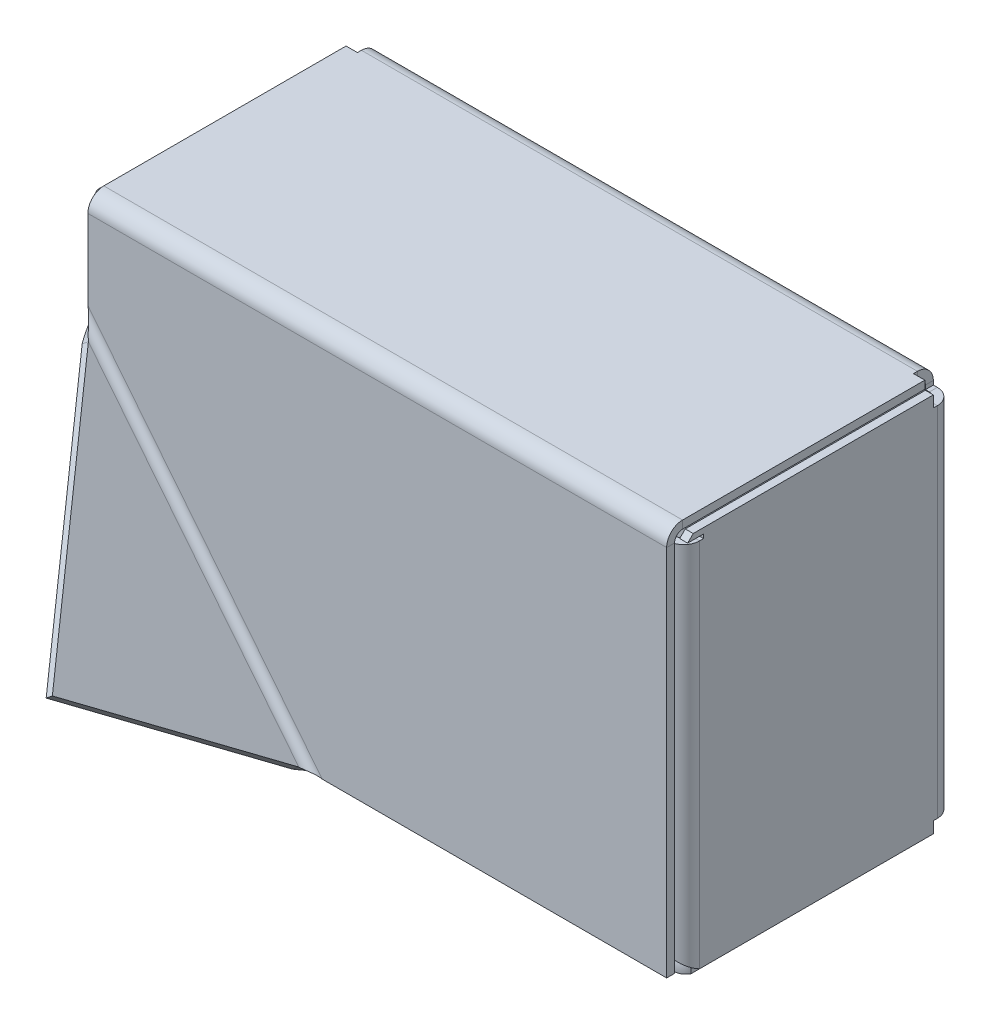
ISO-10303-21;
HEADER;
FILE_DESCRIPTION(('STEP AP214'),'2;1');
FILE_NAME('part.step','',(''),(''),'','','');
FILE_SCHEMA(('AUTOMOTIVE_DESIGN { 1 0 10303 214 1 1 1 1 }'));
ENDSEC;
DATA;
#1=APPLICATION_CONTEXT('core data for automotive mechanical design processes');
#2=APPLICATION_PROTOCOL_DEFINITION('international standard','automotive_design',2000,#1);
#3=PRODUCT_CONTEXT('',#1,'mechanical');
#4=PRODUCT('Part','Part','',(#3));
#5=PRODUCT_RELATED_PRODUCT_CATEGORY('part','',(#4));
#6=PRODUCT_DEFINITION_FORMATION('','',#4);
#7=PRODUCT_DEFINITION_CONTEXT('part definition',#1,'design');
#8=PRODUCT_DEFINITION('design','',#6,#7);
#9=PRODUCT_DEFINITION_SHAPE('','',#8);
#10=(LENGTH_UNIT() NAMED_UNIT(*) SI_UNIT(.MILLI.,.METRE.));
#11=(NAMED_UNIT(*) PLANE_ANGLE_UNIT() SI_UNIT($,.RADIAN.));
#12=(NAMED_UNIT(*) SI_UNIT($,.STERADIAN.) SOLID_ANGLE_UNIT());
#13=UNCERTAINTY_MEASURE_WITH_UNIT(LENGTH_MEASURE(1.E-05),#10,'distance_accuracy_value','');
#14=(GEOMETRIC_REPRESENTATION_CONTEXT(3) GLOBAL_UNCERTAINTY_ASSIGNED_CONTEXT((#13)) GLOBAL_UNIT_ASSIGNED_CONTEXT((#10,
#11,#12)) REPRESENTATION_CONTEXT('',''));
#15=CARTESIAN_POINT('',(0.,0.,0.));
#16=DIRECTION('',(0.,0.,1.));
#17=DIRECTION('',(1.,0.,0.));
#18=AXIS2_PLACEMENT_3D('',#15,#16,#17);
#19=CARTESIAN_POINT('',(-77.5638616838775,-23.9292893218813,35.));
#20=DIRECTION('',(0.,1.,0.));
#21=DIRECTION('',(0.,0.,-1.));
#22=AXIS2_PLACEMENT_3D('',#19,#20,#21);
#23=PLANE('',#22);
#24=DIRECTION('',(1.,0.,0.));
#25=VECTOR('',#24,1.);
#26=CARTESIAN_POINT('',(36.5,-23.9292893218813,31.9292893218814));
#27=LINE('',#26,#25);
#28=CARTESIAN_POINT('',(36.5,-23.9292893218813,31.9292893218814));
#29=VERTEX_POINT('',#28);
#30=CARTESIAN_POINT('',(37.5,-23.9292893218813,31.9292893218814));
#31=VERTEX_POINT('',#30);
#32=EDGE_CURVE('E622',#29,#31,#27,.T.);
#33=ORIENTED_EDGE('',*,*,#32,.F.);
#34=DIRECTION('',(0.,0.,1.));
#35=VECTOR('',#34,1.);
#36=CARTESIAN_POINT('',(36.5,-23.9292893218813,35.));
#37=LINE('',#36,#35);
#38=CARTESIAN_POINT('',(36.5,-23.9292893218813,2.5));
#39=VERTEX_POINT('',#38);
#40=EDGE_CURVE('E1267',#39,#29,#37,.T.);
#41=ORIENTED_EDGE('',*,*,#40,.F.);
#42=DIRECTION('',(1.,0.,0.));
#43=VECTOR('',#42,1.);
#44=CARTESIAN_POINT('',(-77.5638616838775,-23.9292893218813,2.5));
#45=LINE('',#44,#43);
#46=CARTESIAN_POINT('',(37.5,-23.9292893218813,2.5));
#47=VERTEX_POINT('',#46);
#48=EDGE_CURVE('E1309',#39,#47,#45,.T.);
#49=ORIENTED_EDGE('',*,*,#48,.T.);
#50=DIRECTION('',(0.,0.,1.));
#51=VECTOR('',#50,1.);
#52=CARTESIAN_POINT('',(37.5,-23.9292893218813,35.));
#53=LINE('',#52,#51);
#54=EDGE_CURVE('E1306',#47,#31,#53,.T.);
#55=ORIENTED_EDGE('',*,*,#54,.T.);
#56=EDGE_LOOP('',(#33,#41,#49,#55));
#57=FACE_BOUND('',#56,.T.);
#58=ADVANCED_FACE('F114',(#57),#23,.F.);
#59=CARTESIAN_POINT('',(37.5,-25.,35.));
#60=DIRECTION('',(-1.,0.,0.));
#61=DIRECTION('',(0.,0.,1.));
#62=AXIS2_PLACEMENT_3D('',#59,#60,#61);
#63=PLANE('',#62);
#64=DIRECTION('',(0.,0.,1.));
#65=VECTOR('',#64,1.);
#66=CARTESIAN_POINT('',(37.5,23.2292893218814,34.9999999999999));
#67=LINE('',#66,#65);
#68=CARTESIAN_POINT('',(37.5,23.2292893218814,31.4292893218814));
#69=VERTEX_POINT('',#68);
#70=CARTESIAN_POINT('',(37.5,23.2292893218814,33.4292893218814));
#71=VERTEX_POINT('',#70);
#72=EDGE_CURVE('E129',#69,#71,#67,.T.);
#73=ORIENTED_EDGE('',*,*,#72,.F.);
#74=DIRECTION('',(0.,1.,0.));
#75=VECTOR('',#74,1.);
#76=CARTESIAN_POINT('',(37.5,-25.,31.4292893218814));
#77=LINE('',#76,#75);
#78=CARTESIAN_POINT('',(37.5,22.7292893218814,31.4292893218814));
#79=VERTEX_POINT('',#78);
#80=EDGE_CURVE('E897',#79,#69,#77,.T.);
#81=ORIENTED_EDGE('',*,*,#80,.F.);
#82=DIRECTION('',(0.,0.,-1.));
#83=VECTOR('',#82,1.);
#84=CARTESIAN_POINT('',(37.5,22.7292893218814,35.));
#85=LINE('',#84,#83);
#86=CARTESIAN_POINT('',(37.5,22.7292893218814,31.9292893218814));
#87=VERTEX_POINT('',#86);
#88=EDGE_CURVE('E1488',#87,#79,#85,.T.);
#89=ORIENTED_EDGE('',*,*,#88,.F.);
#90=DIRECTION('',(0.,1.,0.));
#91=VECTOR('',#90,1.);
#92=CARTESIAN_POINT('',(37.5,22.7292893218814,31.9292893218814));
#93=LINE('',#92,#91);
#94=EDGE_CURVE('E609',#87,#31,#93,.F.);
#95=ORIENTED_EDGE('',*,*,#94,.T.);
#96=ORIENTED_EDGE('',*,*,#54,.F.);
#97=DIRECTION('',(0.,1.,0.));
#98=VECTOR('',#97,1.);
#99=CARTESIAN_POINT('',(37.5,-25.,2.5));
#100=LINE('',#99,#98);
#101=CARTESIAN_POINT('',(37.5,-22.5,2.5));
#102=VERTEX_POINT('',#101);
#103=EDGE_CURVE('E1279',#47,#102,#100,.T.);
#104=ORIENTED_EDGE('',*,*,#103,.T.);
#105=DIRECTION('',(0.,0.,1.));
#106=VECTOR('',#105,1.);
#107=CARTESIAN_POINT('',(37.5,-22.5,35.));
#108=LINE('',#107,#106);
#109=CARTESIAN_POINT('',(37.5,-22.5,2.));
#110=VERTEX_POINT('',#109);
#111=EDGE_CURVE('E1287',#110,#102,#108,.T.);
#112=ORIENTED_EDGE('',*,*,#111,.F.);
#113=DIRECTION('',(0.,1.,0.));
#114=VECTOR('',#113,1.);
#115=CARTESIAN_POINT('',(37.5,-22.5,2.));
#116=LINE('',#115,#114);
#117=CARTESIAN_POINT('',(37.5,22.5,2.));
#118=VERTEX_POINT('',#117);
#119=EDGE_CURVE('E1284',#110,#118,#116,.T.);
#120=ORIENTED_EDGE('',*,*,#119,.T.);
#121=DIRECTION('',(0.,0.,-1.));
#122=VECTOR('',#121,1.);
#123=CARTESIAN_POINT('',(37.5,22.5,35.));
#124=LINE('',#123,#122);
#125=CARTESIAN_POINT('',(37.5,22.5,2.5));
#126=VERTEX_POINT('',#125);
#127=EDGE_CURVE('E1273',#126,#118,#124,.T.);
#128=ORIENTED_EDGE('',*,*,#127,.F.);
#129=DIRECTION('',(0.,1.,0.));
#130=VECTOR('',#129,1.);
#131=CARTESIAN_POINT('',(37.5,-25.,2.5));
#132=LINE('',#131,#130);
#133=CARTESIAN_POINT('',(37.5,23.9292893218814,2.5));
#134=VERTEX_POINT('',#133);
#135=EDGE_CURVE('E1281',#126,#134,#132,.T.);
#136=ORIENTED_EDGE('',*,*,#135,.T.);
#137=DIRECTION('',(0.,0.,-1.));
#138=VECTOR('',#137,1.);
#139=CARTESIAN_POINT('',(37.5,23.9292893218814,52.5));
#140=LINE('',#139,#138);
#141=CARTESIAN_POINT('',(37.5,23.9292893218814,32.7292893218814));
#142=VERTEX_POINT('',#141);
#143=EDGE_CURVE('E1304',#142,#134,#140,.T.);
#144=ORIENTED_EDGE('',*,*,#143,.F.);
#145=DIRECTION('',(0.,0.707106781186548,-0.707106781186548));
#146=VECTOR('',#145,1.);
#147=CARTESIAN_POINT('',(37.5,23.9292893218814,32.7292893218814));
#148=LINE('',#147,#146);
#149=EDGE_CURVE('E857',#142,#71,#148,.F.);
#150=ORIENTED_EDGE('',*,*,#149,.T.);
#151=EDGE_LOOP('',(#73,#81,#89,#95,#96,#104,#112,#120,#128,#136,#144,#150));
#152=FACE_BOUND('',#151,.T.);
#153=ADVANCED_FACE('F661',(#152),#63,.F.);
#154=CARTESIAN_POINT('',(36.5,-25.,35.));
#155=DIRECTION('',(-1.,0.,0.));
#156=DIRECTION('',(0.,0.,1.));
#157=AXIS2_PLACEMENT_3D('',#154,#155,#156);
#158=PLANE('',#157);
#159=DIRECTION('',(0.,-1.,0.));
#160=VECTOR('',#159,1.);
#161=CARTESIAN_POINT('',(36.5,23.2292893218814,31.4292893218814));
#162=LINE('',#161,#160);
#163=CARTESIAN_POINT('',(36.5,23.2292893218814,31.4292893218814));
#164=VERTEX_POINT('',#163);
#165=CARTESIAN_POINT('',(36.5,22.7292893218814,31.4292893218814));
#166=VERTEX_POINT('',#165);
#167=EDGE_CURVE('E1494',#164,#166,#162,.T.);
#168=ORIENTED_EDGE('',*,*,#167,.F.);
#169=DIRECTION('',(0.,0.,-1.));
#170=VECTOR('',#169,1.);
#171=CARTESIAN_POINT('',(36.5,23.2292893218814,33.4292893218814));
#172=LINE('',#171,#170);
#173=CARTESIAN_POINT('',(36.5,23.2292893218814,33.4292893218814));
#174=VERTEX_POINT('',#173);
#175=EDGE_CURVE('E1447',#174,#164,#172,.T.);
#176=ORIENTED_EDGE('',*,*,#175,.F.);
#177=DIRECTION('',(0.,-0.707106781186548,0.707106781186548));
#178=VECTOR('',#177,1.);
#179=CARTESIAN_POINT('',(36.5,-1.67071067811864,58.3292893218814));
#180=LINE('',#179,#178);
#181=CARTESIAN_POINT('',(36.5,23.9292893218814,32.7292893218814));
#182=VERTEX_POINT('',#181);
#183=EDGE_CURVE('E861',#174,#182,#180,.F.);
#184=ORIENTED_EDGE('',*,*,#183,.T.);
#185=DIRECTION('',(0.,0.,-1.));
#186=VECTOR('',#185,1.);
#187=CARTESIAN_POINT('',(36.5,23.9292893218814,35.));
#188=LINE('',#187,#186);
#189=CARTESIAN_POINT('',(36.5,23.9292893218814,2.5));
#190=VERTEX_POINT('',#189);
#191=EDGE_CURVE('E1265',#182,#190,#188,.T.);
#192=ORIENTED_EDGE('',*,*,#191,.T.);
#193=DIRECTION('',(0.,1.,0.));
#194=VECTOR('',#193,1.);
#195=CARTESIAN_POINT('',(36.5,-25.,2.5));
#196=LINE('',#195,#194);
#197=CARTESIAN_POINT('',(36.5,22.5,2.5));
#198=VERTEX_POINT('',#197);
#199=EDGE_CURVE('E1301',#198,#190,#196,.T.);
#200=ORIENTED_EDGE('',*,*,#199,.F.);
#201=DIRECTION('',(0.,0.,-1.));
#202=VECTOR('',#201,1.);
#203=CARTESIAN_POINT('',(36.5,22.5,35.));
#204=LINE('',#203,#202);
#205=CARTESIAN_POINT('',(36.5,22.5,1.99999999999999));
#206=VERTEX_POINT('',#205);
#207=EDGE_CURVE('E1261',#198,#206,#204,.T.);
#208=ORIENTED_EDGE('',*,*,#207,.T.);
#209=DIRECTION('',(0.,1.,0.));
#210=VECTOR('',#209,1.);
#211=CARTESIAN_POINT('',(36.5,-22.5,2.));
#212=LINE('',#211,#210);
#213=CARTESIAN_POINT('',(36.5,-22.5,2.));
#214=VERTEX_POINT('',#213);
#215=EDGE_CURVE('E1244',#214,#206,#212,.T.);
#216=ORIENTED_EDGE('',*,*,#215,.F.);
#217=DIRECTION('',(0.,0.,1.));
#218=VECTOR('',#217,1.);
#219=CARTESIAN_POINT('',(36.5,-22.5,35.));
#220=LINE('',#219,#218);
#221=CARTESIAN_POINT('',(36.5,-22.5,2.5));
#222=VERTEX_POINT('',#221);
#223=EDGE_CURVE('E1270',#214,#222,#220,.T.);
#224=ORIENTED_EDGE('',*,*,#223,.T.);
#225=DIRECTION('',(0.,1.,0.));
#226=VECTOR('',#225,1.);
#227=CARTESIAN_POINT('',(36.5,-25.,2.5));
#228=LINE('',#227,#226);
#229=EDGE_CURVE('E1296',#39,#222,#228,.T.);
#230=ORIENTED_EDGE('',*,*,#229,.F.);
#231=ORIENTED_EDGE('',*,*,#40,.T.);
#232=DIRECTION('',(0.,1.,0.));
#233=VECTOR('',#232,1.);
#234=CARTESIAN_POINT('',(36.5,22.7292893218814,31.9292893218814));
#235=LINE('',#234,#233);
#236=CARTESIAN_POINT('',(36.5,22.7292893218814,31.9292893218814));
#237=VERTEX_POINT('',#236);
#238=EDGE_CURVE('E614',#237,#29,#235,.F.);
#239=ORIENTED_EDGE('',*,*,#238,.F.);
#240=DIRECTION('',(0.,0.,1.));
#241=VECTOR('',#240,1.);
#242=CARTESIAN_POINT('',(36.5,22.7292893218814,31.4292893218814));
#243=LINE('',#242,#241);
#244=EDGE_CURVE('E1484',#166,#237,#243,.T.);
#245=ORIENTED_EDGE('',*,*,#244,.F.);
#246=EDGE_LOOP('',(#168,#176,#184,#192,#200,#208,#216,#224,#230,#231,#239,#245));
#247=FACE_BOUND('',#246,.T.);
#248=ADVANCED_FACE('F667',(#247),#158,.T.);
#249=CARTESIAN_POINT('',(-77.5638616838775,23.9292893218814,32.7292893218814));
#250=DIRECTION('',(0.,-0.707106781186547,-0.707106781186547));
#251=DIRECTION('',(1.,0.,0.));
#252=AXIS2_PLACEMENT_3D('',#249,#250,#251);
#253=PLANE('',#252);
#254=ORIENTED_EDGE('',*,*,#183,.F.);
#255=DIRECTION('',(1.,0.,0.));
#256=VECTOR('',#255,1.);
#257=CARTESIAN_POINT('',(36.5,23.2292893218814,33.4292893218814));
#258=LINE('',#257,#256);
#259=EDGE_CURVE('E1441',#174,#71,#258,.T.);
#260=ORIENTED_EDGE('',*,*,#259,.T.);
#261=ORIENTED_EDGE('',*,*,#149,.F.);
#262=DIRECTION('',(1.,0.,0.));
#263=VECTOR('',#262,1.);
#264=CARTESIAN_POINT('',(-77.5638616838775,23.9292893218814,32.7292893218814));
#265=LINE('',#264,#263);
#266=EDGE_CURVE('E849',#182,#142,#265,.T.);
#267=ORIENTED_EDGE('',*,*,#266,.F.);
#268=EDGE_LOOP('',(#254,#260,#261,#267));
#269=FACE_BOUND('',#268,.T.);
#270=ADVANCED_FACE('F698',(#269),#253,.F.);
#271=CARTESIAN_POINT('',(-36.4292893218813,134.09559388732,35.));
#272=DIRECTION('',(1.,0.,0.));
#273=DIRECTION('',(0.,0.,-1.));
#274=AXIS2_PLACEMENT_3D('',#271,#272,#273);
#275=PLANE('',#274);
#276=DIRECTION('',(0.,-1.,0.));
#277=VECTOR('',#276,1.);
#278=CARTESIAN_POINT('',(-36.4292893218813,-24.,31.9292893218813));
#279=LINE('',#278,#277);
#280=CARTESIAN_POINT('',(-36.4292893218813,-24.,31.9292893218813));
#281=VERTEX_POINT('',#280);
#282=CARTESIAN_POINT('',(-36.4292893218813,-25.,31.9292893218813));
#283=VERTEX_POINT('',#282);
#284=EDGE_CURVE('E2731',#281,#283,#279,.T.);
#285=ORIENTED_EDGE('',*,*,#284,.F.);
#286=DIRECTION('',(0.,0.,1.));
#287=VECTOR('',#286,1.);
#288=CARTESIAN_POINT('',(-36.4292893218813,-24.,35.));
#289=LINE('',#288,#287);
#290=CARTESIAN_POINT('',(-36.4292893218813,-24.,2.5));
#291=VERTEX_POINT('',#290);
#292=EDGE_CURVE('E1322',#291,#281,#289,.T.);
#293=ORIENTED_EDGE('',*,*,#292,.F.);
#294=DIRECTION('',(0.,-1.,0.));
#295=VECTOR('',#294,1.);
#296=CARTESIAN_POINT('',(-36.4292893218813,134.09559388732,2.5));
#297=LINE('',#296,#295);
#298=CARTESIAN_POINT('',(-36.4292893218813,-25.,2.5));
#299=VERTEX_POINT('',#298);
#300=EDGE_CURVE('E1361',#291,#299,#297,.T.);
#301=ORIENTED_EDGE('',*,*,#300,.T.);
#302=DIRECTION('',(0.,0.,-1.));
#303=VECTOR('',#302,1.);
#304=CARTESIAN_POINT('',(-36.4292893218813,-25.,52.5));
#305=LINE('',#304,#303);
#306=EDGE_CURVE('E1335',#283,#299,#305,.T.);
#307=ORIENTED_EDGE('',*,*,#306,.F.);
#308=EDGE_LOOP('',(#285,#293,#301,#307));
#309=FACE_BOUND('',#308,.T.);
#310=ADVANCED_FACE('F700',(#309),#275,.F.);
#311=CARTESIAN_POINT('',(36.4292893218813,134.09559388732,35.));
#312=DIRECTION('',(-1.,0.,0.));
#313=DIRECTION('',(0.,0.,1.));
#314=AXIS2_PLACEMENT_3D('',#311,#312,#313);
#315=PLANE('',#314);
#316=DIRECTION('',(0.,-1.,0.));
#317=VECTOR('',#316,1.);
#318=CARTESIAN_POINT('',(36.4292893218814,-24.,31.9292893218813));
#319=LINE('',#318,#317);
#320=CARTESIAN_POINT('',(36.4292893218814,-24.,31.9292893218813));
#321=VERTEX_POINT('',#320);
#322=CARTESIAN_POINT('',(36.4292893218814,-25.,31.9292893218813));
#323=VERTEX_POINT('',#322);
#324=EDGE_CURVE('E2726',#321,#323,#319,.T.);
#325=ORIENTED_EDGE('',*,*,#324,.T.);
#326=DIRECTION('',(0.,0.,1.));
#327=VECTOR('',#326,1.);
#328=CARTESIAN_POINT('',(36.4292893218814,-25.,35.));
#329=LINE('',#328,#327);
#330=CARTESIAN_POINT('',(36.4292893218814,-25.,2.5));
#331=VERTEX_POINT('',#330);
#332=EDGE_CURVE('E1337',#331,#323,#329,.T.);
#333=ORIENTED_EDGE('',*,*,#332,.F.);
#334=DIRECTION('',(0.,-1.,0.));
#335=VECTOR('',#334,1.);
#336=CARTESIAN_POINT('',(36.4292893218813,134.09559388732,2.5));
#337=LINE('',#336,#335);
#338=CARTESIAN_POINT('',(36.4292893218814,-24.,2.5));
#339=VERTEX_POINT('',#338);
#340=EDGE_CURVE('E1355',#339,#331,#337,.T.);
#341=ORIENTED_EDGE('',*,*,#340,.F.);
#342=DIRECTION('',(0.,0.,-1.));
#343=VECTOR('',#342,1.);
#344=CARTESIAN_POINT('',(36.4292893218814,-24.,35.));
#345=LINE('',#344,#343);
#346=EDGE_CURVE('E1320',#321,#339,#345,.T.);
#347=ORIENTED_EDGE('',*,*,#346,.F.);
#348=EDGE_LOOP('',(#325,#333,#341,#347));
#349=FACE_BOUND('',#348,.T.);
#350=ADVANCED_FACE('F703',(#349),#315,.F.);
#351=CARTESIAN_POINT('',(37.5,-25.,35.));
#352=DIRECTION('',(0.,1.,0.));
#353=DIRECTION('',(-1.,0.,0.));
#354=AXIS2_PLACEMENT_3D('',#351,#352,#353);
#355=PLANE('',#354);
#356=DIRECTION('',(1.,0.,0.));
#357=VECTOR('',#356,1.);
#358=CARTESIAN_POINT('',(36.4292893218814,-25.,31.9292893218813));
#359=LINE('',#358,#357);
#360=EDGE_CURVE('E2735',#323,#283,#359,.F.);
#361=ORIENTED_EDGE('',*,*,#360,.T.);
#362=ORIENTED_EDGE('',*,*,#306,.T.);
#363=DIRECTION('',(1.,0.,0.));
#364=VECTOR('',#363,1.);
#365=CARTESIAN_POINT('',(37.5,-25.,2.5));
#366=LINE('',#365,#364);
#367=CARTESIAN_POINT('',(-35.,-25.,2.5));
#368=VERTEX_POINT('',#367);
#369=EDGE_CURVE('E1333',#299,#368,#366,.T.);
#370=ORIENTED_EDGE('',*,*,#369,.T.);
#371=DIRECTION('',(0.,0.,1.));
#372=VECTOR('',#371,1.);
#373=CARTESIAN_POINT('',(-35.,-25.,35.));
#374=LINE('',#373,#372);
#375=CARTESIAN_POINT('',(-35.,-25.,2.));
#376=VERTEX_POINT('',#375);
#377=EDGE_CURVE('E1344',#376,#368,#374,.T.);
#378=ORIENTED_EDGE('',*,*,#377,.F.);
#379=DIRECTION('',(1.,0.,0.));
#380=VECTOR('',#379,1.);
#381=CARTESIAN_POINT('',(-35.,-25.,2.));
#382=LINE('',#381,#380);
#383=CARTESIAN_POINT('',(35.,-25.,2.));
#384=VERTEX_POINT('',#383);
#385=EDGE_CURVE('E1341',#376,#384,#382,.T.);
#386=ORIENTED_EDGE('',*,*,#385,.T.);
#387=DIRECTION('',(0.,0.,-1.));
#388=VECTOR('',#387,1.);
#389=CARTESIAN_POINT('',(35.,-25.,35.));
#390=LINE('',#389,#388);
#391=CARTESIAN_POINT('',(35.,-25.,2.5));
#392=VERTEX_POINT('',#391);
#393=EDGE_CURVE('E1327',#392,#384,#390,.T.);
#394=ORIENTED_EDGE('',*,*,#393,.F.);
#395=DIRECTION('',(1.,0.,0.));
#396=VECTOR('',#395,1.);
#397=CARTESIAN_POINT('',(37.5,-25.,2.5));
#398=LINE('',#397,#396);
#399=EDGE_CURVE('E1339',#392,#331,#398,.T.);
#400=ORIENTED_EDGE('',*,*,#399,.T.);
#401=ORIENTED_EDGE('',*,*,#332,.T.);
#402=EDGE_LOOP('',(#361,#362,#370,#378,#386,#394,#400,#401));
#403=FACE_BOUND('',#402,.T.);
#404=ADVANCED_FACE('F707',(#403),#355,.F.);
#405=CARTESIAN_POINT('',(37.5,-24.,35.));
#406=DIRECTION('',(0.,1.,0.));
#407=DIRECTION('',(-1.,0.,0.));
#408=AXIS2_PLACEMENT_3D('',#405,#406,#407);
#409=PLANE('',#408);
#410=ORIENTED_EDGE('',*,*,#292,.T.);
#411=DIRECTION('',(1.,0.,0.));
#412=VECTOR('',#411,1.);
#413=CARTESIAN_POINT('',(36.4292893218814,-24.,31.9292893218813));
#414=LINE('',#413,#412);
#415=EDGE_CURVE('E137',#321,#281,#414,.F.);
#416=ORIENTED_EDGE('',*,*,#415,.F.);
#417=ORIENTED_EDGE('',*,*,#346,.T.);
#418=DIRECTION('',(1.,0.,0.));
#419=VECTOR('',#418,1.);
#420=CARTESIAN_POINT('',(37.5,-24.,2.5));
#421=LINE('',#420,#419);
#422=CARTESIAN_POINT('',(35.,-24.,2.5));
#423=VERTEX_POINT('',#422);
#424=EDGE_CURVE('E1358',#423,#339,#421,.T.);
#425=ORIENTED_EDGE('',*,*,#424,.F.);
#426=DIRECTION('',(0.,0.,-1.));
#427=VECTOR('',#426,1.);
#428=CARTESIAN_POINT('',(35.,-24.,35.));
#429=LINE('',#428,#427);
#430=CARTESIAN_POINT('',(35.,-24.,1.99999999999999));
#431=VERTEX_POINT('',#430);
#432=EDGE_CURVE('E1316',#423,#431,#429,.T.);
#433=ORIENTED_EDGE('',*,*,#432,.T.);
#434=DIRECTION('',(1.,0.,0.));
#435=VECTOR('',#434,1.);
#436=CARTESIAN_POINT('',(-35.,-24.,2.));
#437=LINE('',#436,#435);
#438=CARTESIAN_POINT('',(-35.,-24.,2.));
#439=VERTEX_POINT('',#438);
#440=EDGE_CURVE('E1264',#439,#431,#437,.T.);
#441=ORIENTED_EDGE('',*,*,#440,.F.);
#442=DIRECTION('',(0.,0.,1.));
#443=VECTOR('',#442,1.);
#444=CARTESIAN_POINT('',(-35.,-24.,35.));
#445=LINE('',#444,#443);
#446=CARTESIAN_POINT('',(-35.,-24.,2.5));
#447=VERTEX_POINT('',#446);
#448=EDGE_CURVE('E1324',#439,#447,#445,.T.);
#449=ORIENTED_EDGE('',*,*,#448,.T.);
#450=DIRECTION('',(1.,0.,0.));
#451=VECTOR('',#450,1.);
#452=CARTESIAN_POINT('',(37.5,-24.,2.5));
#453=LINE('',#452,#451);
#454=EDGE_CURVE('E1353',#291,#447,#453,.T.);
#455=ORIENTED_EDGE('',*,*,#454,.F.);
#456=EDGE_LOOP('',(#410,#416,#417,#425,#433,#441,#449,#455));
#457=FACE_BOUND('',#456,.T.);
#458=ADVANCED_FACE('F724',(#457),#409,.T.);
#459=CARTESIAN_POINT('',(77.5638616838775,-23.9292893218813,35.));
#460=DIRECTION('',(0.,1.,0.));
#461=DIRECTION('',(1.,0.,0.));
#462=AXIS2_PLACEMENT_3D('',#459,#460,#461);
#463=PLANE('',#462);
#464=DIRECTION('',(-1.,0.,0.));
#465=VECTOR('',#464,1.);
#466=CARTESIAN_POINT('',(-36.5,-23.9292893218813,31.9292893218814));
#467=LINE('',#466,#465);
#468=CARTESIAN_POINT('',(-36.5,-23.9292893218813,31.9292893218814));
#469=VERTEX_POINT('',#468);
#470=CARTESIAN_POINT('',(-37.5,-23.9292893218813,31.9292893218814));
#471=VERTEX_POINT('',#470);
#472=EDGE_CURVE('E1546',#469,#471,#467,.T.);
#473=ORIENTED_EDGE('',*,*,#472,.T.);
#474=DIRECTION('',(0.,0.,-1.));
#475=VECTOR('',#474,1.);
#476=CARTESIAN_POINT('',(-37.5,-23.9292893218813,52.5));
#477=LINE('',#476,#475);
#478=CARTESIAN_POINT('',(-37.5,-23.9292893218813,2.5));
#479=VERTEX_POINT('',#478);
#480=EDGE_CURVE('E1404',#471,#479,#477,.T.);
#481=ORIENTED_EDGE('',*,*,#480,.T.);
#482=DIRECTION('',(-1.,0.,0.));
#483=VECTOR('',#482,1.);
#484=CARTESIAN_POINT('',(77.5638616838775,-23.9292893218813,2.5));
#485=LINE('',#484,#483);
#486=CARTESIAN_POINT('',(-36.5,-23.9292893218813,2.5));
#487=VERTEX_POINT('',#486);
#488=EDGE_CURVE('E1398',#487,#479,#485,.T.);
#489=ORIENTED_EDGE('',*,*,#488,.F.);
#490=DIRECTION('',(0.,0.,-1.));
#491=VECTOR('',#490,1.);
#492=CARTESIAN_POINT('',(-36.5,-23.9292893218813,35.));
#493=LINE('',#492,#491);
#494=EDGE_CURVE('E879',#469,#487,#493,.T.);
#495=ORIENTED_EDGE('',*,*,#494,.F.);
#496=EDGE_LOOP('',(#473,#481,#489,#495));
#497=FACE_BOUND('',#496,.T.);
#498=ADVANCED_FACE('F731',(#497),#463,.F.);
#499=CARTESIAN_POINT('',(-37.5,-25.,35.));
#500=DIRECTION('',(1.,0.,0.));
#501=DIRECTION('',(0.,0.,-1.));
#502=AXIS2_PLACEMENT_3D('',#499,#500,#501);
#503=PLANE('',#502);
#504=DIRECTION('',(0.,-1.,0.));
#505=VECTOR('',#504,1.);
#506=CARTESIAN_POINT('',(-37.5,-23.9292893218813,31.9292893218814));
#507=LINE('',#506,#505);
#508=CARTESIAN_POINT('',(-37.5,22.7292893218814,31.9292893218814));
#509=VERTEX_POINT('',#508);
#510=EDGE_CURVE('E1538',#471,#509,#507,.F.);
#511=ORIENTED_EDGE('',*,*,#510,.T.);
#512=DIRECTION('',(0.,0.,1.));
#513=VECTOR('',#512,1.);
#514=CARTESIAN_POINT('',(-37.5,22.7292893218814,35.));
#515=LINE('',#514,#513);
#516=CARTESIAN_POINT('',(-37.5,22.7292893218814,31.4292893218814));
#517=VERTEX_POINT('',#516);
#518=EDGE_CURVE('E904',#517,#509,#515,.T.);
#519=ORIENTED_EDGE('',*,*,#518,.F.);
#520=DIRECTION('',(0.,-1.,0.));
#521=VECTOR('',#520,1.);
#522=CARTESIAN_POINT('',(-37.5,-25.,31.4292893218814));
#523=LINE('',#522,#521);
#524=CARTESIAN_POINT('',(-37.5,23.2292893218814,31.4292893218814));
#525=VERTEX_POINT('',#524);
#526=EDGE_CURVE('E901',#525,#517,#523,.T.);
#527=ORIENTED_EDGE('',*,*,#526,.F.);
#528=DIRECTION('',(0.,0.,-1.));
#529=VECTOR('',#528,1.);
#530=CARTESIAN_POINT('',(-37.5,23.2292893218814,35.));
#531=LINE('',#530,#529);
#532=CARTESIAN_POINT('',(-37.5,23.2292893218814,33.4292893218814));
#533=VERTEX_POINT('',#532);
#534=EDGE_CURVE('E899',#533,#525,#531,.T.);
#535=ORIENTED_EDGE('',*,*,#534,.F.);
#536=DIRECTION('',(0.,-0.707106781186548,0.707106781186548));
#537=VECTOR('',#536,1.);
#538=CARTESIAN_POINT('',(-37.5,22.7292893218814,33.9292893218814));
#539=LINE('',#538,#537);
#540=CARTESIAN_POINT('',(-37.5,23.9292893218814,32.7292893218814));
#541=VERTEX_POINT('',#540);
#542=EDGE_CURVE('E863',#533,#541,#539,.F.);
#543=ORIENTED_EDGE('',*,*,#542,.T.);
#544=DIRECTION('',(0.,0.,1.));
#545=VECTOR('',#544,1.);
#546=CARTESIAN_POINT('',(-37.5,23.9292893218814,35.));
#547=LINE('',#546,#545);
#548=CARTESIAN_POINT('',(-37.5,23.9292893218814,2.5));
#549=VERTEX_POINT('',#548);
#550=EDGE_CURVE('E870',#549,#541,#547,.T.);
#551=ORIENTED_EDGE('',*,*,#550,.F.);
#552=DIRECTION('',(0.,-1.,0.));
#553=VECTOR('',#552,1.);
#554=CARTESIAN_POINT('',(-37.5,-25.,2.5));
#555=LINE('',#554,#553);
#556=CARTESIAN_POINT('',(-37.5,22.5,2.5));
#557=VERTEX_POINT('',#556);
#558=EDGE_CURVE('E1380',#549,#557,#555,.T.);
#559=ORIENTED_EDGE('',*,*,#558,.T.);
#560=DIRECTION('',(0.,0.,1.));
#561=VECTOR('',#560,1.);
#562=CARTESIAN_POINT('',(-37.5,22.5,35.));
#563=LINE('',#562,#561);
#564=CARTESIAN_POINT('',(-37.5,22.5,2.));
#565=VERTEX_POINT('',#564);
#566=EDGE_CURVE('E1388',#565,#557,#563,.T.);
#567=ORIENTED_EDGE('',*,*,#566,.F.);
#568=DIRECTION('',(0.,-1.,0.));
#569=VECTOR('',#568,1.);
#570=CARTESIAN_POINT('',(-37.5,22.5,2.));
#571=LINE('',#570,#569);
#572=CARTESIAN_POINT('',(-37.5,-22.5,2.));
#573=VERTEX_POINT('',#572);
#574=EDGE_CURVE('E1385',#565,#573,#571,.T.);
#575=ORIENTED_EDGE('',*,*,#574,.T.);
#576=DIRECTION('',(0.,0.,-1.));
#577=VECTOR('',#576,1.);
#578=CARTESIAN_POINT('',(-37.5,-22.5,35.));
#579=LINE('',#578,#577);
#580=CARTESIAN_POINT('',(-37.5,-22.5,2.5));
#581=VERTEX_POINT('',#580);
#582=EDGE_CURVE('E1374',#581,#573,#579,.T.);
#583=ORIENTED_EDGE('',*,*,#582,.F.);
#584=DIRECTION('',(0.,-1.,0.));
#585=VECTOR('',#584,1.);
#586=CARTESIAN_POINT('',(-37.5,-25.,2.5));
#587=LINE('',#586,#585);
#588=EDGE_CURVE('E1382',#581,#479,#587,.T.);
#589=ORIENTED_EDGE('',*,*,#588,.T.);
#590=ORIENTED_EDGE('',*,*,#480,.F.);
#591=EDGE_LOOP('',(#511,#519,#527,#535,#543,#551,#559,#567,#575,#583,#589,#590));
#592=FACE_BOUND('',#591,.T.);
#593=ADVANCED_FACE('F740',(#592),#503,.F.);
#594=CARTESIAN_POINT('',(-36.5,-25.,35.));
#595=DIRECTION('',(1.,0.,0.));
#596=DIRECTION('',(0.,0.,-1.));
#597=AXIS2_PLACEMENT_3D('',#594,#595,#596);
#598=PLANE('',#597);
#599=DIRECTION('',(0.,0.,-1.));
#600=VECTOR('',#599,1.);
#601=CARTESIAN_POINT('',(-36.5,22.7292893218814,31.9292893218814));
#602=LINE('',#601,#600);
#603=CARTESIAN_POINT('',(-36.5,22.7292893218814,31.9292893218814));
#604=VERTEX_POINT('',#603);
#605=CARTESIAN_POINT('',(-36.5,22.7292893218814,31.4292893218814));
#606=VERTEX_POINT('',#605);
#607=EDGE_CURVE('E902',#604,#606,#602,.T.);
#608=ORIENTED_EDGE('',*,*,#607,.F.);
#609=DIRECTION('',(0.,-1.,0.));
#610=VECTOR('',#609,1.);
#611=CARTESIAN_POINT('',(-36.5,-23.9292893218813,31.9292893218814));
#612=LINE('',#611,#610);
#613=EDGE_CURVE('E1517',#469,#604,#612,.F.);
#614=ORIENTED_EDGE('',*,*,#613,.F.);
#615=ORIENTED_EDGE('',*,*,#494,.T.);
#616=DIRECTION('',(0.,-1.,0.));
#617=VECTOR('',#616,1.);
#618=CARTESIAN_POINT('',(-36.5,-25.,2.5));
#619=LINE('',#618,#617);
#620=CARTESIAN_POINT('',(-36.5,-22.5,2.5));
#621=VERTEX_POINT('',#620);
#622=EDGE_CURVE('E1401',#621,#487,#619,.T.);
#623=ORIENTED_EDGE('',*,*,#622,.F.);
#624=DIRECTION('',(0.,0.,-1.));
#625=VECTOR('',#624,1.);
#626=CARTESIAN_POINT('',(-36.5,-22.5,35.));
#627=LINE('',#626,#625);
#628=CARTESIAN_POINT('',(-36.5,-22.5,2.));
#629=VERTEX_POINT('',#628);
#630=EDGE_CURVE('E1368',#621,#629,#627,.T.);
#631=ORIENTED_EDGE('',*,*,#630,.T.);
#632=DIRECTION('',(0.,-1.,0.));
#633=VECTOR('',#632,1.);
#634=CARTESIAN_POINT('',(-36.5,22.5,2.));
#635=LINE('',#634,#633);
#636=CARTESIAN_POINT('',(-36.5,22.5,2.));
#637=VERTEX_POINT('',#636);
#638=EDGE_CURVE('E1319',#637,#629,#635,.T.);
#639=ORIENTED_EDGE('',*,*,#638,.F.);
#640=DIRECTION('',(0.,0.,1.));
#641=VECTOR('',#640,1.);
#642=CARTESIAN_POINT('',(-36.5,22.5,35.));
#643=LINE('',#642,#641);
#644=CARTESIAN_POINT('',(-36.5,22.5,2.5));
#645=VERTEX_POINT('',#644);
#646=EDGE_CURVE('E880',#637,#645,#643,.T.);
#647=ORIENTED_EDGE('',*,*,#646,.T.);
#648=DIRECTION('',(0.,-1.,0.));
#649=VECTOR('',#648,1.);
#650=CARTESIAN_POINT('',(-36.5,-25.,2.5));
#651=LINE('',#650,#649);
#652=CARTESIAN_POINT('',(-36.5,23.9292893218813,2.5));
#653=VERTEX_POINT('',#652);
#654=EDGE_CURVE('E878',#653,#645,#651,.T.);
#655=ORIENTED_EDGE('',*,*,#654,.F.);
#656=DIRECTION('',(0.,0.,1.));
#657=VECTOR('',#656,1.);
#658=CARTESIAN_POINT('',(-36.5,23.9292893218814,35.));
#659=LINE('',#658,#657);
#660=CARTESIAN_POINT('',(-36.5,23.9292893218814,32.7292893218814));
#661=VERTEX_POINT('',#660);
#662=EDGE_CURVE('E868',#653,#661,#659,.T.);
#663=ORIENTED_EDGE('',*,*,#662,.T.);
#664=DIRECTION('',(0.,0.707106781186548,-0.707106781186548));
#665=VECTOR('',#664,1.);
#666=CARTESIAN_POINT('',(-36.5,-1.67071067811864,58.3292893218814));
#667=LINE('',#666,#665);
#668=CARTESIAN_POINT('',(-36.5,23.2292893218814,33.4292893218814));
#669=VERTEX_POINT('',#668);
#670=EDGE_CURVE('E13',#661,#669,#667,.F.);
#671=ORIENTED_EDGE('',*,*,#670,.T.);
#672=DIRECTION('',(0.,0.,1.));
#673=VECTOR('',#672,1.);
#674=CARTESIAN_POINT('',(-36.5,23.2292893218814,31.4292893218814));
#675=LINE('',#674,#673);
#676=CARTESIAN_POINT('',(-36.5,23.2292893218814,31.4292893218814));
#677=VERTEX_POINT('',#676);
#678=EDGE_CURVE('E887',#677,#669,#675,.T.);
#679=ORIENTED_EDGE('',*,*,#678,.F.);
#680=DIRECTION('',(0.,1.,0.));
#681=VECTOR('',#680,1.);
#682=CARTESIAN_POINT('',(-36.5,22.7292893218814,31.4292893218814));
#683=LINE('',#682,#681);
#684=EDGE_CURVE('E890',#606,#677,#683,.T.);
#685=ORIENTED_EDGE('',*,*,#684,.F.);
#686=EDGE_LOOP('',(#608,#614,#615,#623,#631,#639,#647,#655,#663,#671,#679,#685));
#687=FACE_BOUND('',#686,.T.);
#688=ADVANCED_FACE('F755',(#687),#598,.T.);
#689=CARTESIAN_POINT('',(77.5638616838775,22.7292893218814,33.9292893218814));
#690=DIRECTION('',(0.,-0.707106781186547,-0.707106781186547));
#691=DIRECTION('',(-1.,0.,0.));
#692=AXIS2_PLACEMENT_3D('',#689,#690,#691);
#693=PLANE('',#692);
#694=ORIENTED_EDGE('',*,*,#542,.F.);
#695=DIRECTION('',(-1.,0.,0.));
#696=VECTOR('',#695,1.);
#697=CARTESIAN_POINT('',(-36.5,23.2292893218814,33.4292893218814));
#698=LINE('',#697,#696);
#699=EDGE_CURVE('E883',#669,#533,#698,.T.);
#700=ORIENTED_EDGE('',*,*,#699,.F.);
#701=ORIENTED_EDGE('',*,*,#670,.F.);
#702=DIRECTION('',(1.,0.,0.));
#703=VECTOR('',#702,1.);
#704=CARTESIAN_POINT('',(77.5638616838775,23.9292893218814,32.7292893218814));
#705=LINE('',#704,#703);
#706=EDGE_CURVE('E122',#541,#661,#705,.T.);
#707=ORIENTED_EDGE('',*,*,#706,.F.);
#708=EDGE_LOOP('',(#694,#700,#701,#707));
#709=FACE_BOUND('',#708,.T.);
#710=ADVANCED_FACE('F116',(#709),#693,.F.);
#711=CARTESIAN_POINT('',(0.,0.,34.));
#712=DIRECTION('',(0.,0.,1.));
#713=DIRECTION('',(1.,0.,0.));
#714=AXIS2_PLACEMENT_3D('',#711,#712,#713);
#715=PLANE('',#714);
#716=DIRECTION('',(1.,0.,0.));
#717=VECTOR('',#716,1.);
#718=CARTESIAN_POINT('',(0.,-23.9292893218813,34.));
#719=LINE('',#718,#717);
#720=CARTESIAN_POINT('',(-6.92058871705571,-23.9292893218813,34.));
#721=VERTEX_POINT('',#720);
#722=CARTESIAN_POINT('',(36.4292893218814,-23.9292893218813,34.));
#723=VERTEX_POINT('',#722);
#724=EDGE_CURVE('E1252',#721,#723,#719,.T.);
#725=ORIENTED_EDGE('',*,*,#724,.F.);
#726=DIRECTION('',(-0.624695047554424,0.78086880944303,0.));
#727=VECTOR('',#726,1.);
#728=CARTESIAN_POINT('',(-15.8926952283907,-12.7141561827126,34.));
#729=LINE('',#728,#727);
#730=CARTESIAN_POINT('',(-36.4292893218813,12.9565864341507,34.));
#731=VERTEX_POINT('',#730);
#732=EDGE_CURVE('E1426',#721,#731,#729,.T.);
#733=ORIENTED_EDGE('',*,*,#732,.T.);
#734=DIRECTION('',(0.,1.,0.));
#735=VECTOR('',#734,1.);
#736=CARTESIAN_POINT('',(-36.4292893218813,0.,34.));
#737=LINE('',#736,#735);
#738=CARTESIAN_POINT('',(-36.4292893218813,23.,34.));
#739=VERTEX_POINT('',#738);
#740=EDGE_CURVE('E788',#731,#739,#737,.T.);
#741=ORIENTED_EDGE('',*,*,#740,.T.);
#742=DIRECTION('',(1.,0.,0.));
#743=VECTOR('',#742,1.);
#744=CARTESIAN_POINT('',(36.4292893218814,23.,34.));
#745=LINE('',#744,#743);
#746=CARTESIAN_POINT('',(36.4292893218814,23.,34.));
#747=VERTEX_POINT('',#746);
#748=EDGE_CURVE('E1241',#739,#747,#745,.T.);
#749=ORIENTED_EDGE('',*,*,#748,.T.);
#750=DIRECTION('',(0.,1.,0.));
#751=VECTOR('',#750,1.);
#752=CARTESIAN_POINT('',(36.4292893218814,0.,34.));
#753=LINE('',#752,#751);
#754=EDGE_CURVE('E1245',#723,#747,#753,.T.);
#755=ORIENTED_EDGE('',*,*,#754,.F.);
#756=EDGE_LOOP('',(#725,#733,#741,#749,#755));
#757=FACE_BOUND('',#756,.T.);
#758=ADVANCED_FACE('F736',(#757),#715,.F.);
#759=CARTESIAN_POINT('',(77.5638616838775,23.9292893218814,35.));
#760=DIRECTION('',(0.,-1.,0.));
#761=DIRECTION('',(0.,0.,-1.));
#762=AXIS2_PLACEMENT_3D('',#759,#760,#761);
#763=PLANE('',#762);
#764=ORIENTED_EDGE('',*,*,#550,.T.);
#765=ORIENTED_EDGE('',*,*,#706,.T.);
#766=ORIENTED_EDGE('',*,*,#662,.F.);
#767=DIRECTION('',(-1.,0.,0.));
#768=VECTOR('',#767,1.);
#769=CARTESIAN_POINT('',(77.5638616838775,23.9292893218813,2.5));
#770=LINE('',#769,#768);
#771=EDGE_CURVE('E1407',#653,#549,#770,.T.);
#772=ORIENTED_EDGE('',*,*,#771,.T.);
#773=EDGE_LOOP('',(#764,#765,#766,#772));
#774=FACE_BOUND('',#773,.T.);
#775=ADVANCED_FACE('F732',(#774),#763,.F.);
#776=CARTESIAN_POINT('',(77.5638616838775,-25.,2.5));
#777=DIRECTION('',(0.,0.,-1.));
#778=DIRECTION('',(-1.,0.,0.));
#779=AXIS2_PLACEMENT_3D('',#776,#777,#778);
#780=PLANE('',#779);
#781=ORIENTED_EDGE('',*,*,#588,.F.);
#782=DIRECTION('',(-1.,0.,0.));
#783=VECTOR('',#782,1.);
#784=CARTESIAN_POINT('',(77.5638616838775,-22.5,2.5));
#785=LINE('',#784,#783);
#786=EDGE_CURVE('E1377',#621,#581,#785,.T.);
#787=ORIENTED_EDGE('',*,*,#786,.F.);
#788=ORIENTED_EDGE('',*,*,#622,.T.);
#789=ORIENTED_EDGE('',*,*,#488,.T.);
#790=EDGE_LOOP('',(#781,#787,#788,#789));
#791=FACE_BOUND('',#790,.T.);
#792=ADVANCED_FACE('F735',(#791),#780,.T.);
#793=CARTESIAN_POINT('',(77.5638616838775,-25.,2.5));
#794=DIRECTION('',(0.,0.,-1.));
#795=DIRECTION('',(-1.,0.,0.));
#796=AXIS2_PLACEMENT_3D('',#793,#794,#795);
#797=PLANE('',#796);
#798=ORIENTED_EDGE('',*,*,#558,.F.);
#799=ORIENTED_EDGE('',*,*,#771,.F.);
#800=ORIENTED_EDGE('',*,*,#654,.T.);
#801=DIRECTION('',(-1.,0.,0.));
#802=VECTOR('',#801,1.);
#803=CARTESIAN_POINT('',(77.5638616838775,22.5,2.5));
#804=LINE('',#803,#802);
#805=EDGE_CURVE('E1394',#645,#557,#804,.T.);
#806=ORIENTED_EDGE('',*,*,#805,.T.);
#807=EDGE_LOOP('',(#798,#799,#800,#806));
#808=FACE_BOUND('',#807,.T.);
#809=ADVANCED_FACE('F744',(#808),#797,.T.);
#810=CARTESIAN_POINT('',(77.5638616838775,22.5,35.));
#811=DIRECTION('',(0.,-1.,0.));
#812=DIRECTION('',(-1.,0.,0.));
#813=AXIS2_PLACEMENT_3D('',#810,#811,#812);
#814=PLANE('',#813);
#815=DIRECTION('',(-1.,0.,0.));
#816=VECTOR('',#815,1.);
#817=CARTESIAN_POINT('',(77.5638616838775,22.5,2.));
#818=LINE('',#817,#816);
#819=EDGE_CURVE('E1391',#637,#565,#818,.T.);
#820=ORIENTED_EDGE('',*,*,#819,.T.);
#821=ORIENTED_EDGE('',*,*,#566,.T.);
#822=ORIENTED_EDGE('',*,*,#805,.F.);
#823=ORIENTED_EDGE('',*,*,#646,.F.);
#824=EDGE_LOOP('',(#820,#821,#822,#823));
#825=FACE_BOUND('',#824,.T.);
#826=ADVANCED_FACE('F748',(#825),#814,.F.);
#827=CARTESIAN_POINT('',(77.5638616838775,-22.5,35.));
#828=DIRECTION('',(0.,1.,0.));
#829=DIRECTION('',(1.,0.,0.));
#830=AXIS2_PLACEMENT_3D('',#827,#828,#829);
#831=PLANE('',#830);
#832=ORIENTED_EDGE('',*,*,#786,.T.);
#833=ORIENTED_EDGE('',*,*,#582,.T.);
#834=DIRECTION('',(-1.,0.,0.));
#835=VECTOR('',#834,1.);
#836=CARTESIAN_POINT('',(77.5638616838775,-22.5,2.));
#837=LINE('',#836,#835);
#838=EDGE_CURVE('E1409',#629,#573,#837,.T.);
#839=ORIENTED_EDGE('',*,*,#838,.F.);
#840=ORIENTED_EDGE('',*,*,#630,.F.);
#841=EDGE_LOOP('',(#832,#833,#839,#840));
#842=FACE_BOUND('',#841,.T.);
#843=ADVANCED_FACE('F713',(#842),#831,.F.);
#844=CARTESIAN_POINT('',(37.5,134.09559388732,2.5));
#845=DIRECTION('',(0.,0.,-1.));
#846=DIRECTION('',(-1.,0.,0.));
#847=AXIS2_PLACEMENT_3D('',#844,#845,#846);
#848=PLANE('',#847);
#849=ORIENTED_EDGE('',*,*,#399,.F.);
#850=DIRECTION('',(0.,-1.,0.));
#851=VECTOR('',#850,1.);
#852=CARTESIAN_POINT('',(35.,134.09559388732,2.5));
#853=LINE('',#852,#851);
#854=EDGE_CURVE('E1330',#423,#392,#853,.T.);
#855=ORIENTED_EDGE('',*,*,#854,.F.);
#856=ORIENTED_EDGE('',*,*,#424,.T.);
#857=ORIENTED_EDGE('',*,*,#340,.T.);
#858=EDGE_LOOP('',(#849,#855,#856,#857));
#859=FACE_BOUND('',#858,.T.);
#860=ADVANCED_FACE('F709',(#859),#848,.T.);
#861=CARTESIAN_POINT('',(37.5,134.09559388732,2.5));
#862=DIRECTION('',(0.,0.,-1.));
#863=DIRECTION('',(-1.,0.,0.));
#864=AXIS2_PLACEMENT_3D('',#861,#862,#863);
#865=PLANE('',#864);
#866=ORIENTED_EDGE('',*,*,#369,.F.);
#867=ORIENTED_EDGE('',*,*,#300,.F.);
#868=ORIENTED_EDGE('',*,*,#454,.T.);
#869=DIRECTION('',(0.,-1.,0.));
#870=VECTOR('',#869,1.);
#871=CARTESIAN_POINT('',(-35.,134.09559388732,2.5));
#872=LINE('',#871,#870);
#873=EDGE_CURVE('E1350',#447,#368,#872,.T.);
#874=ORIENTED_EDGE('',*,*,#873,.T.);
#875=EDGE_LOOP('',(#866,#867,#868,#874));
#876=FACE_BOUND('',#875,.T.);
#877=ADVANCED_FACE('F712',(#876),#865,.T.);
#878=CARTESIAN_POINT('',(-35.,134.09559388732,35.));
#879=DIRECTION('',(1.,0.,0.));
#880=DIRECTION('',(0.,0.,-1.));
#881=AXIS2_PLACEMENT_3D('',#878,#879,#880);
#882=PLANE('',#881);
#883=DIRECTION('',(0.,-1.,0.));
#884=VECTOR('',#883,1.);
#885=CARTESIAN_POINT('',(-35.,134.09559388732,2.00000000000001));
#886=LINE('',#885,#884);
#887=EDGE_CURVE('E1347',#439,#376,#886,.T.);
#888=ORIENTED_EDGE('',*,*,#887,.T.);
#889=ORIENTED_EDGE('',*,*,#377,.T.);
#890=ORIENTED_EDGE('',*,*,#873,.F.);
#891=ORIENTED_EDGE('',*,*,#448,.F.);
#892=EDGE_LOOP('',(#888,#889,#890,#891));
#893=FACE_BOUND('',#892,.T.);
#894=ADVANCED_FACE('F717',(#893),#882,.F.);
#895=CARTESIAN_POINT('',(35.,134.09559388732,35.));
#896=DIRECTION('',(-1.,0.,0.));
#897=DIRECTION('',(0.,0.,1.));
#898=AXIS2_PLACEMENT_3D('',#895,#896,#897);
#899=PLANE('',#898);
#900=ORIENTED_EDGE('',*,*,#854,.T.);
#901=ORIENTED_EDGE('',*,*,#393,.T.);
#902=DIRECTION('',(0.,-1.,0.));
#903=VECTOR('',#902,1.);
#904=CARTESIAN_POINT('',(35.,134.09559388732,2.));
#905=LINE('',#904,#903);
#906=EDGE_CURVE('E1364',#431,#384,#905,.T.);
#907=ORIENTED_EDGE('',*,*,#906,.F.);
#908=ORIENTED_EDGE('',*,*,#432,.F.);
#909=EDGE_LOOP('',(#900,#901,#907,#908));
#910=FACE_BOUND('',#909,.T.);
#911=ADVANCED_FACE('F678',(#910),#899,.F.);
#912=CARTESIAN_POINT('',(-77.5638616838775,23.9292893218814,35.));
#913=DIRECTION('',(0.,-1.,0.));
#914=DIRECTION('',(1.,0.,0.));
#915=AXIS2_PLACEMENT_3D('',#912,#913,#914);
#916=PLANE('',#915);
#917=ORIENTED_EDGE('',*,*,#191,.F.);
#918=ORIENTED_EDGE('',*,*,#266,.T.);
#919=ORIENTED_EDGE('',*,*,#143,.T.);
#920=DIRECTION('',(1.,0.,0.));
#921=VECTOR('',#920,1.);
#922=CARTESIAN_POINT('',(-77.5638616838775,23.9292893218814,2.5));
#923=LINE('',#922,#921);
#924=EDGE_CURVE('E1298',#190,#134,#923,.T.);
#925=ORIENTED_EDGE('',*,*,#924,.F.);
#926=EDGE_LOOP('',(#917,#918,#919,#925));
#927=FACE_BOUND('',#926,.T.);
#928=ADVANCED_FACE('F674',(#927),#916,.F.);
#929=CARTESIAN_POINT('',(-77.5638616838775,-25.,2.5));
#930=DIRECTION('',(0.,0.,-1.));
#931=DIRECTION('',(-1.,0.,0.));
#932=AXIS2_PLACEMENT_3D('',#929,#930,#931);
#933=PLANE('',#932);
#934=ORIENTED_EDGE('',*,*,#135,.F.);
#935=DIRECTION('',(1.,0.,0.));
#936=VECTOR('',#935,1.);
#937=CARTESIAN_POINT('',(-77.5638616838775,22.5,2.5));
#938=LINE('',#937,#936);
#939=EDGE_CURVE('E1276',#198,#126,#938,.T.);
#940=ORIENTED_EDGE('',*,*,#939,.F.);
#941=ORIENTED_EDGE('',*,*,#199,.T.);
#942=ORIENTED_EDGE('',*,*,#924,.T.);
#943=EDGE_LOOP('',(#934,#940,#941,#942));
#944=FACE_BOUND('',#943,.T.);
#945=ADVANCED_FACE('F677',(#944),#933,.T.);
#946=CARTESIAN_POINT('',(-77.5638616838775,-25.,2.5));
#947=DIRECTION('',(0.,0.,-1.));
#948=DIRECTION('',(-1.,0.,0.));
#949=AXIS2_PLACEMENT_3D('',#946,#947,#948);
#950=PLANE('',#949);
#951=ORIENTED_EDGE('',*,*,#103,.F.);
#952=ORIENTED_EDGE('',*,*,#48,.F.);
#953=ORIENTED_EDGE('',*,*,#229,.T.);
#954=DIRECTION('',(1.,0.,0.));
#955=VECTOR('',#954,1.);
#956=CARTESIAN_POINT('',(-77.5638616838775,-22.5,2.5));
#957=LINE('',#956,#955);
#958=EDGE_CURVE('E1293',#222,#102,#957,.T.);
#959=ORIENTED_EDGE('',*,*,#958,.T.);
#960=EDGE_LOOP('',(#951,#952,#953,#959));
#961=FACE_BOUND('',#960,.T.);
#962=ADVANCED_FACE('F682',(#961),#950,.T.);
#963=CARTESIAN_POINT('',(-77.5638616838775,-22.5,35.));
#964=DIRECTION('',(0.,1.,0.));
#965=DIRECTION('',(-1.,0.,0.));
#966=AXIS2_PLACEMENT_3D('',#963,#964,#965);
#967=PLANE('',#966);
#968=DIRECTION('',(1.,0.,0.));
#969=VECTOR('',#968,1.);
#970=CARTESIAN_POINT('',(-77.5638616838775,-22.5,2.));
#971=LINE('',#970,#969);
#972=EDGE_CURVE('E1290',#214,#110,#971,.T.);
#973=ORIENTED_EDGE('',*,*,#972,.T.);
#974=ORIENTED_EDGE('',*,*,#111,.T.);
#975=ORIENTED_EDGE('',*,*,#958,.F.);
#976=ORIENTED_EDGE('',*,*,#223,.F.);
#977=EDGE_LOOP('',(#973,#974,#975,#976));
#978=FACE_BOUND('',#977,.T.);
#979=ADVANCED_FACE('F686',(#978),#967,.F.);
#980=CARTESIAN_POINT('',(-77.5638616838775,22.5,35.));
#981=DIRECTION('',(0.,-1.,0.));
#982=DIRECTION('',(1.,0.,0.));
#983=AXIS2_PLACEMENT_3D('',#980,#981,#982);
#984=PLANE('',#983);
#985=ORIENTED_EDGE('',*,*,#939,.T.);
#986=ORIENTED_EDGE('',*,*,#127,.T.);
#987=DIRECTION('',(1.,0.,0.));
#988=VECTOR('',#987,1.);
#989=CARTESIAN_POINT('',(-77.5638616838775,22.5,2.));
#990=LINE('',#989,#988);
#991=EDGE_CURVE('E1312',#206,#118,#990,.T.);
#992=ORIENTED_EDGE('',*,*,#991,.F.);
#993=ORIENTED_EDGE('',*,*,#207,.F.);
#994=EDGE_LOOP('',(#985,#986,#992,#993));
#995=FACE_BOUND('',#994,.T.);
#996=ADVANCED_FACE('F689',(#995),#984,.F.);
#997=CARTESIAN_POINT('',(0.,-23.9292893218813,-138.328943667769));
#998=DIRECTION('',(0.,-1.,0.));
#999=DIRECTION('',(0.,0.,-1.));
#1000=AXIS2_PLACEMENT_3D('',#997,#998,#999);
#1001=PLANE('',#1000);
#1002=CARTESIAN_POINT('',(-6.92058871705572,-23.9292893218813,34.));
#1003=CARTESIAN_POINT('',(-6.92058871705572,-23.9292893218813,35.));
#1004=B_SPLINE_CURVE_WITH_KNOTS('',1,(#1002,#1003),.UNSPECIFIED.,.F.,.F.,(2,2),(0.,1.),.UNSPECIFIED.);
#1005=CARTESIAN_POINT('',(-6.92058871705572,-23.9292893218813,35.));
#1006=VERTEX_POINT('',#1005);
#1007=EDGE_CURVE('E858',#721,#1006,#1004,.T.);
#1008=ORIENTED_EDGE('',*,*,#1007,.F.);
#1009=ORIENTED_EDGE('',*,*,#724,.T.);
#1010=DIRECTION('',(0.,0.,1.));
#1011=VECTOR('',#1010,1.);
#1012=CARTESIAN_POINT('',(36.4292893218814,-23.9292893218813,-138.328943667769));
#1013=LINE('',#1012,#1011);
#1014=CARTESIAN_POINT('',(36.4292893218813,-23.9292893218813,35.));
#1015=VERTEX_POINT('',#1014);
#1016=EDGE_CURVE('E1253',#723,#1015,#1013,.T.);
#1017=ORIENTED_EDGE('',*,*,#1016,.T.);
#1018=DIRECTION('',(1.,0.,0.));
#1019=VECTOR('',#1018,1.);
#1020=CARTESIAN_POINT('',(-75.,-23.9292893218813,35.));
#1021=LINE('',#1020,#1019);
#1022=EDGE_CURVE('E789',#1006,#1015,#1021,.T.);
#1023=ORIENTED_EDGE('',*,*,#1022,.F.);
#1024=EDGE_LOOP('',(#1008,#1009,#1017,#1023));
#1025=FACE_BOUND('',#1024,.T.);
#1026=ADVANCED_FACE('F694',(#1025),#1001,.T.);
#1027=CARTESIAN_POINT('',(36.4292893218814,0.,-138.328943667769));
#1028=DIRECTION('',(1.,0.,0.));
#1029=DIRECTION('',(0.,-1.,0.));
#1030=AXIS2_PLACEMENT_3D('',#1027,#1028,#1029);
#1031=PLANE('',#1030);
#1032=DIRECTION('',(0.,0.,1.));
#1033=VECTOR('',#1032,1.);
#1034=CARTESIAN_POINT('',(36.4292893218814,23.,-138.328943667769));
#1035=LINE('',#1034,#1033);
#1036=CARTESIAN_POINT('',(36.4292893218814,23.,35.));
#1037=VERTEX_POINT('',#1036);
#1038=EDGE_CURVE('E1250',#747,#1037,#1035,.T.);
#1039=ORIENTED_EDGE('',*,*,#1038,.T.);
#1040=DIRECTION('',(0.,-1.,0.));
#1041=VECTOR('',#1040,1.);
#1042=CARTESIAN_POINT('',(36.4292893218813,0.,35.));
#1043=LINE('',#1042,#1041);
#1044=EDGE_CURVE('E1247',#1037,#1015,#1043,.T.);
#1045=ORIENTED_EDGE('',*,*,#1044,.T.);
#1046=ORIENTED_EDGE('',*,*,#1016,.F.);
#1047=ORIENTED_EDGE('',*,*,#754,.T.);
#1048=EDGE_LOOP('',(#1039,#1045,#1046,#1047));
#1049=FACE_BOUND('',#1048,.T.);
#1050=ADVANCED_FACE('F672',(#1049),#1031,.T.);
#1051=CARTESIAN_POINT('',(0.,0.,35.));
#1052=DIRECTION('',(0.,0.,1.));
#1053=DIRECTION('',(1.,0.,0.));
#1054=AXIS2_PLACEMENT_3D('',#1051,#1052,#1053);
#1055=PLANE('',#1054);
#1056=DIRECTION('',(-0.624695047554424,0.78086880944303,0.));
#1057=VECTOR('',#1056,1.);
#1058=CARTESIAN_POINT('',(-15.8926952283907,-12.7141561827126,35.));
#1059=LINE('',#1058,#1057);
#1060=CARTESIAN_POINT('',(-36.4292893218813,12.9565864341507,35.));
#1061=VERTEX_POINT('',#1060);
#1062=EDGE_CURVE('E1371',#1006,#1061,#1059,.T.);
#1063=ORIENTED_EDGE('',*,*,#1062,.F.);
#1064=ORIENTED_EDGE('',*,*,#1022,.T.);
#1065=ORIENTED_EDGE('',*,*,#1044,.F.);
#1066=DIRECTION('',(1.,0.,0.));
#1067=VECTOR('',#1066,1.);
#1068=CARTESIAN_POINT('',(36.4292893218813,23.,35.));
#1069=LINE('',#1068,#1067);
#1070=CARTESIAN_POINT('',(-36.4292893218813,23.,35.));
#1071=VERTEX_POINT('',#1070);
#1072=EDGE_CURVE('E1256',#1071,#1037,#1069,.T.);
#1073=ORIENTED_EDGE('',*,*,#1072,.F.);
#1074=DIRECTION('',(0.,1.,0.));
#1075=VECTOR('',#1074,1.);
#1076=CARTESIAN_POINT('',(-36.4292893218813,0.,35.));
#1077=LINE('',#1076,#1075);
#1078=EDGE_CURVE('E781',#1061,#1071,#1077,.T.);
#1079=ORIENTED_EDGE('',*,*,#1078,.F.);
#1080=EDGE_LOOP('',(#1063,#1064,#1065,#1073,#1079));
#1081=FACE_BOUND('',#1080,.T.);
#1082=ADVANCED_FACE('F763',(#1081),#1055,.T.);
#1083=CARTESIAN_POINT('',(-36.4292893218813,0.,-138.328943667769));
#1084=DIRECTION('',(-1.,0.,0.));
#1085=DIRECTION('',(0.,1.,0.));
#1086=AXIS2_PLACEMENT_3D('',#1083,#1084,#1085);
#1087=PLANE('',#1086);
#1088=CARTESIAN_POINT('',(-36.4292893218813,12.9565864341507,35.));
#1089=CARTESIAN_POINT('',(-36.4292893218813,12.9565864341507,34.));
#1090=B_SPLINE_CURVE_WITH_KNOTS('',1,(#1088,#1089),.UNSPECIFIED.,.F.,.F.,(2,2),(0.,1.),.UNSPECIFIED.);
#1091=EDGE_CURVE('E1009',#1061,#731,#1090,.T.);
#1092=ORIENTED_EDGE('',*,*,#1091,.F.);
#1093=ORIENTED_EDGE('',*,*,#1078,.T.);
#1094=DIRECTION('',(0.,0.,1.));
#1095=VECTOR('',#1094,1.);
#1096=CARTESIAN_POINT('',(-36.4292893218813,23.,-138.328943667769));
#1097=LINE('',#1096,#1095);
#1098=EDGE_CURVE('E1176',#739,#1071,#1097,.T.);
#1099=ORIENTED_EDGE('',*,*,#1098,.F.);
#1100=ORIENTED_EDGE('',*,*,#740,.F.);
#1101=EDGE_LOOP('',(#1092,#1093,#1099,#1100));
#1102=FACE_BOUND('',#1101,.T.);
#1103=ADVANCED_FACE('F766',(#1102),#1087,.T.);
#1104=CARTESIAN_POINT('',(-36.4292893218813,-133.358738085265,35.));
#1105=DIRECTION('',(1.,0.,0.));
#1106=DIRECTION('',(0.,0.,1.));
#1107=AXIS2_PLACEMENT_3D('',#1104,#1105,#1106);
#1108=PLANE('',#1107);
#1109=DIRECTION('',(0.,1.,0.));
#1110=VECTOR('',#1109,1.);
#1111=CARTESIAN_POINT('',(-36.4292893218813,-133.358738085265,33.));
#1112=LINE('',#1111,#1110);
#1113=CARTESIAN_POINT('',(-36.4292893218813,24.,33.));
#1114=VERTEX_POINT('',#1113);
#1115=CARTESIAN_POINT('',(-36.4292893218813,25.,33.));
#1116=VERTEX_POINT('',#1115);
#1117=EDGE_CURVE('E1232',#1114,#1116,#1112,.T.);
#1118=ORIENTED_EDGE('',*,*,#1117,.T.);
#1119=DIRECTION('',(0.,0.,1.));
#1120=VECTOR('',#1119,1.);
#1121=CARTESIAN_POINT('',(-36.4292893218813,25.,35.));
#1122=LINE('',#1121,#1120);
#1123=CARTESIAN_POINT('',(-36.4292893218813,25.,2.49999999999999));
#1124=VERTEX_POINT('',#1123);
#1125=EDGE_CURVE('E1194',#1124,#1116,#1122,.T.);
#1126=ORIENTED_EDGE('',*,*,#1125,.F.);
#1127=DIRECTION('',(0.,1.,0.));
#1128=VECTOR('',#1127,1.);
#1129=CARTESIAN_POINT('',(-36.4292893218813,-133.358738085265,2.49999999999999));
#1130=LINE('',#1129,#1128);
#1131=CARTESIAN_POINT('',(-36.4292893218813,24.,2.49999999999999));
#1132=VERTEX_POINT('',#1131);
#1133=EDGE_CURVE('E1226',#1132,#1124,#1130,.T.);
#1134=ORIENTED_EDGE('',*,*,#1133,.F.);
#1135=DIRECTION('',(0.,0.,-1.));
#1136=VECTOR('',#1135,1.);
#1137=CARTESIAN_POINT('',(-36.4292893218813,24.,35.));
#1138=LINE('',#1137,#1136);
#1139=EDGE_CURVE('E1180',#1114,#1132,#1138,.T.);
#1140=ORIENTED_EDGE('',*,*,#1139,.F.);
#1141=EDGE_LOOP('',(#1118,#1126,#1134,#1140));
#1142=FACE_BOUND('',#1141,.T.);
#1143=ADVANCED_FACE('F771',(#1142),#1108,.F.);
#1144=CARTESIAN_POINT('',(37.5,-133.358738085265,2.5));
#1145=DIRECTION('',(0.,0.,-1.));
#1146=DIRECTION('',(1.,0.,0.));
#1147=AXIS2_PLACEMENT_3D('',#1144,#1145,#1146);
#1148=PLANE('',#1147);
#1149=DIRECTION('',(-1.,0.,0.));
#1150=VECTOR('',#1149,1.);
#1151=CARTESIAN_POINT('',(37.5,25.,2.50000000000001));
#1152=LINE('',#1151,#1150);
#1153=CARTESIAN_POINT('',(-35.,25.,2.49999999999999));
#1154=VERTEX_POINT('',#1153);
#1155=EDGE_CURVE('E1197',#1154,#1124,#1152,.T.);
#1156=ORIENTED_EDGE('',*,*,#1155,.F.);
#1157=DIRECTION('',(0.,1.,0.));
#1158=VECTOR('',#1157,1.);
#1159=CARTESIAN_POINT('',(-35.,-133.358738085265,2.49999999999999));
#1160=LINE('',#1159,#1158);
#1161=CARTESIAN_POINT('',(-35.,24.,2.49999999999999));
#1162=VERTEX_POINT('',#1161);
#1163=EDGE_CURVE('E1191',#1162,#1154,#1160,.T.);
#1164=ORIENTED_EDGE('',*,*,#1163,.F.);
#1165=DIRECTION('',(-1.,0.,0.));
#1166=VECTOR('',#1165,1.);
#1167=CARTESIAN_POINT('',(37.5,24.,2.5));
#1168=LINE('',#1167,#1166);
#1169=EDGE_CURVE('E1229',#1162,#1132,#1168,.T.);
#1170=ORIENTED_EDGE('',*,*,#1169,.T.);
#1171=ORIENTED_EDGE('',*,*,#1133,.T.);
#1172=EDGE_LOOP('',(#1156,#1164,#1170,#1171));
#1173=FACE_BOUND('',#1172,.T.);
#1174=ADVANCED_FACE('F2060',(#1173),#1148,.T.);
#1175=CARTESIAN_POINT('',(36.4292893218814,-133.358738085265,35.));
#1176=DIRECTION('',(-1.,0.,0.));
#1177=DIRECTION('',(0.,0.,-1.));
#1178=AXIS2_PLACEMENT_3D('',#1175,#1176,#1177);
#1179=PLANE('',#1178);
#1180=DIRECTION('',(0.,1.,0.));
#1181=VECTOR('',#1180,1.);
#1182=CARTESIAN_POINT('',(36.4292893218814,-133.358738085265,2.5));
#1183=LINE('',#1182,#1181);
#1184=CARTESIAN_POINT('',(36.4292893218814,24.,2.5));
#1185=VERTEX_POINT('',#1184);
#1186=CARTESIAN_POINT('',(36.4292893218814,25.,2.5));
#1187=VERTEX_POINT('',#1186);
#1188=EDGE_CURVE('E1223',#1185,#1187,#1183,.T.);
#1189=ORIENTED_EDGE('',*,*,#1188,.T.);
#1190=DIRECTION('',(0.,0.,-1.));
#1191=VECTOR('',#1190,1.);
#1192=CARTESIAN_POINT('',(36.4292893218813,25.,52.5));
#1193=LINE('',#1192,#1191);
#1194=CARTESIAN_POINT('',(36.4292893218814,25.,33.));
#1195=VERTEX_POINT('',#1194);
#1196=EDGE_CURVE('E1206',#1195,#1187,#1193,.T.);
#1197=ORIENTED_EDGE('',*,*,#1196,.F.);
#1198=DIRECTION('',(0.,1.,0.));
#1199=VECTOR('',#1198,1.);
#1200=CARTESIAN_POINT('',(36.4292893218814,-133.358738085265,33.));
#1201=LINE('',#1200,#1199);
#1202=CARTESIAN_POINT('',(36.4292893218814,24.,33.));
#1203=VERTEX_POINT('',#1202);
#1204=EDGE_CURVE('E1235',#1203,#1195,#1201,.T.);
#1205=ORIENTED_EDGE('',*,*,#1204,.F.);
#1206=DIRECTION('',(0.,0.,1.));
#1207=VECTOR('',#1206,1.);
#1208=CARTESIAN_POINT('',(36.4292893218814,24.,35.));
#1209=LINE('',#1208,#1207);
#1210=EDGE_CURVE('E1185',#1185,#1203,#1209,.T.);
#1211=ORIENTED_EDGE('',*,*,#1210,.F.);
#1212=EDGE_LOOP('',(#1189,#1197,#1205,#1211));
#1213=FACE_BOUND('',#1212,.T.);
#1214=ADVANCED_FACE('F2053',(#1213),#1179,.F.);
#1215=CARTESIAN_POINT('',(37.5,-133.358738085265,2.5));
#1216=DIRECTION('',(0.,0.,-1.));
#1217=DIRECTION('',(1.,0.,0.));
#1218=AXIS2_PLACEMENT_3D('',#1215,#1216,#1217);
#1219=PLANE('',#1218);
#1220=DIRECTION('',(-1.,0.,0.));
#1221=VECTOR('',#1220,1.);
#1222=CARTESIAN_POINT('',(37.5,25.,2.50000000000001));
#1223=LINE('',#1222,#1221);
#1224=CARTESIAN_POINT('',(35.,25.,2.5));
#1225=VERTEX_POINT('',#1224);
#1226=EDGE_CURVE('E1203',#1187,#1225,#1223,.T.);
#1227=ORIENTED_EDGE('',*,*,#1226,.F.);
#1228=ORIENTED_EDGE('',*,*,#1188,.F.);
#1229=DIRECTION('',(-1.,0.,0.));
#1230=VECTOR('',#1229,1.);
#1231=CARTESIAN_POINT('',(37.5,24.,2.5));
#1232=LINE('',#1231,#1230);
#1233=CARTESIAN_POINT('',(35.,24.,2.5));
#1234=VERTEX_POINT('',#1233);
#1235=EDGE_CURVE('E1217',#1185,#1234,#1232,.T.);
#1236=ORIENTED_EDGE('',*,*,#1235,.T.);
#1237=DIRECTION('',(0.,1.,0.));
#1238=VECTOR('',#1237,1.);
#1239=CARTESIAN_POINT('',(35.,-133.358738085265,2.5));
#1240=LINE('',#1239,#1238);
#1241=EDGE_CURVE('E1215',#1234,#1225,#1240,.T.);
#1242=ORIENTED_EDGE('',*,*,#1241,.T.);
#1243=EDGE_LOOP('',(#1227,#1228,#1236,#1242));
#1244=FACE_BOUND('',#1243,.T.);
#1245=ADVANCED_FACE('F2059',(#1244),#1219,.T.);
#1246=CARTESIAN_POINT('',(35.,-133.358738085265,35.));
#1247=DIRECTION('',(-1.,0.,0.));
#1248=DIRECTION('',(0.,0.,-1.));
#1249=AXIS2_PLACEMENT_3D('',#1246,#1247,#1248);
#1250=PLANE('',#1249);
#1251=DIRECTION('',(0.,1.,0.));
#1252=VECTOR('',#1251,1.);
#1253=CARTESIAN_POINT('',(35.,-133.358738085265,2.));
#1254=LINE('',#1253,#1252);
#1255=CARTESIAN_POINT('',(35.,24.,2.));
#1256=VERTEX_POINT('',#1255);
#1257=CARTESIAN_POINT('',(35.,25.,1.99999999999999));
#1258=VERTEX_POINT('',#1257);
#1259=EDGE_CURVE('E1212',#1256,#1258,#1254,.T.);
#1260=ORIENTED_EDGE('',*,*,#1259,.T.);
#1261=DIRECTION('',(0.,0.,1.));
#1262=VECTOR('',#1261,1.);
#1263=CARTESIAN_POINT('',(35.,25.,35.));
#1264=LINE('',#1263,#1262);
#1265=EDGE_CURVE('E1209',#1258,#1225,#1264,.T.);
#1266=ORIENTED_EDGE('',*,*,#1265,.T.);
#1267=ORIENTED_EDGE('',*,*,#1241,.F.);
#1268=DIRECTION('',(0.,0.,1.));
#1269=VECTOR('',#1268,1.);
#1270=CARTESIAN_POINT('',(35.,24.,35.));
#1271=LINE('',#1270,#1269);
#1272=EDGE_CURVE('E1174',#1256,#1234,#1271,.T.);
#1273=ORIENTED_EDGE('',*,*,#1272,.F.);
#1274=EDGE_LOOP('',(#1260,#1266,#1267,#1273));
#1275=FACE_BOUND('',#1274,.T.);
#1276=ADVANCED_FACE('F2275',(#1275),#1250,.F.);
#1277=CARTESIAN_POINT('',(37.5,25.,35.));
#1278=DIRECTION('',(0.,-1.,0.));
#1279=DIRECTION('',(1.,0.,0.));
#1280=AXIS2_PLACEMENT_3D('',#1277,#1278,#1279);
#1281=PLANE('',#1280);
#1282=DIRECTION('',(-1.,0.,0.));
#1283=VECTOR('',#1282,1.);
#1284=CARTESIAN_POINT('',(36.4292893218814,25.,33.));
#1285=LINE('',#1284,#1283);
#1286=EDGE_CURVE('E1220',#1195,#1116,#1285,.T.);
#1287=ORIENTED_EDGE('',*,*,#1286,.F.);
#1288=ORIENTED_EDGE('',*,*,#1196,.T.);
#1289=ORIENTED_EDGE('',*,*,#1226,.T.);
#1290=ORIENTED_EDGE('',*,*,#1265,.F.);
#1291=DIRECTION('',(-1.,0.,0.));
#1292=VECTOR('',#1291,1.);
#1293=CARTESIAN_POINT('',(35.,25.,2.));
#1294=LINE('',#1293,#1292);
#1295=CARTESIAN_POINT('',(-35.,25.,2.));
#1296=VERTEX_POINT('',#1295);
#1297=EDGE_CURVE('E1200',#1258,#1296,#1294,.T.);
#1298=ORIENTED_EDGE('',*,*,#1297,.T.);
#1299=DIRECTION('',(0.,0.,-1.));
#1300=VECTOR('',#1299,1.);
#1301=CARTESIAN_POINT('',(-35.,25.,35.));
#1302=LINE('',#1301,#1300);
#1303=EDGE_CURVE('E1188',#1154,#1296,#1302,.T.);
#1304=ORIENTED_EDGE('',*,*,#1303,.F.);
#1305=ORIENTED_EDGE('',*,*,#1155,.T.);
#1306=ORIENTED_EDGE('',*,*,#1125,.T.);
#1307=EDGE_LOOP('',(#1287,#1288,#1289,#1290,#1298,#1304,#1305,#1306));
#1308=FACE_BOUND('',#1307,.T.);
#1309=ADVANCED_FACE('F2269',(#1308),#1281,.F.);
#1310=CARTESIAN_POINT('',(-35.,-133.358738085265,35.));
#1311=DIRECTION('',(1.,0.,0.));
#1312=DIRECTION('',(0.,0.,1.));
#1313=AXIS2_PLACEMENT_3D('',#1310,#1311,#1312);
#1314=PLANE('',#1313);
#1315=ORIENTED_EDGE('',*,*,#1163,.T.);
#1316=ORIENTED_EDGE('',*,*,#1303,.T.);
#1317=DIRECTION('',(0.,1.,0.));
#1318=VECTOR('',#1317,1.);
#1319=CARTESIAN_POINT('',(-35.,-133.358738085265,2.));
#1320=LINE('',#1319,#1318);
#1321=CARTESIAN_POINT('',(-35.,24.,2.));
#1322=VERTEX_POINT('',#1321);
#1323=EDGE_CURVE('E1237',#1322,#1296,#1320,.T.);
#1324=ORIENTED_EDGE('',*,*,#1323,.F.);
#1325=DIRECTION('',(0.,0.,-1.));
#1326=VECTOR('',#1325,1.);
#1327=CARTESIAN_POINT('',(-35.,24.,35.));
#1328=LINE('',#1327,#1326);
#1329=EDGE_CURVE('E1177',#1162,#1322,#1328,.T.);
#1330=ORIENTED_EDGE('',*,*,#1329,.F.);
#1331=EDGE_LOOP('',(#1315,#1316,#1324,#1330));
#1332=FACE_BOUND('',#1331,.T.);
#1333=ADVANCED_FACE('F2146',(#1332),#1314,.F.);
#1334=CARTESIAN_POINT('',(37.5,24.,35.));
#1335=DIRECTION('',(0.,-1.,0.));
#1336=DIRECTION('',(1.,0.,0.));
#1337=AXIS2_PLACEMENT_3D('',#1334,#1335,#1336);
#1338=PLANE('',#1337);
#1339=ORIENTED_EDGE('',*,*,#1210,.T.);
#1340=DIRECTION('',(-1.,0.,0.));
#1341=VECTOR('',#1340,1.);
#1342=CARTESIAN_POINT('',(36.4292893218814,24.,33.));
#1343=LINE('',#1342,#1341);
#1344=EDGE_CURVE('E1182',#1203,#1114,#1343,.T.);
#1345=ORIENTED_EDGE('',*,*,#1344,.T.);
#1346=ORIENTED_EDGE('',*,*,#1139,.T.);
#1347=ORIENTED_EDGE('',*,*,#1169,.F.);
#1348=ORIENTED_EDGE('',*,*,#1329,.T.);
#1349=DIRECTION('',(-1.,0.,0.));
#1350=VECTOR('',#1349,1.);
#1351=CARTESIAN_POINT('',(35.,24.,2.));
#1352=LINE('',#1351,#1350);
#1353=EDGE_CURVE('E1173',#1256,#1322,#1352,.T.);
#1354=ORIENTED_EDGE('',*,*,#1353,.F.);
#1355=ORIENTED_EDGE('',*,*,#1272,.T.);
#1356=ORIENTED_EDGE('',*,*,#1235,.F.);
#1357=EDGE_LOOP('',(#1339,#1345,#1346,#1347,#1348,#1354,#1355,#1356));
#1358=FACE_BOUND('',#1357,.T.);
#1359=ADVANCED_FACE('F2139',(#1358),#1338,.T.);
#1360=CARTESIAN_POINT('',(0.,22.5,169.198108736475));
#1361=DIRECTION('',(0.,-1.,0.));
#1362=DIRECTION('',(1.,0.,0.));
#1363=AXIS2_PLACEMENT_3D('',#1360,#1361,#1362);
#1364=PLANE('',#1363);
#1365=DIRECTION('',(0.,0.,-1.));
#1366=VECTOR('',#1365,1.);
#1367=CARTESIAN_POINT('',(-35.,22.5,169.198108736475));
#1368=LINE('',#1367,#1366);
#1369=CARTESIAN_POINT('',(-35.,22.5,1.));
#1370=VERTEX_POINT('',#1369);
#1371=CARTESIAN_POINT('',(-35.,22.5,0.));
#1372=VERTEX_POINT('',#1371);
#1373=EDGE_CURVE('E1135',#1370,#1372,#1368,.T.);
#1374=ORIENTED_EDGE('',*,*,#1373,.T.);
#1375=DIRECTION('',(-1.,0.,0.));
#1376=VECTOR('',#1375,1.);
#1377=CARTESIAN_POINT('',(0.,22.5,0.));
#1378=LINE('',#1377,#1376);
#1379=CARTESIAN_POINT('',(-35.5,22.5,0.));
#1380=VERTEX_POINT('',#1379);
#1381=EDGE_CURVE('E1072',#1372,#1380,#1378,.T.);
#1382=ORIENTED_EDGE('',*,*,#1381,.T.);
#1383=DIRECTION('',(0.,0.,-1.));
#1384=VECTOR('',#1383,1.);
#1385=CARTESIAN_POINT('',(-35.5,22.5,169.198108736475));
#1386=LINE('',#1385,#1384);
#1387=CARTESIAN_POINT('',(-35.5,22.5,1.));
#1388=VERTEX_POINT('',#1387);
#1389=EDGE_CURVE('E1165',#1388,#1380,#1386,.T.);
#1390=ORIENTED_EDGE('',*,*,#1389,.F.);
#1391=DIRECTION('',(-1.,0.,0.));
#1392=VECTOR('',#1391,1.);
#1393=CARTESIAN_POINT('',(0.,22.5,1.));
#1394=LINE('',#1393,#1392);
#1395=EDGE_CURVE('E1120',#1370,#1388,#1394,.T.);
#1396=ORIENTED_EDGE('',*,*,#1395,.F.);
#1397=EDGE_LOOP('',(#1374,#1382,#1390,#1396));
#1398=FACE_BOUND('',#1397,.T.);
#1399=ADVANCED_FACE('F2145',(#1398),#1364,.F.);
#1400=CARTESIAN_POINT('',(0.,-22.5,169.198108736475));
#1401=DIRECTION('',(0.,1.,0.));
#1402=DIRECTION('',(-1.,0.,0.));
#1403=AXIS2_PLACEMENT_3D('',#1400,#1401,#1402);
#1404=PLANE('',#1403);
#1405=DIRECTION('',(0.,0.,-1.));
#1406=VECTOR('',#1405,1.);
#1407=CARTESIAN_POINT('',(-35.5,-22.5,169.198108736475));
#1408=LINE('',#1407,#1406);
#1409=CARTESIAN_POINT('',(-35.5,-22.5,1.));
#1410=VERTEX_POINT('',#1409);
#1411=CARTESIAN_POINT('',(-35.5,-22.5,0.));
#1412=VERTEX_POINT('',#1411);
#1413=EDGE_CURVE('E1162',#1410,#1412,#1408,.T.);
#1414=ORIENTED_EDGE('',*,*,#1413,.T.);
#1415=DIRECTION('',(1.,0.,0.));
#1416=VECTOR('',#1415,1.);
#1417=CARTESIAN_POINT('',(0.,-22.5,0.));
#1418=LINE('',#1417,#1416);
#1419=CARTESIAN_POINT('',(-35.,-22.5,0.));
#1420=VERTEX_POINT('',#1419);
#1421=EDGE_CURVE('E1066',#1412,#1420,#1418,.T.);
#1422=ORIENTED_EDGE('',*,*,#1421,.T.);
#1423=DIRECTION('',(0.,0.,-1.));
#1424=VECTOR('',#1423,1.);
#1425=CARTESIAN_POINT('',(-35.,-22.5,169.198108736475));
#1426=LINE('',#1425,#1424);
#1427=CARTESIAN_POINT('',(-35.,-22.5,1.));
#1428=VERTEX_POINT('',#1427);
#1429=EDGE_CURVE('E1159',#1428,#1420,#1426,.T.);
#1430=ORIENTED_EDGE('',*,*,#1429,.F.);
#1431=DIRECTION('',(1.,0.,0.));
#1432=VECTOR('',#1431,1.);
#1433=CARTESIAN_POINT('',(0.,-22.5,1.));
#1434=LINE('',#1433,#1432);
#1435=EDGE_CURVE('E1102',#1410,#1428,#1434,.T.);
#1436=ORIENTED_EDGE('',*,*,#1435,.F.);
#1437=EDGE_LOOP('',(#1414,#1422,#1430,#1436));
#1438=FACE_BOUND('',#1437,.T.);
#1439=ADVANCED_FACE('F2399',(#1438),#1404,.F.);
#1440=CARTESIAN_POINT('',(-35.,0.,169.198108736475));
#1441=DIRECTION('',(1.,0.,0.));
#1442=DIRECTION('',(0.,1.,0.));
#1443=AXIS2_PLACEMENT_3D('',#1440,#1441,#1442);
#1444=PLANE('',#1443);
#1445=ORIENTED_EDGE('',*,*,#1429,.T.);
#1446=DIRECTION('',(0.,-1.,0.));
#1447=VECTOR('',#1446,1.);
#1448=CARTESIAN_POINT('',(-35.,0.,0.));
#1449=LINE('',#1448,#1447);
#1450=CARTESIAN_POINT('',(-35.,-23.,0.));
#1451=VERTEX_POINT('',#1450);
#1452=EDGE_CURVE('E1087',#1420,#1451,#1449,.T.);
#1453=ORIENTED_EDGE('',*,*,#1452,.T.);
#1454=DIRECTION('',(0.,0.,-1.));
#1455=VECTOR('',#1454,1.);
#1456=CARTESIAN_POINT('',(-35.,-23.,169.198108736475));
#1457=LINE('',#1456,#1455);
#1458=CARTESIAN_POINT('',(-35.,-23.,1.));
#1459=VERTEX_POINT('',#1458);
#1460=EDGE_CURVE('E1157',#1459,#1451,#1457,.T.);
#1461=ORIENTED_EDGE('',*,*,#1460,.F.);
#1462=DIRECTION('',(0.,-1.,0.));
#1463=VECTOR('',#1462,1.);
#1464=CARTESIAN_POINT('',(-35.,0.,1.));
#1465=LINE('',#1464,#1463);
#1466=EDGE_CURVE('E1105',#1428,#1459,#1465,.T.);
#1467=ORIENTED_EDGE('',*,*,#1466,.F.);
#1468=EDGE_LOOP('',(#1445,#1453,#1461,#1467));
#1469=FACE_BOUND('',#1468,.T.);
#1470=ADVANCED_FACE('F2488',(#1469),#1444,.F.);
#1471=CARTESIAN_POINT('',(35.,0.,169.198108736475));
#1472=DIRECTION('',(-1.,0.,0.));
#1473=DIRECTION('',(0.,0.,1.));
#1474=AXIS2_PLACEMENT_3D('',#1471,#1472,#1473);
#1475=PLANE('',#1474);
#1476=DIRECTION('',(0.,0.,-1.));
#1477=VECTOR('',#1476,1.);
#1478=CARTESIAN_POINT('',(35.,-23.,169.198108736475));
#1479=LINE('',#1478,#1477);
#1480=CARTESIAN_POINT('',(35.,-23.,1.));
#1481=VERTEX_POINT('',#1480);
#1482=CARTESIAN_POINT('',(35.,-23.,0.));
#1483=VERTEX_POINT('',#1482);
#1484=EDGE_CURVE('E1154',#1481,#1483,#1479,.T.);
#1485=ORIENTED_EDGE('',*,*,#1484,.T.);
#1486=DIRECTION('',(0.,1.,0.));
#1487=VECTOR('',#1486,1.);
#1488=CARTESIAN_POINT('',(35.,0.,0.));
#1489=LINE('',#1488,#1487);
#1490=CARTESIAN_POINT('',(35.,-22.5,0.));
#1491=VERTEX_POINT('',#1490);
#1492=EDGE_CURVE('E1084',#1483,#1491,#1489,.T.);
#1493=ORIENTED_EDGE('',*,*,#1492,.T.);
#1494=DIRECTION('',(0.,0.,-1.));
#1495=VECTOR('',#1494,1.);
#1496=CARTESIAN_POINT('',(35.,-22.5,169.198108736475));
#1497=LINE('',#1496,#1495);
#1498=CARTESIAN_POINT('',(35.,-22.5,1.));
#1499=VERTEX_POINT('',#1498);
#1500=EDGE_CURVE('E1151',#1499,#1491,#1497,.T.);
#1501=ORIENTED_EDGE('',*,*,#1500,.F.);
#1502=DIRECTION('',(0.,1.,0.));
#1503=VECTOR('',#1502,1.);
#1504=CARTESIAN_POINT('',(35.,0.,1.));
#1505=LINE('',#1504,#1503);
#1506=EDGE_CURVE('E1108',#1481,#1499,#1505,.T.);
#1507=ORIENTED_EDGE('',*,*,#1506,.F.);
#1508=EDGE_LOOP('',(#1485,#1493,#1501,#1507));
#1509=FACE_BOUND('',#1508,.T.);
#1510=ADVANCED_FACE('F2482',(#1509),#1475,.F.);
#1511=CARTESIAN_POINT('',(0.,-22.5,169.198108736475));
#1512=DIRECTION('',(0.,1.,0.));
#1513=DIRECTION('',(0.,0.,1.));
#1514=AXIS2_PLACEMENT_3D('',#1511,#1512,#1513);
#1515=PLANE('',#1514);
#1516=ORIENTED_EDGE('',*,*,#1500,.T.);
#1517=DIRECTION('',(1.,0.,0.));
#1518=VECTOR('',#1517,1.);
#1519=CARTESIAN_POINT('',(0.,-22.5,0.));
#1520=LINE('',#1519,#1518);
#1521=CARTESIAN_POINT('',(35.5,-22.5,0.));
#1522=VERTEX_POINT('',#1521);
#1523=EDGE_CURVE('E1081',#1491,#1522,#1520,.T.);
#1524=ORIENTED_EDGE('',*,*,#1523,.T.);
#1525=DIRECTION('',(0.,0.,-1.));
#1526=VECTOR('',#1525,1.);
#1527=CARTESIAN_POINT('',(35.5,-22.5,169.198108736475));
#1528=LINE('',#1527,#1526);
#1529=CARTESIAN_POINT('',(35.5,-22.5,0.999999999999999));
#1530=VERTEX_POINT('',#1529);
#1531=EDGE_CURVE('E1149',#1530,#1522,#1528,.T.);
#1532=ORIENTED_EDGE('',*,*,#1531,.F.);
#1533=DIRECTION('',(1.,0.,0.));
#1534=VECTOR('',#1533,1.);
#1535=CARTESIAN_POINT('',(0.,-22.5,1.));
#1536=LINE('',#1535,#1534);
#1537=EDGE_CURVE('E1111',#1499,#1530,#1536,.T.);
#1538=ORIENTED_EDGE('',*,*,#1537,.F.);
#1539=EDGE_LOOP('',(#1516,#1524,#1532,#1538));
#1540=FACE_BOUND('',#1539,.T.);
#1541=ADVANCED_FACE('F2414',(#1540),#1515,.F.);
#1542=CARTESIAN_POINT('',(0.,22.5,169.198108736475));
#1543=DIRECTION('',(0.,-1.,0.));
#1544=DIRECTION('',(1.,0.,0.));
#1545=AXIS2_PLACEMENT_3D('',#1542,#1543,#1544);
#1546=PLANE('',#1545);
#1547=DIRECTION('',(0.,0.,-1.));
#1548=VECTOR('',#1547,1.);
#1549=CARTESIAN_POINT('',(35.5,22.5,169.198108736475));
#1550=LINE('',#1549,#1548);
#1551=CARTESIAN_POINT('',(35.5,22.5,1.));
#1552=VERTEX_POINT('',#1551);
#1553=CARTESIAN_POINT('',(35.5,22.5,0.));
#1554=VERTEX_POINT('',#1553);
#1555=EDGE_CURVE('E1146',#1552,#1554,#1550,.T.);
#1556=ORIENTED_EDGE('',*,*,#1555,.T.);
#1557=DIRECTION('',(-1.,0.,0.));
#1558=VECTOR('',#1557,1.);
#1559=CARTESIAN_POINT('',(0.,22.5,0.));
#1560=LINE('',#1559,#1558);
#1561=CARTESIAN_POINT('',(35.,22.5,0.));
#1562=VERTEX_POINT('',#1561);
#1563=EDGE_CURVE('E1078',#1554,#1562,#1560,.T.);
#1564=ORIENTED_EDGE('',*,*,#1563,.T.);
#1565=DIRECTION('',(0.,0.,-1.));
#1566=VECTOR('',#1565,1.);
#1567=CARTESIAN_POINT('',(35.,22.5,169.198108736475));
#1568=LINE('',#1567,#1566);
#1569=CARTESIAN_POINT('',(35.,22.5,1.));
#1570=VERTEX_POINT('',#1569);
#1571=EDGE_CURVE('E1143',#1570,#1562,#1568,.T.);
#1572=ORIENTED_EDGE('',*,*,#1571,.F.);
#1573=DIRECTION('',(-1.,0.,0.));
#1574=VECTOR('',#1573,1.);
#1575=CARTESIAN_POINT('',(0.,22.5,1.));
#1576=LINE('',#1575,#1574);
#1577=EDGE_CURVE('E1114',#1552,#1570,#1576,.T.);
#1578=ORIENTED_EDGE('',*,*,#1577,.F.);
#1579=EDGE_LOOP('',(#1556,#1564,#1572,#1578));
#1580=FACE_BOUND('',#1579,.T.);
#1581=ADVANCED_FACE('F2407',(#1580),#1546,.F.);
#1582=CARTESIAN_POINT('',(35.,0.,169.198108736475));
#1583=DIRECTION('',(-1.,0.,0.));
#1584=DIRECTION('',(0.,-1.,0.));
#1585=AXIS2_PLACEMENT_3D('',#1582,#1583,#1584);
#1586=PLANE('',#1585);
#1587=ORIENTED_EDGE('',*,*,#1571,.T.);
#1588=DIRECTION('',(0.,1.,0.));
#1589=VECTOR('',#1588,1.);
#1590=CARTESIAN_POINT('',(35.,0.,0.));
#1591=LINE('',#1590,#1589);
#1592=CARTESIAN_POINT('',(35.,23.,0.));
#1593=VERTEX_POINT('',#1592);
#1594=EDGE_CURVE('E1075',#1562,#1593,#1591,.T.);
#1595=ORIENTED_EDGE('',*,*,#1594,.T.);
#1596=DIRECTION('',(0.,0.,-1.));
#1597=VECTOR('',#1596,1.);
#1598=CARTESIAN_POINT('',(35.,23.,169.198108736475));
#1599=LINE('',#1598,#1597);
#1600=CARTESIAN_POINT('',(35.,23.,1.));
#1601=VERTEX_POINT('',#1600);
#1602=EDGE_CURVE('E1141',#1601,#1593,#1599,.T.);
#1603=ORIENTED_EDGE('',*,*,#1602,.F.);
#1604=DIRECTION('',(0.,1.,0.));
#1605=VECTOR('',#1604,1.);
#1606=CARTESIAN_POINT('',(35.,0.,1.));
#1607=LINE('',#1606,#1605);
#1608=EDGE_CURVE('E1117',#1570,#1601,#1607,.T.);
#1609=ORIENTED_EDGE('',*,*,#1608,.F.);
#1610=EDGE_LOOP('',(#1587,#1595,#1603,#1609));
#1611=FACE_BOUND('',#1610,.T.);
#1612=ADVANCED_FACE('F2413',(#1611),#1586,.F.);
#1613=CARTESIAN_POINT('',(-35.,0.,169.198108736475));
#1614=DIRECTION('',(1.,0.,0.));
#1615=DIRECTION('',(0.,1.,0.));
#1616=AXIS2_PLACEMENT_3D('',#1613,#1614,#1615);
#1617=PLANE('',#1616);
#1618=DIRECTION('',(0.,0.,-1.));
#1619=VECTOR('',#1618,1.);
#1620=CARTESIAN_POINT('',(-35.,23.,169.198108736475));
#1621=LINE('',#1620,#1619);
#1622=CARTESIAN_POINT('',(-35.,23.,1.));
#1623=VERTEX_POINT('',#1622);
#1624=CARTESIAN_POINT('',(-35.,23.,0.));
#1625=VERTEX_POINT('',#1624);
#1626=EDGE_CURVE('E1138',#1623,#1625,#1621,.T.);
#1627=ORIENTED_EDGE('',*,*,#1626,.T.);
#1628=DIRECTION('',(0.,-1.,0.));
#1629=VECTOR('',#1628,1.);
#1630=CARTESIAN_POINT('',(-35.,0.,0.));
#1631=LINE('',#1630,#1629);
#1632=EDGE_CURVE('E1170',#1625,#1372,#1631,.T.);
#1633=ORIENTED_EDGE('',*,*,#1632,.T.);
#1634=ORIENTED_EDGE('',*,*,#1373,.F.);
#1635=DIRECTION('',(0.,-1.,0.));
#1636=VECTOR('',#1635,1.);
#1637=CARTESIAN_POINT('',(-35.,0.,1.));
#1638=LINE('',#1637,#1636);
#1639=EDGE_CURVE('E1167',#1623,#1370,#1638,.T.);
#1640=ORIENTED_EDGE('',*,*,#1639,.F.);
#1641=EDGE_LOOP('',(#1627,#1633,#1634,#1640));
#1642=FACE_BOUND('',#1641,.T.);
#1643=ADVANCED_FACE('F2211',(#1642),#1617,.F.);
#1644=CARTESIAN_POINT('',(0.,0.,1.));
#1645=DIRECTION('',(0.,0.,1.));
#1646=DIRECTION('',(1.,0.,0.));
#1647=AXIS2_PLACEMENT_3D('',#1644,#1645,#1646);
#1648=PLANE('',#1647);
#1649=ORIENTED_EDGE('',*,*,#1395,.T.);
#1650=DIRECTION('',(0.,-1.,0.));
#1651=VECTOR('',#1650,1.);
#1652=CARTESIAN_POINT('',(-35.5,22.5,1.));
#1653=LINE('',#1652,#1651);
#1654=EDGE_CURVE('E1132',#1388,#1410,#1653,.T.);
#1655=ORIENTED_EDGE('',*,*,#1654,.T.);
#1656=ORIENTED_EDGE('',*,*,#1435,.T.);
#1657=ORIENTED_EDGE('',*,*,#1466,.T.);
#1658=DIRECTION('',(1.,0.,0.));
#1659=VECTOR('',#1658,1.);
#1660=CARTESIAN_POINT('',(-35.,-23.,1.));
#1661=LINE('',#1660,#1659);
#1662=EDGE_CURVE('E1129',#1459,#1481,#1661,.T.);
#1663=ORIENTED_EDGE('',*,*,#1662,.T.);
#1664=ORIENTED_EDGE('',*,*,#1506,.T.);
#1665=ORIENTED_EDGE('',*,*,#1537,.T.);
#1666=DIRECTION('',(0.,1.,0.));
#1667=VECTOR('',#1666,1.);
#1668=CARTESIAN_POINT('',(35.5,-22.5,1.));
#1669=LINE('',#1668,#1667);
#1670=EDGE_CURVE('E1126',#1530,#1552,#1669,.T.);
#1671=ORIENTED_EDGE('',*,*,#1670,.T.);
#1672=ORIENTED_EDGE('',*,*,#1577,.T.);
#1673=ORIENTED_EDGE('',*,*,#1608,.T.);
#1674=DIRECTION('',(-1.,0.,0.));
#1675=VECTOR('',#1674,1.);
#1676=CARTESIAN_POINT('',(35.,23.,1.));
#1677=LINE('',#1676,#1675);
#1678=EDGE_CURVE('E1123',#1601,#1623,#1677,.T.);
#1679=ORIENTED_EDGE('',*,*,#1678,.T.);
#1680=ORIENTED_EDGE('',*,*,#1639,.T.);
#1681=EDGE_LOOP('',(#1649,#1655,#1656,#1657,#1663,#1664,#1665,#1671,#1672,#1673,#1679,#1680));
#1682=FACE_BOUND('',#1681,.T.);
#1683=ADVANCED_FACE('F2204',(#1682),#1648,.T.);
#1684=CARTESIAN_POINT('',(0.,0.,0.));
#1685=DIRECTION('',(0.,0.,1.));
#1686=DIRECTION('',(1.,0.,0.));
#1687=AXIS2_PLACEMENT_3D('',#1684,#1685,#1686);
#1688=PLANE('',#1687);
#1689=DIRECTION('',(0.,-1.,0.));
#1690=VECTOR('',#1689,1.);
#1691=CARTESIAN_POINT('',(-35.5,22.5,0.));
#1692=LINE('',#1691,#1690);
#1693=EDGE_CURVE('E1099',#1380,#1412,#1692,.T.);
#1694=ORIENTED_EDGE('',*,*,#1693,.F.);
#1695=ORIENTED_EDGE('',*,*,#1381,.F.);
#1696=ORIENTED_EDGE('',*,*,#1632,.F.);
#1697=DIRECTION('',(-1.,0.,0.));
#1698=VECTOR('',#1697,1.);
#1699=CARTESIAN_POINT('',(35.,23.,0.));
#1700=LINE('',#1699,#1698);
#1701=EDGE_CURVE('E1090',#1593,#1625,#1700,.T.);
#1702=ORIENTED_EDGE('',*,*,#1701,.F.);
#1703=ORIENTED_EDGE('',*,*,#1594,.F.);
#1704=ORIENTED_EDGE('',*,*,#1563,.F.);
#1705=DIRECTION('',(0.,1.,0.));
#1706=VECTOR('',#1705,1.);
#1707=CARTESIAN_POINT('',(35.5,-22.5,0.));
#1708=LINE('',#1707,#1706);
#1709=EDGE_CURVE('E1093',#1522,#1554,#1708,.T.);
#1710=ORIENTED_EDGE('',*,*,#1709,.F.);
#1711=ORIENTED_EDGE('',*,*,#1523,.F.);
#1712=ORIENTED_EDGE('',*,*,#1492,.F.);
#1713=DIRECTION('',(1.,0.,0.));
#1714=VECTOR('',#1713,1.);
#1715=CARTESIAN_POINT('',(-35.,-23.,0.));
#1716=LINE('',#1715,#1714);
#1717=EDGE_CURVE('E1096',#1451,#1483,#1716,.T.);
#1718=ORIENTED_EDGE('',*,*,#1717,.F.);
#1719=ORIENTED_EDGE('',*,*,#1452,.F.);
#1720=ORIENTED_EDGE('',*,*,#1421,.F.);
#1721=EDGE_LOOP('',(#1694,#1695,#1696,#1702,#1703,#1704,#1710,#1711,#1712,#1718,#1719,#1720));
#1722=FACE_BOUND('',#1721,.T.);
#1723=ADVANCED_FACE('F2210',(#1722),#1688,.F.);
#1724=CARTESIAN_POINT('',(-35.,23.,2.));
#1725=DIRECTION('',(-1.,0.,0.));
#1726=DIRECTION('',(0.,-1.,0.));
#1727=AXIS2_PLACEMENT_3D('',#1724,#1725,#1726);
#1728=PLANE('',#1727);
#1729=ORIENTED_EDGE('',*,*,#1626,.F.);
#1730=CARTESIAN_POINT('',(-35.,23.,2.));
#1731=DIRECTION('',(-1.,0.,0.));
#1732=DIRECTION('',(0.,0.,1.));
#1733=AXIS2_PLACEMENT_3D('',#1730,#1731,#1732);
#1734=CIRCLE('',#1733,1.);
#1735=EDGE_CURVE('E1064',#1623,#1322,#1734,.F.);
#1736=ORIENTED_EDGE('',*,*,#1735,.T.);
#1737=ORIENTED_EDGE('',*,*,#1323,.T.);
#1738=CARTESIAN_POINT('',(-35.,23.,2.));
#1739=DIRECTION('',(-1.,0.,0.));
#1740=DIRECTION('',(0.,0.,1.));
#1741=AXIS2_PLACEMENT_3D('',#1738,#1739,#1740);
#1742=CIRCLE('',#1741,2.);
#1743=EDGE_CURVE('E1063',#1625,#1296,#1742,.F.);
#1744=ORIENTED_EDGE('',*,*,#1743,.F.);
#1745=EDGE_LOOP('',(#1729,#1736,#1737,#1744));
#1746=FACE_BOUND('',#1745,.T.);
#1747=ADVANCED_FACE('F2307',(#1746),#1728,.T.);
#1748=CARTESIAN_POINT('',(35.,23.,2.));
#1749=DIRECTION('',(1.,0.,0.));
#1750=DIRECTION('',(0.,0.,-1.));
#1751=AXIS2_PLACEMENT_3D('',#1748,#1749,#1750);
#1752=PLANE('',#1751);
#1753=ORIENTED_EDGE('',*,*,#1259,.F.);
#1754=CARTESIAN_POINT('',(35.,23.,2.));
#1755=DIRECTION('',(-1.,0.,0.));
#1756=DIRECTION('',(0.,0.,1.));
#1757=AXIS2_PLACEMENT_3D('',#1754,#1755,#1756);
#1758=CIRCLE('',#1757,1.);
#1759=EDGE_CURVE('E1056',#1256,#1601,#1758,.T.);
#1760=ORIENTED_EDGE('',*,*,#1759,.T.);
#1761=ORIENTED_EDGE('',*,*,#1602,.T.);
#1762=CARTESIAN_POINT('',(35.,23.,2.));
#1763=DIRECTION('',(-1.,0.,0.));
#1764=DIRECTION('',(0.,0.,1.));
#1765=AXIS2_PLACEMENT_3D('',#1762,#1763,#1764);
#1766=CIRCLE('',#1765,2.);
#1767=EDGE_CURVE('E1060',#1258,#1593,#1766,.T.);
#1768=ORIENTED_EDGE('',*,*,#1767,.F.);
#1769=EDGE_LOOP('',(#1753,#1760,#1761,#1768));
#1770=FACE_BOUND('',#1769,.T.);
#1771=ADVANCED_FACE('F2286',(#1770),#1752,.T.);
#1772=CARTESIAN_POINT('',(249.537444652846,23.,2.00000000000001));
#1773=DIRECTION('',(-1.,0.,0.));
#1774=DIRECTION('',(0.,0.,1.));
#1775=AXIS2_PLACEMENT_3D('',#1772,#1773,#1774);
#1776=CYLINDRICAL_SURFACE('',#1775,2.);
#1777=ORIENTED_EDGE('',*,*,#1767,.T.);
#1778=ORIENTED_EDGE('',*,*,#1701,.T.);
#1779=ORIENTED_EDGE('',*,*,#1743,.T.);
#1780=ORIENTED_EDGE('',*,*,#1297,.F.);
#1781=EDGE_LOOP('',(#1777,#1778,#1779,#1780));
#1782=FACE_BOUND('',#1781,.T.);
#1783=ADVANCED_FACE('F2162',(#1782),#1776,.T.);
#1784=CARTESIAN_POINT('',(249.537444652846,23.,2.00000000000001));
#1785=DIRECTION('',(-1.,0.,0.));
#1786=DIRECTION('',(0.,0.,1.));
#1787=AXIS2_PLACEMENT_3D('',#1784,#1785,#1786);
#1788=CYLINDRICAL_SURFACE('',#1787,1.);
#1789=ORIENTED_EDGE('',*,*,#1759,.F.);
#1790=ORIENTED_EDGE('',*,*,#1353,.T.);
#1791=ORIENTED_EDGE('',*,*,#1735,.F.);
#1792=ORIENTED_EDGE('',*,*,#1678,.F.);
#1793=EDGE_LOOP('',(#1789,#1790,#1791,#1792));
#1794=FACE_BOUND('',#1793,.T.);
#1795=ADVANCED_FACE('F2155',(#1794),#1788,.F.);
#1796=CARTESIAN_POINT('',(-36.4292893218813,23.,33.));
#1797=DIRECTION('',(-1.,0.,0.));
#1798=DIRECTION('',(0.,0.,1.));
#1799=AXIS2_PLACEMENT_3D('',#1796,#1797,#1798);
#1800=PLANE('',#1799);
#1801=ORIENTED_EDGE('',*,*,#1117,.F.);
#1802=CARTESIAN_POINT('',(-36.4292893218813,23.,33.));
#1803=DIRECTION('',(-1.,0.,0.));
#1804=DIRECTION('',(0.,0.,1.));
#1805=AXIS2_PLACEMENT_3D('',#1802,#1803,#1804);
#1806=CIRCLE('',#1805,1.);
#1807=EDGE_CURVE('E1053',#1114,#739,#1806,.F.);
#1808=ORIENTED_EDGE('',*,*,#1807,.T.);
#1809=ORIENTED_EDGE('',*,*,#1098,.T.);
#1810=CARTESIAN_POINT('',(-36.4292893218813,23.,33.));
#1811=DIRECTION('',(-1.,0.,0.));
#1812=DIRECTION('',(0.,0.,1.));
#1813=AXIS2_PLACEMENT_3D('',#1810,#1811,#1812);
#1814=CIRCLE('',#1813,2.);
#1815=EDGE_CURVE('E1052',#1116,#1071,#1814,.F.);
#1816=ORIENTED_EDGE('',*,*,#1815,.F.);
#1817=EDGE_LOOP('',(#1801,#1808,#1809,#1816));
#1818=FACE_BOUND('',#1817,.T.);
#1819=ADVANCED_FACE('F2161',(#1818),#1800,.T.);
#1820=CARTESIAN_POINT('',(36.4292893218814,23.,33.));
#1821=DIRECTION('',(1.,0.,0.));
#1822=DIRECTION('',(0.,1.,0.));
#1823=AXIS2_PLACEMENT_3D('',#1820,#1821,#1822);
#1824=PLANE('',#1823);
#1825=ORIENTED_EDGE('',*,*,#1038,.F.);
#1826=CARTESIAN_POINT('',(36.4292893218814,23.,33.));
#1827=DIRECTION('',(-1.,0.,0.));
#1828=DIRECTION('',(0.,0.,1.));
#1829=AXIS2_PLACEMENT_3D('',#1826,#1827,#1828);
#1830=CIRCLE('',#1829,1.);
#1831=EDGE_CURVE('E1045',#747,#1203,#1830,.T.);
#1832=ORIENTED_EDGE('',*,*,#1831,.T.);
#1833=ORIENTED_EDGE('',*,*,#1204,.T.);
#1834=CARTESIAN_POINT('',(36.4292893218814,23.,33.));
#1835=DIRECTION('',(-1.,0.,0.));
#1836=DIRECTION('',(0.,0.,1.));
#1837=AXIS2_PLACEMENT_3D('',#1834,#1835,#1836);
#1838=CIRCLE('',#1837,2.);
#1839=EDGE_CURVE('E1049',#1037,#1195,#1838,.T.);
#1840=ORIENTED_EDGE('',*,*,#1839,.F.);
#1841=EDGE_LOOP('',(#1825,#1832,#1833,#1840));
#1842=FACE_BOUND('',#1841,.T.);
#1843=ADVANCED_FACE('F2261',(#1842),#1824,.T.);
#1844=CARTESIAN_POINT('',(218.148459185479,23.,33.0000000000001));
#1845=DIRECTION('',(-1.,0.,0.));
#1846=DIRECTION('',(0.,0.,1.));
#1847=AXIS2_PLACEMENT_3D('',#1844,#1845,#1846);
#1848=CYLINDRICAL_SURFACE('',#1847,2.);
#1849=ORIENTED_EDGE('',*,*,#1839,.T.);
#1850=ORIENTED_EDGE('',*,*,#1286,.T.);
#1851=ORIENTED_EDGE('',*,*,#1815,.T.);
#1852=ORIENTED_EDGE('',*,*,#1072,.T.);
#1853=EDGE_LOOP('',(#1849,#1850,#1851,#1852));
#1854=FACE_BOUND('',#1853,.T.);
#1855=ADVANCED_FACE('F2129',(#1854),#1848,.T.);
#1856=CARTESIAN_POINT('',(218.148459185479,23.,33.0000000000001));
#1857=DIRECTION('',(-1.,0.,0.));
#1858=DIRECTION('',(0.,0.,1.));
#1859=AXIS2_PLACEMENT_3D('',#1856,#1857,#1858);
#1860=CYLINDRICAL_SURFACE('',#1859,1.);
#1861=ORIENTED_EDGE('',*,*,#1831,.F.);
#1862=ORIENTED_EDGE('',*,*,#748,.F.);
#1863=ORIENTED_EDGE('',*,*,#1807,.F.);
#1864=ORIENTED_EDGE('',*,*,#1344,.F.);
#1865=EDGE_LOOP('',(#1861,#1862,#1863,#1864));
#1866=FACE_BOUND('',#1865,.T.);
#1867=ADVANCED_FACE('F2123',(#1866),#1860,.F.);
#1868=CARTESIAN_POINT('',(35.5,22.5,2.));
#1869=DIRECTION('',(0.,1.,0.));
#1870=DIRECTION('',(0.,0.,1.));
#1871=AXIS2_PLACEMENT_3D('',#1868,#1869,#1870);
#1872=PLANE('',#1871);
#1873=ORIENTED_EDGE('',*,*,#1555,.F.);
#1874=CARTESIAN_POINT('',(35.5,22.5,2.));
#1875=DIRECTION('',(0.,1.,0.));
#1876=DIRECTION('',(0.,0.,1.));
#1877=AXIS2_PLACEMENT_3D('',#1874,#1875,#1876);
#1878=CIRCLE('',#1877,1.);
#1879=EDGE_CURVE('E1043',#1552,#206,#1878,.F.);
#1880=ORIENTED_EDGE('',*,*,#1879,.T.);
#1881=ORIENTED_EDGE('',*,*,#991,.T.);
#1882=CARTESIAN_POINT('',(35.5,22.5,2.));
#1883=DIRECTION('',(0.,1.,0.));
#1884=DIRECTION('',(0.,0.,1.));
#1885=AXIS2_PLACEMENT_3D('',#1882,#1883,#1884);
#1886=CIRCLE('',#1885,2.);
#1887=EDGE_CURVE('E1042',#1554,#118,#1886,.F.);
#1888=ORIENTED_EDGE('',*,*,#1887,.F.);
#1889=EDGE_LOOP('',(#1873,#1880,#1881,#1888));
#1890=FACE_BOUND('',#1889,.T.);
#1891=ADVANCED_FACE('F1456',(#1890),#1872,.T.);
#1892=CARTESIAN_POINT('',(35.5,-22.5,2.));
#1893=DIRECTION('',(0.,-1.,0.));
#1894=DIRECTION('',(0.,0.,-1.));
#1895=AXIS2_PLACEMENT_3D('',#1892,#1893,#1894);
#1896=PLANE('',#1895);
#1897=ORIENTED_EDGE('',*,*,#972,.F.);
#1898=CARTESIAN_POINT('',(35.5,-22.5,2.));
#1899=DIRECTION('',(0.,1.,0.));
#1900=DIRECTION('',(0.,0.,1.));
#1901=AXIS2_PLACEMENT_3D('',#1898,#1899,#1900);
#1902=CIRCLE('',#1901,1.);
#1903=EDGE_CURVE('E1035',#214,#1530,#1902,.T.);
#1904=ORIENTED_EDGE('',*,*,#1903,.T.);
#1905=ORIENTED_EDGE('',*,*,#1531,.T.);
#1906=CARTESIAN_POINT('',(35.5,-22.5,2.));
#1907=DIRECTION('',(0.,1.,0.));
#1908=DIRECTION('',(0.,0.,1.));
#1909=AXIS2_PLACEMENT_3D('',#1906,#1907,#1908);
#1910=CIRCLE('',#1909,2.);
#1911=EDGE_CURVE('E1039',#110,#1522,#1910,.T.);
#1912=ORIENTED_EDGE('',*,*,#1911,.F.);
#1913=EDGE_LOOP('',(#1897,#1904,#1905,#1912));
#1914=FACE_BOUND('',#1913,.T.);
#1915=ADVANCED_FACE('F2245',(#1914),#1896,.T.);
#1916=CARTESIAN_POINT('',(35.5,-188.258727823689,2.));
#1917=DIRECTION('',(0.,1.,0.));
#1918=DIRECTION('',(0.,0.,1.));
#1919=AXIS2_PLACEMENT_3D('',#1916,#1917,#1918);
#1920=CYLINDRICAL_SURFACE('',#1919,2.);
#1921=ORIENTED_EDGE('',*,*,#1911,.T.);
#1922=ORIENTED_EDGE('',*,*,#1709,.T.);
#1923=ORIENTED_EDGE('',*,*,#1887,.T.);
#1924=ORIENTED_EDGE('',*,*,#119,.F.);
#1925=EDGE_LOOP('',(#1921,#1922,#1923,#1924));
#1926=FACE_BOUND('',#1925,.T.);
#1927=ADVANCED_FACE('F2178',(#1926),#1920,.T.);
#1928=CARTESIAN_POINT('',(35.5,-188.258727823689,2.));
#1929=DIRECTION('',(0.,1.,0.));
#1930=DIRECTION('',(0.,0.,1.));
#1931=AXIS2_PLACEMENT_3D('',#1928,#1929,#1930);
#1932=CYLINDRICAL_SURFACE('',#1931,1.);
#1933=ORIENTED_EDGE('',*,*,#1903,.F.);
#1934=ORIENTED_EDGE('',*,*,#215,.T.);
#1935=ORIENTED_EDGE('',*,*,#1879,.F.);
#1936=ORIENTED_EDGE('',*,*,#1670,.F.);
#1937=EDGE_LOOP('',(#1933,#1934,#1935,#1936));
#1938=FACE_BOUND('',#1937,.T.);
#1939=ADVANCED_FACE('F1461',(#1938),#1932,.F.);
#1940=CARTESIAN_POINT('',(35.,-23.,2.));
#1941=DIRECTION('',(1.,0.,0.));
#1942=DIRECTION('',(0.,0.,-1.));
#1943=AXIS2_PLACEMENT_3D('',#1940,#1941,#1942);
#1944=PLANE('',#1943);
#1945=ORIENTED_EDGE('',*,*,#1484,.F.);
#1946=CARTESIAN_POINT('',(35.,-23.,2.));
#1947=DIRECTION('',(1.,0.,0.));
#1948=DIRECTION('',(0.,1.,0.));
#1949=AXIS2_PLACEMENT_3D('',#1946,#1947,#1948);
#1950=CIRCLE('',#1949,1.);
#1951=EDGE_CURVE('E1033',#1481,#431,#1950,.F.);
#1952=ORIENTED_EDGE('',*,*,#1951,.T.);
#1953=ORIENTED_EDGE('',*,*,#906,.T.);
#1954=CARTESIAN_POINT('',(35.,-23.,2.));
#1955=DIRECTION('',(1.,0.,0.));
#1956=DIRECTION('',(0.,1.,0.));
#1957=AXIS2_PLACEMENT_3D('',#1954,#1955,#1956);
#1958=CIRCLE('',#1957,2.);
#1959=EDGE_CURVE('E1032',#1483,#384,#1958,.F.);
#1960=ORIENTED_EDGE('',*,*,#1959,.F.);
#1961=EDGE_LOOP('',(#1945,#1952,#1953,#1960));
#1962=FACE_BOUND('',#1961,.T.);
#1963=ADVANCED_FACE('F2177',(#1962),#1944,.T.);
#1964=CARTESIAN_POINT('',(-35.,-23.,2.));
#1965=DIRECTION('',(-1.,0.,0.));
#1966=DIRECTION('',(0.,-1.,0.));
#1967=AXIS2_PLACEMENT_3D('',#1964,#1965,#1966);
#1968=PLANE('',#1967);
#1969=ORIENTED_EDGE('',*,*,#887,.F.);
#1970=CARTESIAN_POINT('',(-35.,-23.,2.));
#1971=DIRECTION('',(1.,0.,0.));
#1972=DIRECTION('',(0.,1.,0.));
#1973=AXIS2_PLACEMENT_3D('',#1970,#1971,#1972);
#1974=CIRCLE('',#1973,1.);
#1975=EDGE_CURVE('E1024',#439,#1459,#1974,.T.);
#1976=ORIENTED_EDGE('',*,*,#1975,.T.);
#1977=ORIENTED_EDGE('',*,*,#1460,.T.);
#1978=CARTESIAN_POINT('',(-35.,-23.,2.));
#1979=DIRECTION('',(1.,0.,0.));
#1980=DIRECTION('',(0.,1.,0.));
#1981=AXIS2_PLACEMENT_3D('',#1978,#1979,#1980);
#1982=CIRCLE('',#1981,2.);
#1983=EDGE_CURVE('E1029',#376,#1451,#1982,.T.);
#1984=ORIENTED_EDGE('',*,*,#1983,.F.);
#1985=EDGE_LOOP('',(#1969,#1976,#1977,#1984));
#1986=FACE_BOUND('',#1985,.T.);
#1987=ADVANCED_FACE('F2234',(#1986),#1968,.T.);
#1988=CARTESIAN_POINT('',(-174.664153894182,-23.,2.));
#1989=DIRECTION('',(1.,0.,0.));
#1990=DIRECTION('',(0.,1.,0.));
#1991=AXIS2_PLACEMENT_3D('',#1988,#1989,#1990);
#1992=CYLINDRICAL_SURFACE('',#1991,2.);
#1993=ORIENTED_EDGE('',*,*,#1983,.T.);
#1994=ORIENTED_EDGE('',*,*,#1717,.T.);
#1995=ORIENTED_EDGE('',*,*,#1959,.T.);
#1996=ORIENTED_EDGE('',*,*,#385,.F.);
#1997=EDGE_LOOP('',(#1993,#1994,#1995,#1996));
#1998=FACE_BOUND('',#1997,.T.);
#1999=ADVANCED_FACE('F2194',(#1998),#1992,.T.);
#2000=CARTESIAN_POINT('',(-174.664153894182,-23.,2.));
#2001=DIRECTION('',(1.,0.,0.));
#2002=DIRECTION('',(0.,1.,0.));
#2003=AXIS2_PLACEMENT_3D('',#2000,#2001,#2002);
#2004=CYLINDRICAL_SURFACE('',#2003,1.);
#2005=ORIENTED_EDGE('',*,*,#1975,.F.);
#2006=ORIENTED_EDGE('',*,*,#440,.T.);
#2007=ORIENTED_EDGE('',*,*,#1951,.F.);
#2008=ORIENTED_EDGE('',*,*,#1662,.F.);
#2009=EDGE_LOOP('',(#2005,#2006,#2007,#2008));
#2010=FACE_BOUND('',#2009,.T.);
#2011=ADVANCED_FACE('F2187',(#2010),#2004,.F.);
#2012=CARTESIAN_POINT('',(-35.5,-22.5,2.));
#2013=DIRECTION('',(0.,-1.,0.));
#2014=DIRECTION('',(0.,0.,-1.));
#2015=AXIS2_PLACEMENT_3D('',#2012,#2013,#2014);
#2016=PLANE('',#2015);
#2017=ORIENTED_EDGE('',*,*,#1413,.F.);
#2018=CARTESIAN_POINT('',(-35.5,-22.5,2.));
#2019=DIRECTION('',(0.,-1.,0.));
#2020=DIRECTION('',(0.,0.,-1.));
#2021=AXIS2_PLACEMENT_3D('',#2018,#2019,#2020);
#2022=CIRCLE('',#2021,0.999999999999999);
#2023=EDGE_CURVE('E1022',#1410,#629,#2022,.F.);
#2024=ORIENTED_EDGE('',*,*,#2023,.T.);
#2025=ORIENTED_EDGE('',*,*,#838,.T.);
#2026=CARTESIAN_POINT('',(-35.5,-22.5,2.));
#2027=DIRECTION('',(0.,-1.,0.));
#2028=DIRECTION('',(0.,0.,-1.));
#2029=AXIS2_PLACEMENT_3D('',#2026,#2027,#2028);
#2030=CIRCLE('',#2029,2.);
#2031=EDGE_CURVE('E1021',#1412,#573,#2030,.F.);
#2032=ORIENTED_EDGE('',*,*,#2031,.F.);
#2033=EDGE_LOOP('',(#2017,#2024,#2025,#2032));
#2034=FACE_BOUND('',#2033,.T.);
#2035=ADVANCED_FACE('F2193',(#2034),#2016,.T.);
#2036=CARTESIAN_POINT('',(-35.5,22.5,2.));
#2037=DIRECTION('',(0.,1.,0.));
#2038=DIRECTION('',(0.,0.,1.));
#2039=AXIS2_PLACEMENT_3D('',#2036,#2037,#2038);
#2040=PLANE('',#2039);
#2041=ORIENTED_EDGE('',*,*,#819,.F.);
#2042=CARTESIAN_POINT('',(-35.5,22.5,2.));
#2043=DIRECTION('',(0.,-1.,0.));
#2044=DIRECTION('',(0.,0.,-1.));
#2045=AXIS2_PLACEMENT_3D('',#2042,#2043,#2044);
#2046=CIRCLE('',#2045,0.999999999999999);
#2047=EDGE_CURVE('E1025',#637,#1388,#2046,.T.);
#2048=ORIENTED_EDGE('',*,*,#2047,.T.);
#2049=ORIENTED_EDGE('',*,*,#1389,.T.);
#2050=CARTESIAN_POINT('',(-35.5,22.5,2.));
#2051=DIRECTION('',(0.,-1.,0.));
#2052=DIRECTION('',(0.,0.,-1.));
#2053=AXIS2_PLACEMENT_3D('',#2050,#2051,#2052);
#2054=CIRCLE('',#2053,2.);
#2055=EDGE_CURVE('E1013',#565,#1380,#2054,.T.);
#2056=ORIENTED_EDGE('',*,*,#2055,.F.);
#2057=EDGE_LOOP('',(#2041,#2048,#2049,#2056));
#2058=FACE_BOUND('',#2057,.T.);
#2059=ADVANCED_FACE('F2297',(#2058),#2040,.T.);
#2060=CARTESIAN_POINT('',(-35.5,145.930851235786,2.));
#2061=DIRECTION('',(0.,-1.,0.));
#2062=DIRECTION('',(0.,0.,-1.));
#2063=AXIS2_PLACEMENT_3D('',#2060,#2061,#2062);
#2064=CYLINDRICAL_SURFACE('',#2063,2.);
#2065=ORIENTED_EDGE('',*,*,#2055,.T.);
#2066=ORIENTED_EDGE('',*,*,#1693,.T.);
#2067=ORIENTED_EDGE('',*,*,#2031,.T.);
#2068=ORIENTED_EDGE('',*,*,#574,.F.);
#2069=EDGE_LOOP('',(#2065,#2066,#2067,#2068));
#2070=FACE_BOUND('',#2069,.T.);
#2071=ADVANCED_FACE('F984',(#2070),#2064,.T.);
#2072=CARTESIAN_POINT('',(-35.5,145.930851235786,2.));
#2073=DIRECTION('',(0.,-1.,0.));
#2074=DIRECTION('',(0.,0.,-1.));
#2075=AXIS2_PLACEMENT_3D('',#2072,#2073,#2074);
#2076=CYLINDRICAL_SURFACE('',#2075,0.999999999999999);
#2077=ORIENTED_EDGE('',*,*,#2047,.F.);
#2078=ORIENTED_EDGE('',*,*,#638,.T.);
#2079=ORIENTED_EDGE('',*,*,#2023,.F.);
#2080=ORIENTED_EDGE('',*,*,#1654,.F.);
#2081=EDGE_LOOP('',(#2077,#2078,#2079,#2080));
#2082=FACE_BOUND('',#2081,.T.);
#2083=ADVANCED_FACE('F2040',(#2082),#2076,.F.);
#2084=CARTESIAN_POINT('',(-9.65984875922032,-23.706776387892,36.));
#2085=CARTESIAN_POINT('',(-9.56170888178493,-23.8294512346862,35.7381659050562));
#2086=CARTESIAN_POINT('',(-9.42294717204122,-23.9195752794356,35.4765042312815));
#2087=CARTESIAN_POINT('',(-9.0702287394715,-24.0397206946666,34.9927620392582));
#2088=CARTESIAN_POINT('',(-8.8563465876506,-24.0697750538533,34.7709065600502));
#2089=CARTESIAN_POINT('',(-8.3709837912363,-24.0838049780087,34.4006663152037));
#2090=CARTESIAN_POINT('',(-8.09961689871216,-24.0678715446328,34.2524272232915));
#2091=CARTESIAN_POINT('',(-7.52562397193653,-24.0109973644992,34.0520546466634));
#2092=CARTESIAN_POINT('',(-7.22318667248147,-23.9701809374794,34.));
#2093=CARTESIAN_POINT('',(-6.92058871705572,-23.9292893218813,34.));
#2094=CARTESIAN_POINT('',(-8.87897994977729,-23.0820813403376,36.));
#2095=CARTESIAN_POINT('',(-8.78084583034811,-23.204748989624,35.8690906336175));
#2096=CARTESIAN_POINT('',(-8.6624022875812,-23.3111393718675,35.7382521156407));
#2097=CARTESIAN_POINT('',(-8.38791620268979,-23.4938706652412,35.4963810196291));
#2098=CARTESIAN_POINT('',(-8.23191169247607,-23.5702271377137,35.3854532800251));
#2099=CARTESIAN_POINT('',(-7.89110342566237,-23.6999006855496,35.2003331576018));
#2100=CARTESIAN_POINT('',(-7.70635654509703,-23.7532632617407,35.1262136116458));
#2101=CARTESIAN_POINT('',(-7.32123321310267,-23.8474847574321,35.0260273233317));
#2102=CARTESIAN_POINT('',(-7.12094587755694,-23.8884001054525,35.));
#2103=CARTESIAN_POINT('',(-6.92058871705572,-23.9292893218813,35.));
#2104=B_SPLINE_SURFACE_WITH_KNOTS('',1,3,((#2084,#2085,#2086,#2087,#2088,#2089,#2090,#2091,
#2092,#2093),(#2094,#2095,#2096,#2097,#2098,#2099,#2100,#2101,#2102,#2103)),.UNSPECIFIED.,.F.,
.F.,.F.,(2,2),(4,2,2,2,4),(0.,1.),(0.,0.25,0.5,0.75,1.),.UNSPECIFIED.);
#2105=CARTESIAN_POINT('',(-8.87897994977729,-23.0820813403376,36.));
#2106=CARTESIAN_POINT('',(-9.65984875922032,-23.706776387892,36.));
#2107=B_SPLINE_CURVE_WITH_KNOTS('',1,(#2105,#2106),.UNSPECIFIED.,.F.,.F.,(2,2),(0.,1.),.UNSPECIFIED.);
#2108=CARTESIAN_POINT('',(-9.65984875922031,-23.706776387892,36.));
#2109=VERTEX_POINT('',#2108);
#2110=CARTESIAN_POINT('',(-8.87897994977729,-23.0820813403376,36.));
#2111=VERTEX_POINT('',#2110);
#2112=EDGE_CURVE('E2906',#2109,#2111,#2107,.F.);
#2113=CARTESIAN_POINT('',(-9.65984875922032,-23.706776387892,36.));
#2114=CARTESIAN_POINT('',(-9.56170888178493,-23.8294512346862,35.7381659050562));
#2115=CARTESIAN_POINT('',(-9.42294717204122,-23.9195752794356,35.4765042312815));
#2116=CARTESIAN_POINT('',(-9.0702287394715,-24.0397206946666,34.9927620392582));
#2117=CARTESIAN_POINT('',(-8.8563465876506,-24.0697750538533,34.7709065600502));
#2118=CARTESIAN_POINT('',(-8.3709837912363,-24.0838049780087,34.4006663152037));
#2119=CARTESIAN_POINT('',(-8.09961689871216,-24.0678715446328,34.2524272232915));
#2120=CARTESIAN_POINT('',(-7.52562397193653,-24.0109973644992,34.0520546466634));
#2121=CARTESIAN_POINT('',(-7.22318667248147,-23.9701809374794,34.));
#2122=CARTESIAN_POINT('',(-6.92058871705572,-23.9292893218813,34.));
#2123=B_SPLINE_CURVE_WITH_KNOTS('',3,(#2113,#2114,#2115,#2116,#2117,#2118,#2119,#2120,#2121,
#2122),.UNSPECIFIED.,.F.,.F.,(4,2,2,2,4),(0.,0.25,0.5,0.75,1.),.UNSPECIFIED.);
#2124=EDGE_CURVE('E930',#2109,#721,#2123,.T.);
#2125=CARTESIAN_POINT('',(-6.92058871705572,-23.9292893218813,35.));
#2126=CARTESIAN_POINT('',(-7.12094587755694,-23.8884001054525,35.));
#2127=CARTESIAN_POINT('',(-7.32123321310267,-23.8474847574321,35.0260273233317));
#2128=CARTESIAN_POINT('',(-7.70635654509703,-23.7532632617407,35.1262136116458));
#2129=CARTESIAN_POINT('',(-7.89110342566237,-23.6999006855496,35.2003331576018));
#2130=CARTESIAN_POINT('',(-8.23191169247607,-23.5702271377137,35.3854532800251));
#2131=CARTESIAN_POINT('',(-8.38791620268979,-23.4938706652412,35.4963810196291));
#2132=CARTESIAN_POINT('',(-8.6624022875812,-23.3111393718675,35.7382521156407));
#2133=CARTESIAN_POINT('',(-8.78084583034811,-23.204748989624,35.8690906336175));
#2134=CARTESIAN_POINT('',(-8.87897994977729,-23.0820813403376,36.));
#2135=B_SPLINE_CURVE_WITH_KNOTS('',3,(#2125,#2126,#2127,#2128,#2129,#2130,#2131,#2132,#2133,
#2134),.UNSPECIFIED.,.F.,.F.,(4,2,2,2,4),(0.,0.25,0.5,0.75,1.),.UNSPECIFIED.);
#2136=EDGE_CURVE('E924',#2111,#1006,#2135,.F.);
#2137=ORIENTED_EDGE('',*,*,#2112,.F.);
#2138=ORIENTED_EDGE('',*,*,#2124,.T.);
#2139=ORIENTED_EDGE('',*,*,#1007,.T.);
#2140=ORIENTED_EDGE('',*,*,#2136,.F.);
#2141=EDGE_LOOP('',(#2137,#2138,#2139,#2140));
#2142=FACE_BOUND('',#2141,.T.);
#2143=ADVANCED_FACE('F944',(#2142),#2104,.F.);
#2144=CARTESIAN_POINT('',(-36.4292893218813,12.9565864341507,34.));
#2145=CARTESIAN_POINT('',(-36.4804019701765,12.601353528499,34.));
#2146=CARTESIAN_POINT('',(-36.5314243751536,12.2462531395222,34.0520546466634));
#2147=CARTESIAN_POINT('',(-36.6025171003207,11.5607537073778,34.2524272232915));
#2148=CARTESIAN_POINT('',(-36.6224338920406,11.2305076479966,34.4006663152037));
#2149=CARTESIAN_POINT('',(-36.6048964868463,10.6159123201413,34.7709065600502));
#2150=CARTESIAN_POINT('',(-36.5673285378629,10.3316540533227,34.9927620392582));
#2151=CARTESIAN_POINT('',(-36.4171467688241,9.82317421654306,35.4765042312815));
#2152=CARTESIAN_POINT('',(-36.3044860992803,9.599020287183,35.7381754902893));
#2153=CARTESIAN_POINT('',(-36.1511481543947,9.40734785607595,36.));
#2154=CARTESIAN_POINT('',(-36.4292893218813,12.9565864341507,35.));
#2155=CARTESIAN_POINT('',(-36.3781795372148,12.6831490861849,35.));
#2156=CARTESIAN_POINT('',(-36.3270336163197,12.4097657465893,35.0260273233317));
#2157=CARTESIAN_POINT('',(-36.2092567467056,11.87536199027,35.1262136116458));
#2158=CARTESIAN_POINT('',(-36.1425535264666,11.6144119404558,35.2003331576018));
#2159=CARTESIAN_POINT('',(-35.9804615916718,11.115460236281,35.3854532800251));
#2160=CARTESIAN_POINT('',(-35.8850160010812,10.8775040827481,35.4963810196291));
#2161=CARTESIAN_POINT('',(-35.6566018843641,10.4316101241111,35.7382521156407));
#2162=CARTESIAN_POINT('',(-35.5236086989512,10.2237045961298,35.8690950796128));
#2163=CARTESIAN_POINT('',(-35.3702793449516,10.0320429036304,36.));
#2164=B_SPLINE_SURFACE_WITH_KNOTS('',1,3,((#2144,#2145,#2146,#2147,#2148,#2149,#2150,#2151,
#2152,#2153),(#2154,#2155,#2156,#2157,#2158,#2159,#2160,#2161,#2162,#2163)),.UNSPECIFIED.,.F.,
.F.,.F.,(2,2),(4,2,2,2,4),(0.,1.),(0.,0.25,0.5,0.75,1.),.UNSPECIFIED.);
#2165=CARTESIAN_POINT('',(-36.4292893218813,12.9565864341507,34.));
#2166=CARTESIAN_POINT('',(-36.4804019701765,12.601353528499,34.));
#2167=CARTESIAN_POINT('',(-36.5314243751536,12.2462531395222,34.0520546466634));
#2168=CARTESIAN_POINT('',(-36.6025171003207,11.5607537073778,34.2524272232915));
#2169=CARTESIAN_POINT('',(-36.6224338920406,11.2305076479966,34.4006663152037));
#2170=CARTESIAN_POINT('',(-36.6048964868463,10.6159123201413,34.7709065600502));
#2171=CARTESIAN_POINT('',(-36.5673285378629,10.3316540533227,34.9927620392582));
#2172=CARTESIAN_POINT('',(-36.4171467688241,9.82317421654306,35.4765042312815));
#2173=CARTESIAN_POINT('',(-36.3044860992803,9.599020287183,35.7381754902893));
#2174=CARTESIAN_POINT('',(-36.1511481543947,9.40734785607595,36.));
#2175=B_SPLINE_CURVE_WITH_KNOTS('',3,(#2165,#2166,#2167,#2168,#2169,#2170,#2171,#2172,#2173,
#2174),.UNSPECIFIED.,.F.,.F.,(4,2,2,2,4),(0.,0.25,0.5,0.75,1.),.UNSPECIFIED.);
#2176=CARTESIAN_POINT('',(-36.1511481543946,9.40734785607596,36.));
#2177=VERTEX_POINT('',#2176);
#2178=EDGE_CURVE('E2916',#731,#2177,#2175,.T.);
#2179=CARTESIAN_POINT('',(-36.1511481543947,9.40734785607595,36.));
#2180=CARTESIAN_POINT('',(-35.3702793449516,10.0320429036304,36.));
#2181=B_SPLINE_CURVE_WITH_KNOTS('',1,(#2179,#2180),.UNSPECIFIED.,.F.,.F.,(2,2),(0.,1.),.UNSPECIFIED.);
#2182=CARTESIAN_POINT('',(-35.3702793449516,10.0320429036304,36.));
#2183=VERTEX_POINT('',#2182);
#2184=EDGE_CURVE('E805',#2183,#2177,#2181,.F.);
#2185=CARTESIAN_POINT('',(-35.3702793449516,10.0320429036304,36.));
#2186=CARTESIAN_POINT('',(-35.5236086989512,10.2237045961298,35.8690950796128));
#2187=CARTESIAN_POINT('',(-35.6566018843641,10.4316101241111,35.7382521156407));
#2188=CARTESIAN_POINT('',(-35.8850160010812,10.8775040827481,35.4963810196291));
#2189=CARTESIAN_POINT('',(-35.9804615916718,11.115460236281,35.3854532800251));
#2190=CARTESIAN_POINT('',(-36.1425535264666,11.6144119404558,35.2003331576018));
#2191=CARTESIAN_POINT('',(-36.2092567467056,11.87536199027,35.1262136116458));
#2192=CARTESIAN_POINT('',(-36.3270336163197,12.4097657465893,35.0260273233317));
#2193=CARTESIAN_POINT('',(-36.3781795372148,12.6831490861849,35.));
#2194=CARTESIAN_POINT('',(-36.4292893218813,12.9565864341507,35.));
#2195=B_SPLINE_CURVE_WITH_KNOTS('',3,(#2185,#2186,#2187,#2188,#2189,#2190,#2191,#2192,#2193,
#2194),.UNSPECIFIED.,.F.,.F.,(4,2,2,2,4),(0.,0.25,0.5,0.75,1.),.UNSPECIFIED.);
#2196=EDGE_CURVE('E967',#1061,#2183,#2195,.F.);
#2197=ORIENTED_EDGE('',*,*,#2178,.T.);
#2198=ORIENTED_EDGE('',*,*,#2184,.F.);
#2199=ORIENTED_EDGE('',*,*,#2196,.F.);
#2200=ORIENTED_EDGE('',*,*,#1091,.T.);
#2201=EDGE_LOOP('',(#2197,#2198,#2199,#2200));
#2202=FACE_BOUND('',#2201,.T.);
#2203=ADVANCED_FACE('F973',(#2202),#2164,.F.);
#2204=CARTESIAN_POINT('',(-51.1902512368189,31.4077888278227,36.));
#2205=DIRECTION('',(0.624695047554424,-0.78086880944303,0.));
#2206=DIRECTION('',(0.78086880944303,0.624695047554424,0.));
#2207=AXIS2_PLACEMENT_3D('',#2204,#2205,#2206);
#2208=CYLINDRICAL_SURFACE('',#2207,1.);
#2209=ORIENTED_EDGE('',*,*,#1062,.T.);
#2210=ORIENTED_EDGE('',*,*,#2196,.T.);
#2211=DIRECTION('',(-0.624695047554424,0.78086880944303,0.));
#2212=VECTOR('',#2211,1.);
#2213=CARTESIAN_POINT('',(-16.6735640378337,-13.338851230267,36.));
#2214=LINE('',#2213,#2212);
#2215=EDGE_CURVE('E795',#2111,#2183,#2214,.T.);
#2216=ORIENTED_EDGE('',*,*,#2215,.F.);
#2217=ORIENTED_EDGE('',*,*,#2136,.T.);
#2218=EDGE_LOOP('',(#2209,#2210,#2216,#2217));
#2219=FACE_BOUND('',#2218,.T.);
#2220=ADVANCED_FACE('F840',(#2219),#2208,.F.);
#2221=CARTESIAN_POINT('',(-51.1902512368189,31.4077888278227,36.));
#2222=DIRECTION('',(0.624695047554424,-0.78086880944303,0.));
#2223=DIRECTION('',(0.78086880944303,0.624695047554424,0.));
#2224=AXIS2_PLACEMENT_3D('',#2221,#2222,#2223);
#2225=CYLINDRICAL_SURFACE('',#2224,2.);
#2226=ORIENTED_EDGE('',*,*,#732,.F.);
#2227=ORIENTED_EDGE('',*,*,#2124,.F.);
#2228=DIRECTION('',(-0.624695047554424,0.78086880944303,0.));
#2229=VECTOR('',#2228,1.);
#2230=CARTESIAN_POINT('',(-17.4544328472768,-13.9635462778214,36.));
#2231=LINE('',#2230,#2229);
#2232=EDGE_CURVE('E796',#2109,#2177,#2231,.T.);
#2233=ORIENTED_EDGE('',*,*,#2232,.T.);
#2234=ORIENTED_EDGE('',*,*,#2178,.F.);
#2235=EDGE_LOOP('',(#2226,#2227,#2233,#2234));
#2236=FACE_BOUND('',#2235,.T.);
#2237=ADVANCED_FACE('F935',(#2236),#2225,.T.);
#2238=CARTESIAN_POINT('',(-16.6735640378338,-13.338851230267,13.2912251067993));
#2239=DIRECTION('',(0.78086880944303,0.624695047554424,0.));
#2240=DIRECTION('',(0.390243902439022,-0.487804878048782,-0.78086880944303));
#2241=AXIS2_PLACEMENT_3D('',#2238,#2239,#2240);
#2242=PLANE('',#2241);
#2243=DIRECTION('',(0.390243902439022,-0.487804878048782,-0.78086880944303));
#2244=VECTOR('',#2243,1.);
#2245=CARTESIAN_POINT('',(-34.2690326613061,8.65548454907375,86.8048943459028));
#2246=LINE('',#2245,#2244);
#2247=CARTESIAN_POINT('',(-19.2170480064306,-10.1594962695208,56.6862294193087));
#2248=VERTEX_POINT('',#2247);
#2249=EDGE_CURVE('E792',#2248,#2111,#2246,.T.);
#2250=ORIENTED_EDGE('',*,*,#2249,.T.);
#2251=ORIENTED_EDGE('',*,*,#2215,.T.);
#2252=DIRECTION('',(-0.487804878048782,0.609756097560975,-0.624695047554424));
#2253=VECTOR('',#2252,1.);
#2254=CARTESIAN_POINT('',(-30.889872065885,4.43153380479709,41.7377208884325));
#2255=LINE('',#2254,#2253);
#2256=EDGE_CURVE('E800',#2248,#2183,#2255,.T.);
#2257=ORIENTED_EDGE('',*,*,#2256,.F.);
#2258=EDGE_LOOP('',(#2250,#2251,#2257));
#2259=FACE_BOUND('',#2258,.T.);
#2260=ADVANCED_FACE('F829',(#2259),#2242,.T.);
#2261=CARTESIAN_POINT('',(-166.237037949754,-103.846198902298,41.737720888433));
#2262=DIRECTION('',(-0.390243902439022,0.487804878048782,0.78086880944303));
#2263=DIRECTION('',(-0.487804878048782,0.609756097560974,-0.624695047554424));
#2264=AXIS2_PLACEMENT_3D('',#2261,#2262,#2263);
#2265=PLANE('',#2264);
#2266=ORIENTED_EDGE('',*,*,#2256,.T.);
#2267=ORIENTED_EDGE('',*,*,#2184,.T.);
#2268=DIRECTION('',(-0.487804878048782,0.609756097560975,-0.624695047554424));
#2269=VECTOR('',#2268,1.);
#2270=CARTESIAN_POINT('',(-31.670740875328,3.80683875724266,41.7377208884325));
#2271=LINE('',#2270,#2269);
#2272=CARTESIAN_POINT('',(-19.9979168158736,-10.7841913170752,56.6862294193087));
#2273=VERTEX_POINT('',#2272);
#2274=EDGE_CURVE('E909',#2273,#2177,#2271,.T.);
#2275=ORIENTED_EDGE('',*,*,#2274,.F.);
#2276=DIRECTION('',(0.78086880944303,0.624695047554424,0.));
#2277=VECTOR('',#2276,1.);
#2278=CARTESIAN_POINT('',(-154.5642138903,-118.437228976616,56.6862294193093));
#2279=LINE('',#2278,#2277);
#2280=EDGE_CURVE('E906',#2273,#2248,#2279,.T.);
#2281=ORIENTED_EDGE('',*,*,#2280,.T.);
#2282=EDGE_LOOP('',(#2266,#2267,#2275,#2281));
#2283=FACE_BOUND('',#2282,.T.);
#2284=ADVANCED_FACE('F818',(#2283),#2265,.T.);
#2285=CARTESIAN_POINT('',(-17.4544328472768,-13.9635462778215,13.2912251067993));
#2286=DIRECTION('',(0.78086880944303,0.624695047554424,0.));
#2287=DIRECTION('',(0.390243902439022,-0.487804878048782,-0.78086880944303));
#2288=AXIS2_PLACEMENT_3D('',#2285,#2286,#2287);
#2289=PLANE('',#2288);
#2290=ORIENTED_EDGE('',*,*,#2232,.F.);
#2291=DIRECTION('',(0.390243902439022,-0.487804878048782,-0.78086880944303));
#2292=VECTOR('',#2291,1.);
#2293=CARTESIAN_POINT('',(-5.78160878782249,-28.5545763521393,28.2397336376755));
#2294=LINE('',#2293,#2292);
#2295=EDGE_CURVE('E2915',#2273,#2109,#2294,.T.);
#2296=ORIENTED_EDGE('',*,*,#2295,.F.);
#2297=ORIENTED_EDGE('',*,*,#2274,.T.);
#2298=EDGE_LOOP('',(#2290,#2296,#2297));
#2299=FACE_BOUND('',#2298,.T.);
#2300=ADVANCED_FACE('F828',(#2299),#2289,.F.);
#2301=CARTESIAN_POINT('',(-140.347905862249,-136.20761401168,28.2397336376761));
#2302=DIRECTION('',(0.487804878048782,-0.609756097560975,0.624695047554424));
#2303=DIRECTION('',(-0.78086880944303,-0.624695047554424,0.));
#2304=AXIS2_PLACEMENT_3D('',#2301,#2302,#2303);
#2305=PLANE('',#2304);
#2306=ORIENTED_EDGE('',*,*,#2295,.T.);
#2307=ORIENTED_EDGE('',*,*,#2112,.T.);
#2308=ORIENTED_EDGE('',*,*,#2249,.F.);
#2309=ORIENTED_EDGE('',*,*,#2280,.F.);
#2310=EDGE_LOOP('',(#2306,#2307,#2308,#2309));
#2311=FACE_BOUND('',#2310,.T.);
#2312=ADVANCED_FACE('F833',(#2311),#2305,.T.);
#2313=CARTESIAN_POINT('',(-36.5,22.7292893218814,31.9292893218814));
#2314=DIRECTION('',(0.,1.,0.));
#2315=DIRECTION('',(0.,0.,1.));
#2316=AXIS2_PLACEMENT_3D('',#2313,#2314,#2315);
#2317=PLANE('',#2316);
#2318=DIRECTION('',(-1.,0.,0.));
#2319=VECTOR('',#2318,1.);
#2320=CARTESIAN_POINT('',(-36.5,22.7292893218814,31.4292893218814));
#2321=LINE('',#2320,#2319);
#2322=EDGE_CURVE('E886',#606,#517,#2321,.T.);
#2323=ORIENTED_EDGE('',*,*,#2322,.T.);
#2324=ORIENTED_EDGE('',*,*,#518,.T.);
#2325=DIRECTION('',(-1.,0.,0.));
#2326=VECTOR('',#2325,1.);
#2327=CARTESIAN_POINT('',(-36.5,22.7292893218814,31.9292893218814));
#2328=LINE('',#2327,#2326);
#2329=EDGE_CURVE('E1496',#604,#509,#2328,.T.);
#2330=ORIENTED_EDGE('',*,*,#2329,.F.);
#2331=ORIENTED_EDGE('',*,*,#607,.T.);
#2332=EDGE_LOOP('',(#2323,#2324,#2330,#2331));
#2333=FACE_BOUND('',#2332,.T.);
#2334=ADVANCED_FACE('F838',(#2333),#2317,.T.);
#2335=CARTESIAN_POINT('',(-36.5,22.7292893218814,31.4292893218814));
#2336=DIRECTION('',(0.,0.,1.));
#2337=DIRECTION('',(1.,0.,0.));
#2338=AXIS2_PLACEMENT_3D('',#2335,#2336,#2337);
#2339=PLANE('',#2338);
#2340=DIRECTION('',(-1.,0.,0.));
#2341=VECTOR('',#2340,1.);
#2342=CARTESIAN_POINT('',(-36.5,23.2292893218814,31.4292893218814));
#2343=LINE('',#2342,#2341);
#2344=EDGE_CURVE('E892',#677,#525,#2343,.T.);
#2345=ORIENTED_EDGE('',*,*,#2344,.T.);
#2346=ORIENTED_EDGE('',*,*,#526,.T.);
#2347=ORIENTED_EDGE('',*,*,#2322,.F.);
#2348=ORIENTED_EDGE('',*,*,#684,.T.);
#2349=EDGE_LOOP('',(#2345,#2346,#2347,#2348));
#2350=FACE_BOUND('',#2349,.T.);
#2351=ADVANCED_FACE('F1509',(#2350),#2339,.T.);
#2352=CARTESIAN_POINT('',(-36.5,23.2292893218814,31.4292893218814));
#2353=DIRECTION('',(0.,-1.,0.));
#2354=DIRECTION('',(0.,0.,-1.));
#2355=AXIS2_PLACEMENT_3D('',#2352,#2353,#2354);
#2356=PLANE('',#2355);
#2357=ORIENTED_EDGE('',*,*,#699,.T.);
#2358=ORIENTED_EDGE('',*,*,#534,.T.);
#2359=ORIENTED_EDGE('',*,*,#2344,.F.);
#2360=ORIENTED_EDGE('',*,*,#678,.T.);
#2361=EDGE_LOOP('',(#2357,#2358,#2359,#2360));
#2362=FACE_BOUND('',#2361,.T.);
#2363=ADVANCED_FACE('F1511',(#2362),#2356,.T.);
#2364=CARTESIAN_POINT('',(36.5,23.2292893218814,31.4292893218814));
#2365=DIRECTION('',(0.,0.,1.));
#2366=DIRECTION('',(1.,0.,0.));
#2367=AXIS2_PLACEMENT_3D('',#2364,#2365,#2366);
#2368=PLANE('',#2367);
#2369=DIRECTION('',(1.,0.,0.));
#2370=VECTOR('',#2369,1.);
#2371=CARTESIAN_POINT('',(36.5,22.7292893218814,31.4292893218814));
#2372=LINE('',#2371,#2370);
#2373=EDGE_CURVE('E1490',#166,#79,#2372,.T.);
#2374=ORIENTED_EDGE('',*,*,#2373,.T.);
#2375=ORIENTED_EDGE('',*,*,#80,.T.);
#2376=DIRECTION('',(1.,0.,0.));
#2377=VECTOR('',#2376,1.);
#2378=CARTESIAN_POINT('',(36.5,23.2292893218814,31.4292893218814));
#2379=LINE('',#2378,#2377);
#2380=EDGE_CURVE('E1492',#164,#69,#2379,.T.);
#2381=ORIENTED_EDGE('',*,*,#2380,.F.);
#2382=ORIENTED_EDGE('',*,*,#167,.T.);
#2383=EDGE_LOOP('',(#2374,#2375,#2381,#2382));
#2384=FACE_BOUND('',#2383,.T.);
#2385=ADVANCED_FACE('F1585',(#2384),#2368,.T.);
#2386=CARTESIAN_POINT('',(36.5,22.7292893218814,31.4292893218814));
#2387=DIRECTION('',(0.,1.,0.));
#2388=DIRECTION('',(0.,0.,1.));
#2389=AXIS2_PLACEMENT_3D('',#2386,#2387,#2388);
#2390=PLANE('',#2389);
#2391=DIRECTION('',(1.,0.,0.));
#2392=VECTOR('',#2391,1.);
#2393=CARTESIAN_POINT('',(36.5,22.7292893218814,31.9292893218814));
#2394=LINE('',#2393,#2392);
#2395=EDGE_CURVE('E619',#237,#87,#2394,.T.);
#2396=ORIENTED_EDGE('',*,*,#2395,.T.);
#2397=ORIENTED_EDGE('',*,*,#88,.T.);
#2398=ORIENTED_EDGE('',*,*,#2373,.F.);
#2399=ORIENTED_EDGE('',*,*,#244,.T.);
#2400=EDGE_LOOP('',(#2396,#2397,#2398,#2399));
#2401=FACE_BOUND('',#2400,.T.);
#2402=ADVANCED_FACE('F1487',(#2401),#2390,.T.);
#2403=CARTESIAN_POINT('',(36.5,23.2292893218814,33.4292893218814));
#2404=DIRECTION('',(0.,-1.,0.));
#2405=DIRECTION('',(0.,0.,-1.));
#2406=AXIS2_PLACEMENT_3D('',#2403,#2404,#2405);
#2407=PLANE('',#2406);
#2408=ORIENTED_EDGE('',*,*,#2380,.T.);
#2409=ORIENTED_EDGE('',*,*,#72,.T.);
#2410=ORIENTED_EDGE('',*,*,#259,.F.);
#2411=ORIENTED_EDGE('',*,*,#175,.T.);
#2412=EDGE_LOOP('',(#2408,#2409,#2410,#2411));
#2413=FACE_BOUND('',#2412,.T.);
#2414=ADVANCED_FACE('F1575',(#2413),#2407,.T.);
#2415=CARTESIAN_POINT('',(-35.5,22.7292893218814,31.9292893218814));
#2416=DIRECTION('',(0.,1.,0.));
#2417=DIRECTION('',(0.,0.,1.));
#2418=AXIS2_PLACEMENT_3D('',#2415,#2416,#2417);
#2419=PLANE('',#2418);
#2420=DIRECTION('',(0.,0.,-1.));
#2421=VECTOR('',#2420,1.);
#2422=CARTESIAN_POINT('',(-35.5,22.7292893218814,33.9292893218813));
#2423=LINE('',#2422,#2421);
#2424=CARTESIAN_POINT('',(-35.5,22.7292893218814,32.9292893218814));
#2425=VERTEX_POINT('',#2424);
#2426=CARTESIAN_POINT('',(-35.5,22.7292893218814,33.9292893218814));
#2427=VERTEX_POINT('',#2426);
#2428=EDGE_CURVE('E1534',#2425,#2427,#2423,.F.);
#2429=ORIENTED_EDGE('',*,*,#2428,.F.);
#2430=CARTESIAN_POINT('',(-35.5,22.7292893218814,31.9292893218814));
#2431=DIRECTION('',(0.,-1.,0.));
#2432=DIRECTION('',(0.,0.,-1.));
#2433=AXIS2_PLACEMENT_3D('',#2430,#2431,#2432);
#2434=CIRCLE('',#2433,0.999999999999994);
#2435=EDGE_CURVE('E1524',#604,#2425,#2434,.F.);
#2436=ORIENTED_EDGE('',*,*,#2435,.F.);
#2437=ORIENTED_EDGE('',*,*,#2329,.T.);
#2438=CARTESIAN_POINT('',(-35.5,22.7292893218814,31.9292893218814));
#2439=DIRECTION('',(0.,-1.,0.));
#2440=DIRECTION('',(0.,0.,-1.));
#2441=AXIS2_PLACEMENT_3D('',#2438,#2439,#2440);
#2442=CIRCLE('',#2441,1.99999999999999);
#2443=EDGE_CURVE('E1542',#509,#2427,#2442,.F.);
#2444=ORIENTED_EDGE('',*,*,#2443,.T.);
#2445=EDGE_LOOP('',(#2429,#2436,#2437,#2444));
#2446=FACE_BOUND('',#2445,.T.);
#2447=ADVANCED_FACE('F1530',(#2446),#2419,.T.);
#2448=CARTESIAN_POINT('',(-35.5,-22.2928932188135,33.9392893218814));
#2449=CARTESIAN_POINT('',(-35.7631457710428,-22.4292789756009,33.9392893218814));
#2450=CARTESIAN_POINT('',(-36.0261132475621,-22.5656259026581,33.8869744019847));
#2451=CARTESIAN_POINT('',(-36.5122741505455,-22.8383585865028,33.6855999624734));
#2452=CARTESIAN_POINT('',(-36.7352389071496,-22.9747249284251,33.5366196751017));
#2453=CARTESIAN_POINT('',(-37.1073303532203,-23.2474576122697,33.1645282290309));
#2454=CARTESIAN_POINT('',(-37.256310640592,-23.383823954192,32.9415634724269));
#2455=CARTESIAN_POINT('',(-37.4576850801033,-23.6565566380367,32.4554025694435));
#2456=CARTESIAN_POINT('',(-37.51,-23.7929035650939,32.1924350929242));
#2457=CARTESIAN_POINT('',(-37.51,-23.9292893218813,31.9292893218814));
#2458=CARTESIAN_POINT('',(-35.5,-22.2928932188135,33.9292893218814));
#2459=CARTESIAN_POINT('',(-35.7618365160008,-22.4292789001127,33.9292893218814));
#2460=CARTESIAN_POINT('',(-36.0234957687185,-22.5656259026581,33.877234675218));
#2461=CARTESIAN_POINT('',(-36.5072379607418,-22.8383585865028,33.6768620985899));
#2462=CARTESIAN_POINT('',(-36.7290934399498,-22.9747249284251,33.5286230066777));
#2463=CARTESIAN_POINT('',(-37.0993336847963,-23.2474576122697,33.1583827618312));
#2464=CARTESIAN_POINT('',(-37.2475727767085,-23.383823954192,32.9365272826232));
#2465=CARTESIAN_POINT('',(-37.4479453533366,-23.6565566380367,32.4527850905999));
#2466=CARTESIAN_POINT('',(-37.5,-23.7929036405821,32.1911258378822));
#2467=CARTESIAN_POINT('',(-37.5,-23.9292893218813,31.9292893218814));
#2468=CARTESIAN_POINT('',(-35.5,-22.2928932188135,32.9292893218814));
#2469=CARTESIAN_POINT('',(-35.6309110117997,-22.4292713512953,32.9292893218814));
#2470=CARTESIAN_POINT('',(-35.7617478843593,-22.5656259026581,32.9032619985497));
#2471=CARTESIAN_POINT('',(-36.0036189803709,-22.8383585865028,32.8030757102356));
#2472=CARTESIAN_POINT('',(-36.1145467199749,-22.9747249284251,32.7289561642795));
#2473=CARTESIAN_POINT('',(-36.2996668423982,-23.2474576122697,32.5438360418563));
#2474=CARTESIAN_POINT('',(-36.3737863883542,-23.383823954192,32.4329083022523));
#2475=CARTESIAN_POINT('',(-36.4739726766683,-23.6565566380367,32.1910372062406));
#2476=CARTESIAN_POINT('',(-36.5,-23.7929111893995,32.060200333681));
#2477=CARTESIAN_POINT('',(-36.5,-23.9292893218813,31.9292893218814));
#2478=CARTESIAN_POINT('',(-35.5,-22.2928932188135,32.9191893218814));
#2479=CARTESIAN_POINT('',(-35.6295886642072,-22.4292712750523,32.9191893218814));
#2480=CARTESIAN_POINT('',(-35.7591042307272,-22.5656259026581,32.8934248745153));
#2481=CARTESIAN_POINT('',(-35.9985324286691,-22.8383585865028,32.7942504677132));
#2482=CARTESIAN_POINT('',(-36.1083397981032,-22.9747249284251,32.7208795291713));
#2483=CARTESIAN_POINT('',(-36.2915902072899,-23.2474576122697,32.5376291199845));
#2484=CARTESIAN_POINT('',(-36.3649611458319,-23.383823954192,32.4278217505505));
#2485=CARTESIAN_POINT('',(-36.4641355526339,-23.6565566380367,32.1883935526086));
#2486=CARTESIAN_POINT('',(-36.4899,-23.7929112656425,32.0588779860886));
#2487=CARTESIAN_POINT('',(-36.4899,-23.9292893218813,31.9292893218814));
#2488=B_SPLINE_SURFACE_WITH_KNOTS('',1,3,((#2448,#2449,#2450,#2451,#2452,#2453,#2454,#2455,
#2456,#2457),(#2458,#2459,#2460,#2461,#2462,#2463,#2464,#2465,#2466,#2467),(#2468,#2469,#2470,
#2471,#2472,#2473,#2474,#2475,#2476,#2477),(#2478,#2479,#2480,#2481,#2482,#2483,#2484,#2485,
#2486,#2487)),.UNSPECIFIED.,.F.,.F.,.F.,(2,1,1,2),(4,2,2,2,4),(-0.01,0.,1.,1.0101),(0.,0.25,0.5,
0.75,1.),.UNSPECIFIED.);
#2489=CARTESIAN_POINT('',(-35.5,-22.2928932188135,32.9292893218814));
#2490=CARTESIAN_POINT('',(-35.5407073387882,-22.3353036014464,32.9293020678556));
#2491=CARTESIAN_POINT('',(-35.5814131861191,-22.3777104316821,32.9268040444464));
#2492=CARTESIAN_POINT('',(-35.662217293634,-22.4625186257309,32.9168801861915));
#2493=CARTESIAN_POINT('',(-35.7023156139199,-22.5049199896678,32.9094548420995));
#2494=CARTESIAN_POINT('',(-35.7812384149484,-22.5896521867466,32.8897874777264));
#2495=CARTESIAN_POINT('',(-35.8200650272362,-22.6319830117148,32.8775540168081));
#2496=CARTESIAN_POINT('',(-35.8959345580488,-22.7166322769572,32.8484679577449));
#2497=CARTESIAN_POINT('',(-35.9329775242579,-22.7589507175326,32.8316154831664));
#2498=CARTESIAN_POINT('',(-36.0407874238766,-22.8861170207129,32.7743682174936));
#2499=CARTESIAN_POINT('',(-36.1080940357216,-22.9710283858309,32.7273192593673));
#2500=CARTESIAN_POINT('',(-36.2292833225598,-23.1408191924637,32.6183443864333));
#2501=CARTESIAN_POINT('',(-36.2831648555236,-23.2256986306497,32.5564172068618));
#2502=CARTESIAN_POINT('',(-36.3743853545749,-23.395514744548,32.4213251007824));
#2503=CARTESIAN_POINT('',(-36.411711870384,-23.4804514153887,32.3481517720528));
#2504=CARTESIAN_POINT('',(-36.4674803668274,-23.650254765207,32.1949972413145));
#2505=CARTESIAN_POINT('',(-36.4859522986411,-23.7351213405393,32.1150270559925));
#2506=CARTESIAN_POINT('',(-36.496327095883,-23.8381129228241,32.0167118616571));
#2507=CARTESIAN_POINT('',(-36.497704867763,-23.8563620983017,31.9992428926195));
#2508=CARTESIAN_POINT('',(-36.4995398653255,-23.8928352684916,31.9642808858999));
#2509=CARTESIAN_POINT('',(-36.4999983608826,-23.9110592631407,31.9467879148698));
#2510=CARTESIAN_POINT('',(-36.5,-23.9292893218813,31.9292893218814));
#2511=B_SPLINE_CURVE_WITH_KNOTS('',3,(#2489,#2490,#2491,#2492,#2493,#2494,#2495,#2496,#2497,
#2498,#2499,#2500,#2501,#2502,#2503,#2504,#2505,#2506,#2507,#2508,#2509,#2510),.UNSPECIFIED.,
.F.,.F.,(4,2,2,2,2,2,2,2,2,2,4),(0.,0.176297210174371,0.352576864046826,0.528544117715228,
0.704506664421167,1.05704590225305,1.40961511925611,1.76244903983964,2.11472159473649,
2.19061360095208,2.26640069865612),.UNSPECIFIED.);
#2512=CARTESIAN_POINT('',(-35.5,-22.2928932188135,32.9292893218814));
#2513=VERTEX_POINT('',#2512);
#2514=EDGE_CURVE('E1527',#2513,#469,#2511,.T.);
#2515=DIRECTION('',(0.,0.,1.));
#2516=VECTOR('',#2515,1.);
#2517=CARTESIAN_POINT('',(-35.5,-22.2928932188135,32.9292893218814));
#2518=LINE('',#2517,#2516);
#2519=CARTESIAN_POINT('',(-35.5,-22.2928932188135,33.9292893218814));
#2520=VERTEX_POINT('',#2519);
#2521=EDGE_CURVE('E2783',#2520,#2513,#2518,.F.);
#2522=CARTESIAN_POINT('',(-35.5,-22.2928932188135,33.9292893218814));
#2523=CARTESIAN_POINT('',(-35.5634468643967,-22.3259432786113,33.9292982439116));
#2524=CARTESIAN_POINT('',(-35.6268908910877,-22.358991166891,33.9262702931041));
#2525=CARTESIAN_POINT('',(-35.7532024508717,-22.4250835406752,33.9142085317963));
#2526=CARTESIAN_POINT('',(-35.8160700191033,-22.4581280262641,33.9051750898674));
#2527=CARTESIAN_POINT('',(-35.9406144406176,-22.5241913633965,33.881180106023));
#2528=CARTESIAN_POINT('',(-36.0022922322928,-22.557210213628,33.8662234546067));
#2529=CARTESIAN_POINT('',(-36.1239328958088,-22.6232410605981,33.8305340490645));
#2530=CARTESIAN_POINT('',(-36.1838957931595,-22.6562530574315,33.8098013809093));
#2531=CARTESIAN_POINT('',(-36.3605441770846,-22.755359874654,33.739128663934));
#2532=CARTESIAN_POINT('',(-36.4739486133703,-22.82150428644,33.6807218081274));
#2533=CARTESIAN_POINT('',(-36.6875506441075,-22.9537315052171,33.5435545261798));
#2534=CARTESIAN_POINT('',(-36.7877531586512,-23.0198143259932,33.4648017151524));
#2535=CARTESIAN_POINT('',(-36.9714518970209,-23.1519800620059,33.2897720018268));
#2536=CARTESIAN_POINT('',(-37.0549509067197,-23.2180629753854,33.1934980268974));
#2537=CARTESIAN_POINT('',(-37.2022797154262,-23.3502734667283,32.9868145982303));
#2538=CARTESIAN_POINT('',(-37.2660954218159,-23.4164010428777,32.876395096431));
#2539=CARTESIAN_POINT('',(-37.371719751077,-23.5487027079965,32.6454035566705));
#2540=CARTESIAN_POINT('',(-37.4135104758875,-23.6148767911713,32.5248233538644));
#2541=CARTESIAN_POINT('',(-37.4734109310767,-23.7471105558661,32.278129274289));
#2542=CARTESIAN_POINT('',(-37.4915756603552,-23.813170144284,32.1520289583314));
#2543=CARTESIAN_POINT('',(-37.4992318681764,-23.8958674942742,31.9934512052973));
#2544=CARTESIAN_POINT('',(-37.5000055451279,-23.9125818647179,31.9613634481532));
#2545=CARTESIAN_POINT('',(-37.5,-23.9292893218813,31.9292893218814));
#2546=B_SPLINE_CURVE_WITH_KNOTS('',3,(#2522,#2523,#2524,#2525,#2526,#2527,#2528,#2529,#2530,
#2531,#2532,#2533,#2534,#2535,#2536,#2537,#2538,#2539,#2540,#2541,#2542,#2543,#2544,#2545),
.UNSPECIFIED.,.F.,.F.,(4,2,2,2,2,2,2,2,2,2,2,4),(0.,0.2145463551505,0.429079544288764,
0.643435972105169,0.857789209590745,1.28663377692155,1.71531806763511,2.14393080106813,
2.57284969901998,3.00211661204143,3.43038243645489,3.53891066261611),.UNSPECIFIED.);
#2547=EDGE_CURVE('E1535',#2520,#471,#2546,.T.);
#2548=ORIENTED_EDGE('',*,*,#2514,.F.);
#2549=ORIENTED_EDGE('',*,*,#2521,.F.);
#2550=ORIENTED_EDGE('',*,*,#2547,.T.);
#2551=ORIENTED_EDGE('',*,*,#472,.F.);
#2552=EDGE_LOOP('',(#2548,#2549,#2550,#2551));
#2553=FACE_BOUND('',#2552,.T.);
#2554=ADVANCED_FACE('F1558',(#2553),#2488,.F.);
#2555=CARTESIAN_POINT('',(-35.5,-23.9292893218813,31.9292893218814));
#2556=DIRECTION('',(0.,-1.,0.));
#2557=DIRECTION('',(0.,0.,1.));
#2558=AXIS2_PLACEMENT_3D('',#2555,#2556,#2557);
#2559=CYLINDRICAL_SURFACE('',#2558,1.99999999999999);
#2560=ORIENTED_EDGE('',*,*,#510,.F.);
#2561=ORIENTED_EDGE('',*,*,#2547,.F.);
#2562=DIRECTION('',(0.,-1.,0.));
#2563=VECTOR('',#2562,1.);
#2564=CARTESIAN_POINT('',(-35.5,22.7292893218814,33.9292893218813));
#2565=LINE('',#2564,#2563);
#2566=EDGE_CURVE('E2799',#2520,#2427,#2565,.F.);
#2567=ORIENTED_EDGE('',*,*,#2566,.T.);
#2568=ORIENTED_EDGE('',*,*,#2443,.F.);
#2569=EDGE_LOOP('',(#2560,#2561,#2567,#2568));
#2570=FACE_BOUND('',#2569,.T.);
#2571=ADVANCED_FACE('F1564',(#2570),#2559,.T.);
#2572=CARTESIAN_POINT('',(-35.5,-23.9292893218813,31.9292893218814));
#2573=DIRECTION('',(0.,-1.,0.));
#2574=DIRECTION('',(0.,0.,1.));
#2575=AXIS2_PLACEMENT_3D('',#2572,#2573,#2574);
#2576=CYLINDRICAL_SURFACE('',#2575,0.999999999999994);
#2577=ORIENTED_EDGE('',*,*,#613,.T.);
#2578=ORIENTED_EDGE('',*,*,#2435,.T.);
#2579=DIRECTION('',(0.,-1.,0.));
#2580=VECTOR('',#2579,1.);
#2581=CARTESIAN_POINT('',(-35.5,22.7292893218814,32.9292893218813));
#2582=LINE('',#2581,#2580);
#2583=EDGE_CURVE('E2801',#2425,#2513,#2582,.T.);
#2584=ORIENTED_EDGE('',*,*,#2583,.T.);
#2585=ORIENTED_EDGE('',*,*,#2514,.T.);
#2586=EDGE_LOOP('',(#2577,#2578,#2584,#2585));
#2587=FACE_BOUND('',#2586,.T.);
#2588=ADVANCED_FACE('F1523',(#2587),#2576,.F.);
#2589=CARTESIAN_POINT('',(-1.34286891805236E-13,0.,33.9292893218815));
#2590=DIRECTION('',(0.,0.,-1.));
#2591=DIRECTION('',(-1.,0.,0.));
#2592=AXIS2_PLACEMENT_3D('',#2589,#2590,#2591);
#2593=PLANE('',#2592);
#2594=DIRECTION('',(-0.707106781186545,-0.70710678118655,0.));
#2595=VECTOR('',#2594,1.);
#2596=CARTESIAN_POINT('',(-3.15810054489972,10.049006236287,33.9292893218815));
#2597=LINE('',#2596,#2595);
#2598=CARTESIAN_POINT('',(-27.5,-14.2928932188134,33.9292893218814));
#2599=VERTEX_POINT('',#2598);
#2600=EDGE_CURVE('E2774',#2599,#2520,#2597,.T.);
#2601=ORIENTED_EDGE('',*,*,#2600,.F.);
#2602=DIRECTION('',(0.,1.,0.));
#2603=VECTOR('',#2602,1.);
#2604=CARTESIAN_POINT('',(-27.5,0.,33.9292893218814));
#2605=LINE('',#2604,#2603);
#2606=CARTESIAN_POINT('',(-27.5,22.7292893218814,33.9292893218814));
#2607=VERTEX_POINT('',#2606);
#2608=EDGE_CURVE('E2792',#2599,#2607,#2605,.T.);
#2609=ORIENTED_EDGE('',*,*,#2608,.T.);
#2610=DIRECTION('',(-1.,0.,0.));
#2611=VECTOR('',#2610,1.);
#2612=CARTESIAN_POINT('',(-1.34286891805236E-13,22.7292893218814,33.9292893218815));
#2613=LINE('',#2612,#2611);
#2614=EDGE_CURVE('E2789',#2607,#2427,#2613,.T.);
#2615=ORIENTED_EDGE('',*,*,#2614,.T.);
#2616=ORIENTED_EDGE('',*,*,#2566,.F.);
#2617=EDGE_LOOP('',(#2601,#2609,#2615,#2616));
#2618=FACE_BOUND('',#2617,.T.);
#2619=ADVANCED_FACE('F1573',(#2618),#2593,.F.);
#2620=CARTESIAN_POINT('',(-1.30795410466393E-13,0.,32.9292893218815));
#2621=DIRECTION('',(0.,0.,-1.));
#2622=DIRECTION('',(-1.,0.,0.));
#2623=AXIS2_PLACEMENT_3D('',#2620,#2621,#2622);
#2624=PLANE('',#2623);
#2625=DIRECTION('',(0.,-1.,0.));
#2626=VECTOR('',#2625,1.);
#2627=CARTESIAN_POINT('',(-27.5,22.7292893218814,32.9292893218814));
#2628=LINE('',#2627,#2626);
#2629=CARTESIAN_POINT('',(-27.5,-14.2928932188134,32.9292893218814));
#2630=VERTEX_POINT('',#2629);
#2631=CARTESIAN_POINT('',(-27.5,22.7292893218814,32.9292893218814));
#2632=VERTEX_POINT('',#2631);
#2633=EDGE_CURVE('E2797',#2630,#2632,#2628,.F.);
#2634=ORIENTED_EDGE('',*,*,#2633,.F.);
#2635=DIRECTION('',(-0.707106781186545,-0.70710678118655,0.));
#2636=VECTOR('',#2635,1.);
#2637=CARTESIAN_POINT('',(-6.60355339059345,6.60355339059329,32.9292893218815));
#2638=LINE('',#2637,#2636);
#2639=EDGE_CURVE('E2780',#2630,#2513,#2638,.T.);
#2640=ORIENTED_EDGE('',*,*,#2639,.T.);
#2641=ORIENTED_EDGE('',*,*,#2583,.F.);
#2642=DIRECTION('',(1.,0.,0.));
#2643=VECTOR('',#2642,1.);
#2644=CARTESIAN_POINT('',(-36.5,22.7292893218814,32.9292893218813));
#2645=LINE('',#2644,#2643);
#2646=EDGE_CURVE('E2794',#2632,#2425,#2645,.F.);
#2647=ORIENTED_EDGE('',*,*,#2646,.F.);
#2648=EDGE_LOOP('',(#2634,#2640,#2641,#2647));
#2649=FACE_BOUND('',#2648,.T.);
#2650=ADVANCED_FACE('F1656',(#2649),#2624,.T.);
#2651=CARTESIAN_POINT('',(-27.5,22.7292893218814,33.9292893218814));
#2652=DIRECTION('',(-1.,0.,0.));
#2653=DIRECTION('',(0.,0.,1.));
#2654=AXIS2_PLACEMENT_3D('',#2651,#2652,#2653);
#2655=PLANE('',#2654);
#2656=DIRECTION('',(0.,0.,1.));
#2657=VECTOR('',#2656,1.);
#2658=CARTESIAN_POINT('',(-27.5,-14.2928932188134,33.929289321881));
#2659=LINE('',#2658,#2657);
#2660=EDGE_CURVE('E2777',#2630,#2599,#2659,.T.);
#2661=ORIENTED_EDGE('',*,*,#2660,.F.);
#2662=ORIENTED_EDGE('',*,*,#2633,.T.);
#2663=DIRECTION('',(0.,0.,-1.));
#2664=VECTOR('',#2663,1.);
#2665=CARTESIAN_POINT('',(-27.5,22.7292893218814,33.9292893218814));
#2666=LINE('',#2665,#2664);
#2667=EDGE_CURVE('E2786',#2607,#2632,#2666,.T.);
#2668=ORIENTED_EDGE('',*,*,#2667,.F.);
#2669=ORIENTED_EDGE('',*,*,#2608,.F.);
#2670=EDGE_LOOP('',(#2661,#2662,#2668,#2669));
#2671=FACE_BOUND('',#2670,.T.);
#2672=ADVANCED_FACE('F1569',(#2671),#2655,.F.);
#2673=CARTESIAN_POINT('',(-36.5,22.7292893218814,33.9292893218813));
#2674=DIRECTION('',(0.,-1.,0.));
#2675=DIRECTION('',(0.,0.,-1.));
#2676=AXIS2_PLACEMENT_3D('',#2673,#2674,#2675);
#2677=PLANE('',#2676);
#2678=ORIENTED_EDGE('',*,*,#2428,.T.);
#2679=ORIENTED_EDGE('',*,*,#2614,.F.);
#2680=ORIENTED_EDGE('',*,*,#2667,.T.);
#2681=ORIENTED_EDGE('',*,*,#2646,.T.);
#2682=EDGE_LOOP('',(#2678,#2679,#2680,#2681));
#2683=FACE_BOUND('',#2682,.T.);
#2684=ADVANCED_FACE('F1677',(#2683),#2677,.F.);
#2685=CARTESIAN_POINT('',(-3.15810054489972,10.049006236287,33.9292893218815));
#2686=DIRECTION('',(0.70710678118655,-0.707106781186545,0.));
#2687=DIRECTION('',(0.707106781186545,0.70710678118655,0.));
#2688=AXIS2_PLACEMENT_3D('',#2685,#2686,#2687);
#2689=PLANE('',#2688);
#2690=ORIENTED_EDGE('',*,*,#2639,.F.);
#2691=ORIENTED_EDGE('',*,*,#2660,.T.);
#2692=ORIENTED_EDGE('',*,*,#2600,.T.);
#2693=ORIENTED_EDGE('',*,*,#2521,.T.);
#2694=EDGE_LOOP('',(#2690,#2691,#2692,#2693));
#2695=FACE_BOUND('',#2694,.T.);
#2696=ADVANCED_FACE('F1687',(#2695),#2689,.T.);
#2697=CARTESIAN_POINT('',(-36.4292893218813,-25.01,31.9292893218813));
#2698=CARTESIAN_POINT('',(-36.2929035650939,-25.01,32.1924350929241));
#2699=CARTESIAN_POINT('',(-36.1565566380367,-24.9576850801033,32.4554025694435));
#2700=CARTESIAN_POINT('',(-35.883823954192,-24.7563106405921,32.9415634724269));
#2701=CARTESIAN_POINT('',(-35.7474576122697,-24.6073303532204,33.1645282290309));
#2702=CARTESIAN_POINT('',(-35.4747249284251,-24.2352389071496,33.5366196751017));
#2703=CARTESIAN_POINT('',(-35.3383585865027,-24.0122741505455,33.6855999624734));
#2704=CARTESIAN_POINT('',(-35.0656259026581,-23.5261132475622,33.8869744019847));
#2705=CARTESIAN_POINT('',(-34.9292789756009,-23.2631457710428,33.9392893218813));
#2706=CARTESIAN_POINT('',(-34.7928932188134,-23.,33.9392893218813));
#2707=CARTESIAN_POINT('',(-36.4292893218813,-25.,31.9292893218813));
#2708=CARTESIAN_POINT('',(-36.2929036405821,-25.,32.1911258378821));
#2709=CARTESIAN_POINT('',(-36.1565566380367,-24.9479453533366,32.4527850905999));
#2710=CARTESIAN_POINT('',(-35.883823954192,-24.7475727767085,32.9365272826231));
#2711=CARTESIAN_POINT('',(-35.7474576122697,-24.5993336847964,33.1583827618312));
#2712=CARTESIAN_POINT('',(-35.4747249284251,-24.2290934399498,33.5286230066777));
#2713=CARTESIAN_POINT('',(-35.3383585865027,-24.0072379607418,33.6768620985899));
#2714=CARTESIAN_POINT('',(-35.0656259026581,-23.5234957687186,33.877234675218));
#2715=CARTESIAN_POINT('',(-34.9292789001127,-23.2618365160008,33.9292893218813));
#2716=CARTESIAN_POINT('',(-34.7928932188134,-23.,33.9292893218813));
#2717=CARTESIAN_POINT('',(-36.4292893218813,-24.,31.9292893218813));
#2718=CARTESIAN_POINT('',(-36.2929111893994,-24.,32.060200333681));
#2719=CARTESIAN_POINT('',(-36.1565566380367,-23.9739726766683,32.1910372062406));
#2720=CARTESIAN_POINT('',(-35.883823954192,-23.8737863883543,32.4329083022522));
#2721=CARTESIAN_POINT('',(-35.7474576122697,-23.7996668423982,32.5438360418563));
#2722=CARTESIAN_POINT('',(-35.4747249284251,-23.6145467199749,32.7289561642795));
#2723=CARTESIAN_POINT('',(-35.3383585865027,-23.5036189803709,32.8030757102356));
#2724=CARTESIAN_POINT('',(-35.0656259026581,-23.2617478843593,32.9032619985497));
#2725=CARTESIAN_POINT('',(-34.9292713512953,-23.1309110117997,32.9292893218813));
#2726=CARTESIAN_POINT('',(-34.7928932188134,-23.,32.9292893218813));
#2727=CARTESIAN_POINT('',(-36.4292893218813,-23.9899,31.9292893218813));
#2728=CARTESIAN_POINT('',(-36.2929112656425,-23.9899,32.0588779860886));
#2729=CARTESIAN_POINT('',(-36.1565566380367,-23.964135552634,32.1883935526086));
#2730=CARTESIAN_POINT('',(-35.883823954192,-23.8649611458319,32.4278217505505));
#2731=CARTESIAN_POINT('',(-35.7474576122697,-23.79159020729,32.5376291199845));
#2732=CARTESIAN_POINT('',(-35.4747249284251,-23.6083397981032,32.7208795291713));
#2733=CARTESIAN_POINT('',(-35.3383585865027,-23.4985324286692,32.7942504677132));
#2734=CARTESIAN_POINT('',(-35.0656259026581,-23.2591042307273,32.8934248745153));
#2735=CARTESIAN_POINT('',(-34.9292712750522,-23.1295886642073,32.9191893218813));
#2736=CARTESIAN_POINT('',(-34.7928932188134,-23.,32.9191893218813));
#2737=B_SPLINE_SURFACE_WITH_KNOTS('',1,3,((#2697,#2698,#2699,#2700,#2701,#2702,#2703,#2704,
#2705,#2706),(#2707,#2708,#2709,#2710,#2711,#2712,#2713,#2714,#2715,#2716),(#2717,#2718,#2719,
#2720,#2721,#2722,#2723,#2724,#2725,#2726),(#2727,#2728,#2729,#2730,#2731,#2732,#2733,#2734,
#2735,#2736)),.UNSPECIFIED.,.F.,.F.,.F.,(2,1,1,2),(4,2,2,2,4),(-0.01,0.,1.,1.0101),(0.,0.25,0.5,
0.75,1.),.UNSPECIFIED.);
#2738=DIRECTION('',(0.,0.,-1.));
#2739=VECTOR('',#2738,1.);
#2740=CARTESIAN_POINT('',(-34.7928932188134,-23.,32.9292893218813));
#2741=LINE('',#2740,#2739);
#2742=CARTESIAN_POINT('',(-34.7928932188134,-23.,33.9292893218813));
#2743=VERTEX_POINT('',#2742);
#2744=CARTESIAN_POINT('',(-34.7928932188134,-23.,32.9292893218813));
#2745=VERTEX_POINT('',#2744);
#2746=EDGE_CURVE('E2826',#2743,#2745,#2741,.T.);
#2747=CARTESIAN_POINT('',(-36.4292893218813,-24.,31.9292893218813));
#2748=CARTESIAN_POINT('',(-36.3868789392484,-24.0000127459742,31.9699966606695));
#2749=CARTESIAN_POINT('',(-36.3444721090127,-23.997514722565,32.0107025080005));
#2750=CARTESIAN_POINT('',(-36.2596639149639,-23.9875908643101,32.0915066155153));
#2751=CARTESIAN_POINT('',(-36.217262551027,-23.9801655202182,32.1316049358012));
#2752=CARTESIAN_POINT('',(-36.1325303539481,-23.960498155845,32.2105277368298));
#2753=CARTESIAN_POINT('',(-36.09019952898,-23.9482646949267,32.2493543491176));
#2754=CARTESIAN_POINT('',(-36.0055502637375,-23.9191786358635,32.3252238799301));
#2755=CARTESIAN_POINT('',(-35.9632318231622,-23.902326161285,32.3622668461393));
#2756=CARTESIAN_POINT('',(-35.8360655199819,-23.8450788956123,32.4700767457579));
#2757=CARTESIAN_POINT('',(-35.7511541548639,-23.798029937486,32.537383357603));
#2758=CARTESIAN_POINT('',(-35.5813633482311,-23.689055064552,32.6585726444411));
#2759=CARTESIAN_POINT('',(-35.496483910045,-23.6271278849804,32.712454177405));
#2760=CARTESIAN_POINT('',(-35.3266677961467,-23.492035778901,32.8036746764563));
#2761=CARTESIAN_POINT('',(-35.2417311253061,-23.4188624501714,32.8410011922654));
#2762=CARTESIAN_POINT('',(-35.0719277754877,-23.2657079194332,32.8967696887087));
#2763=CARTESIAN_POINT('',(-34.9870612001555,-23.1857377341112,32.9152416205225));
#2764=CARTESIAN_POINT('',(-34.8840696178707,-23.0874225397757,32.9256164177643));
#2765=CARTESIAN_POINT('',(-34.8658204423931,-23.0699535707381,32.9269941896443));
#2766=CARTESIAN_POINT('',(-34.8293472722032,-23.0349915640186,32.9288291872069));
#2767=CARTESIAN_POINT('',(-34.8111232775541,-23.0174985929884,32.9292876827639));
#2768=CARTESIAN_POINT('',(-34.7928932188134,-23.,32.9292893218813));
#2769=B_SPLINE_CURVE_WITH_KNOTS('',3,(#2747,#2748,#2749,#2750,#2751,#2752,#2753,#2754,#2755,
#2756,#2757,#2758,#2759,#2760,#2761,#2762,#2763,#2764,#2765,#2766,#2767,#2768),.UNSPECIFIED.,
.F.,.F.,(4,2,2,2,2,2,2,2,2,2,4),(0.,0.176297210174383,0.352576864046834,0.528544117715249,
0.704506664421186,1.05704590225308,1.40961511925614,1.76244903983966,2.1147215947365,
2.19061360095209,2.26640069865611),.UNSPECIFIED.);
#2770=EDGE_CURVE('E2744',#281,#2745,#2769,.T.);
#2771=CARTESIAN_POINT('',(-36.4292893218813,-25.,31.9292893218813));
#2772=CARTESIAN_POINT('',(-36.3962392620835,-25.0000089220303,31.992736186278));
#2773=CARTESIAN_POINT('',(-36.3631913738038,-24.9969809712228,32.0561802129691));
#2774=CARTESIAN_POINT('',(-36.2970990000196,-24.9849192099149,32.1824917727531));
#2775=CARTESIAN_POINT('',(-36.2640545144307,-24.9758857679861,32.2453593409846));
#2776=CARTESIAN_POINT('',(-36.1979911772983,-24.9518907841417,32.3699037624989));
#2777=CARTESIAN_POINT('',(-36.1649723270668,-24.9369341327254,32.4315815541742));
#2778=CARTESIAN_POINT('',(-36.0989414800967,-24.9012447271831,32.5532222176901));
#2779=CARTESIAN_POINT('',(-36.0659294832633,-24.8805120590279,32.6131851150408));
#2780=CARTESIAN_POINT('',(-35.9668226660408,-24.8098393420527,32.7898334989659));
#2781=CARTESIAN_POINT('',(-35.9006782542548,-24.7514324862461,32.9032379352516));
#2782=CARTESIAN_POINT('',(-35.7684510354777,-24.6142652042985,33.1168399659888));
#2783=CARTESIAN_POINT('',(-35.7023682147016,-24.5355123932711,33.2170424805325));
#2784=CARTESIAN_POINT('',(-35.5702024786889,-24.3604826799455,33.4007412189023));
#2785=CARTESIAN_POINT('',(-35.5041195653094,-24.264208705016,33.484240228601));
#2786=CARTESIAN_POINT('',(-35.3719090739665,-24.0575252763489,33.6315690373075));
#2787=CARTESIAN_POINT('',(-35.3057814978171,-23.9471057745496,33.6953847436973));
#2788=CARTESIAN_POINT('',(-35.1734798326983,-23.7161142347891,33.8010090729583));
#2789=CARTESIAN_POINT('',(-35.1073057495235,-23.5955340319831,33.8427997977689));
#2790=CARTESIAN_POINT('',(-34.9750719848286,-23.3488399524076,33.9027002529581));
#2791=CARTESIAN_POINT('',(-34.9090123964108,-23.2227396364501,33.9208649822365));
#2792=CARTESIAN_POINT('',(-34.8263150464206,-23.064161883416,33.9285211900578));
#2793=CARTESIAN_POINT('',(-34.8096006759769,-23.0320741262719,33.9292948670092));
#2794=CARTESIAN_POINT('',(-34.7928932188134,-23.,33.9292893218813));
#2795=B_SPLINE_CURVE_WITH_KNOTS('',3,(#2771,#2772,#2773,#2774,#2775,#2776,#2777,#2778,#2779,
#2780,#2781,#2782,#2783,#2784,#2785,#2786,#2787,#2788,#2789,#2790,#2791,#2792,#2793,#2794),
.UNSPECIFIED.,.F.,.F.,(4,2,2,2,2,2,2,2,2,2,2,4),(0.,0.21454635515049,0.429079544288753,
0.643435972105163,0.857789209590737,1.28663377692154,1.7153180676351,2.14393080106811,
2.57284969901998,3.00211661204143,3.43038243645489,3.53891066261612),.UNSPECIFIED.);
#2796=EDGE_CURVE('E2732',#283,#2743,#2795,.T.);
#2797=ORIENTED_EDGE('',*,*,#2746,.T.);
#2798=ORIENTED_EDGE('',*,*,#2770,.F.);
#2799=ORIENTED_EDGE('',*,*,#284,.T.);
#2800=ORIENTED_EDGE('',*,*,#2796,.T.);
#2801=EDGE_LOOP('',(#2797,#2798,#2799,#2800));
#2802=FACE_BOUND('',#2801,.T.);
#2803=ADVANCED_FACE('F1697',(#2802),#2737,.F.);
#2804=CARTESIAN_POINT('',(34.7928932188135,-23.,33.9392893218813));
#2805=CARTESIAN_POINT('',(34.9292789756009,-23.2631457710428,33.9392893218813));
#2806=CARTESIAN_POINT('',(35.0656259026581,-23.5261132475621,33.8869744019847));
#2807=CARTESIAN_POINT('',(35.3383585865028,-24.0122741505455,33.6855999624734));
#2808=CARTESIAN_POINT('',(35.4747249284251,-24.2352389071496,33.5366196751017));
#2809=CARTESIAN_POINT('',(35.7474576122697,-24.6073303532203,33.1645282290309));
#2810=CARTESIAN_POINT('',(35.8838239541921,-24.7563106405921,32.9415634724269));
#2811=CARTESIAN_POINT('',(36.1565566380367,-24.9576850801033,32.4554025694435));
#2812=CARTESIAN_POINT('',(36.2929035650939,-25.01,32.1924350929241));
#2813=CARTESIAN_POINT('',(36.4292893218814,-25.01,31.9292893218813));
#2814=CARTESIAN_POINT('',(34.7928932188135,-23.,33.9292893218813));
#2815=CARTESIAN_POINT('',(34.9292789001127,-23.2618365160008,33.9292893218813));
#2816=CARTESIAN_POINT('',(35.0656259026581,-23.5234957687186,33.877234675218));
#2817=CARTESIAN_POINT('',(35.3383585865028,-24.0072379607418,33.6768620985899));
#2818=CARTESIAN_POINT('',(35.4747249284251,-24.2290934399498,33.5286230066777));
#2819=CARTESIAN_POINT('',(35.7474576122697,-24.5993336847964,33.1583827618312));
#2820=CARTESIAN_POINT('',(35.8838239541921,-24.7475727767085,32.9365272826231));
#2821=CARTESIAN_POINT('',(36.1565566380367,-24.9479453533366,32.4527850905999));
#2822=CARTESIAN_POINT('',(36.2929036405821,-25.,32.1911258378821));
#2823=CARTESIAN_POINT('',(36.4292893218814,-25.,31.9292893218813));
#2824=CARTESIAN_POINT('',(34.7928932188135,-23.,32.9292893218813));
#2825=CARTESIAN_POINT('',(34.9292713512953,-23.1309110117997,32.9292893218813));
#2826=CARTESIAN_POINT('',(35.0656259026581,-23.2617478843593,32.9032619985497));
#2827=CARTESIAN_POINT('',(35.3383585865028,-23.5036189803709,32.8030757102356));
#2828=CARTESIAN_POINT('',(35.4747249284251,-23.6145467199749,32.7289561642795));
#2829=CARTESIAN_POINT('',(35.7474576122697,-23.7996668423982,32.5438360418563));
#2830=CARTESIAN_POINT('',(35.8838239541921,-23.8737863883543,32.4329083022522));
#2831=CARTESIAN_POINT('',(36.1565566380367,-23.9739726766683,32.1910372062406));
#2832=CARTESIAN_POINT('',(36.2929111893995,-24.,32.060200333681));
#2833=CARTESIAN_POINT('',(36.4292893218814,-24.,31.9292893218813));
#2834=CARTESIAN_POINT('',(34.7928932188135,-23.,32.9191893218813));
#2835=CARTESIAN_POINT('',(34.9292712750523,-23.1295886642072,32.9191893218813));
#2836=CARTESIAN_POINT('',(35.0656259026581,-23.2591042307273,32.8934248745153));
#2837=CARTESIAN_POINT('',(35.3383585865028,-23.4985324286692,32.7942504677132));
#2838=CARTESIAN_POINT('',(35.4747249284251,-23.6083397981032,32.7208795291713));
#2839=CARTESIAN_POINT('',(35.7474576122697,-23.79159020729,32.5376291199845));
#2840=CARTESIAN_POINT('',(35.8838239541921,-23.8649611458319,32.4278217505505));
#2841=CARTESIAN_POINT('',(36.1565566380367,-23.964135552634,32.1883935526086));
#2842=CARTESIAN_POINT('',(36.2929112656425,-23.9899,32.0588779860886));
#2843=CARTESIAN_POINT('',(36.4292893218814,-23.9899,31.9292893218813));
#2844=B_SPLINE_SURFACE_WITH_KNOTS('',1,3,((#2804,#2805,#2806,#2807,#2808,#2809,#2810,#2811,
#2812,#2813),(#2814,#2815,#2816,#2817,#2818,#2819,#2820,#2821,#2822,#2823),(#2824,#2825,#2826,
#2827,#2828,#2829,#2830,#2831,#2832,#2833),(#2834,#2835,#2836,#2837,#2838,#2839,#2840,#2841,
#2842,#2843)),.UNSPECIFIED.,.F.,.F.,.F.,(2,1,1,2),(4,2,2,2,4),(-0.01,0.,1.,1.0101),(0.,0.25,0.5,
0.75,1.),.UNSPECIFIED.);
#2845=CARTESIAN_POINT('',(34.7928932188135,-23.,32.9292893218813));
#2846=CARTESIAN_POINT('',(34.8353036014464,-23.0407073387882,32.9293020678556));
#2847=CARTESIAN_POINT('',(34.8777104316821,-23.0814131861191,32.9268040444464));
#2848=CARTESIAN_POINT('',(34.9625186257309,-23.162217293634,32.9168801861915));
#2849=CARTESIAN_POINT('',(35.0049199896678,-23.2023156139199,32.9094548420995));
#2850=CARTESIAN_POINT('',(35.0896521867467,-23.2812384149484,32.8897874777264));
#2851=CARTESIAN_POINT('',(35.1319830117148,-23.3200650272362,32.8775540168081));
#2852=CARTESIAN_POINT('',(35.2166322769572,-23.3959345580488,32.8484679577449));
#2853=CARTESIAN_POINT('',(35.2589507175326,-23.4329775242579,32.8316154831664));
#2854=CARTESIAN_POINT('',(35.3861170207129,-23.5407874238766,32.7743682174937));
#2855=CARTESIAN_POINT('',(35.4710283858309,-23.6080940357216,32.7273192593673));
#2856=CARTESIAN_POINT('',(35.6408191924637,-23.7292833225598,32.6183443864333));
#2857=CARTESIAN_POINT('',(35.7256986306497,-23.7831648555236,32.5564172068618));
#2858=CARTESIAN_POINT('',(35.895514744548,-23.8743853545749,32.4213251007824));
#2859=CARTESIAN_POINT('',(35.9804514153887,-23.9117118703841,32.3481517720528));
#2860=CARTESIAN_POINT('',(36.150254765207,-23.9674803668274,32.1949972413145));
#2861=CARTESIAN_POINT('',(36.2351213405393,-23.9859522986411,32.1150270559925));
#2862=CARTESIAN_POINT('',(36.338112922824,-23.996327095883,32.0167118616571));
#2863=CARTESIAN_POINT('',(36.3563620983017,-23.997704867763,31.9992428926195));
#2864=CARTESIAN_POINT('',(36.3928352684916,-23.9995398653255,31.9642808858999));
#2865=CARTESIAN_POINT('',(36.4110592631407,-23.9999983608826,31.9467879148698));
#2866=CARTESIAN_POINT('',(36.4292893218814,-24.,31.9292893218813));
#2867=B_SPLINE_CURVE_WITH_KNOTS('',3,(#2845,#2846,#2847,#2848,#2849,#2850,#2851,#2852,#2853,
#2854,#2855,#2856,#2857,#2858,#2859,#2860,#2861,#2862,#2863,#2864,#2865,#2866),.UNSPECIFIED.,
.F.,.F.,(4,2,2,2,2,2,2,2,2,2,4),(0.,0.176297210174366,0.352576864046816,0.528544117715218,
0.704506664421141,1.05704590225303,1.40961511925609,1.76244903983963,2.11472159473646,
2.19061360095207,2.26640069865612),.UNSPECIFIED.);
#2868=CARTESIAN_POINT('',(34.7928932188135,-23.,32.9292893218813));
#2869=VERTEX_POINT('',#2868);
#2870=EDGE_CURVE('E2769',#2869,#321,#2867,.T.);
#2871=DIRECTION('',(0.,0.,1.));
#2872=VECTOR('',#2871,1.);
#2873=CARTESIAN_POINT('',(34.7928932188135,-23.,32.9292893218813));
#2874=LINE('',#2873,#2872);
#2875=CARTESIAN_POINT('',(34.7928932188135,-23.,33.9292893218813));
#2876=VERTEX_POINT('',#2875);
#2877=EDGE_CURVE('E2742',#2876,#2869,#2874,.F.);
#2878=CARTESIAN_POINT('',(34.7928932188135,-23.,33.9292893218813));
#2879=CARTESIAN_POINT('',(34.8259432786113,-23.0634468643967,33.9292982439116));
#2880=CARTESIAN_POINT('',(34.858991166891,-23.1268908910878,33.9262702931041));
#2881=CARTESIAN_POINT('',(34.9250835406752,-23.2532024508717,33.9142085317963));
#2882=CARTESIAN_POINT('',(34.9581280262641,-23.3160700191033,33.9051750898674));
#2883=CARTESIAN_POINT('',(35.0241913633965,-23.4406144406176,33.881180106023));
#2884=CARTESIAN_POINT('',(35.057210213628,-23.5022922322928,33.8662234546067));
#2885=CARTESIAN_POINT('',(35.1232410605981,-23.6239328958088,33.8305340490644));
#2886=CARTESIAN_POINT('',(35.1562530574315,-23.6838957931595,33.8098013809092));
#2887=CARTESIAN_POINT('',(35.255359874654,-23.8605441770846,33.739128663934));
#2888=CARTESIAN_POINT('',(35.32150428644,-23.9739486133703,33.6807218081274));
#2889=CARTESIAN_POINT('',(35.4537315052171,-24.1875506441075,33.5435545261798));
#2890=CARTESIAN_POINT('',(35.5198143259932,-24.2877531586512,33.4648017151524));
#2891=CARTESIAN_POINT('',(35.6519800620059,-24.4714518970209,33.2897720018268));
#2892=CARTESIAN_POINT('',(35.7180629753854,-24.5549509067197,33.1934980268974));
#2893=CARTESIAN_POINT('',(35.8502734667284,-24.7022797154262,32.9868145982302));
#2894=CARTESIAN_POINT('',(35.9164010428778,-24.766095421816,32.876395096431));
#2895=CARTESIAN_POINT('',(36.0487027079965,-24.871719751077,32.6454035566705));
#2896=CARTESIAN_POINT('',(36.1148767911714,-24.9135104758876,32.5248233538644));
#2897=CARTESIAN_POINT('',(36.2471105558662,-24.9734109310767,32.278129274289));
#2898=CARTESIAN_POINT('',(36.313170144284,-24.9915756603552,32.1520289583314));
#2899=CARTESIAN_POINT('',(36.3958674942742,-24.9992318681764,31.9934512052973));
#2900=CARTESIAN_POINT('',(36.4125818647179,-25.0000055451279,31.9613634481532));
#2901=CARTESIAN_POINT('',(36.4292893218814,-25.,31.9292893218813));
#2902=B_SPLINE_CURVE_WITH_KNOTS('',3,(#2878,#2879,#2880,#2881,#2882,#2883,#2884,#2885,#2886,
#2887,#2888,#2889,#2890,#2891,#2892,#2893,#2894,#2895,#2896,#2897,#2898,#2899,#2900,#2901),
.UNSPECIFIED.,.F.,.F.,(4,2,2,2,2,2,2,2,2,2,2,4),(0.,0.214546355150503,0.429079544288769,
0.643435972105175,0.857789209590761,1.28663377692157,1.71531806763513,2.14393080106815,
2.57284969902,3.00211661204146,3.43038243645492,3.53891066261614),.UNSPECIFIED.);
#2903=EDGE_CURVE('E2736',#2876,#323,#2902,.T.);
#2904=ORIENTED_EDGE('',*,*,#2870,.F.);
#2905=ORIENTED_EDGE('',*,*,#2877,.F.);
#2906=ORIENTED_EDGE('',*,*,#2903,.T.);
#2907=ORIENTED_EDGE('',*,*,#324,.F.);
#2908=EDGE_LOOP('',(#2904,#2905,#2906,#2907));
#2909=FACE_BOUND('',#2908,.T.);
#2910=ADVANCED_FACE('F1708',(#2909),#2844,.F.);
#2911=CARTESIAN_POINT('',(36.4292893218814,-23.,31.9292893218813));
#2912=DIRECTION('',(1.,0.,0.));
#2913=DIRECTION('',(0.,0.,1.));
#2914=AXIS2_PLACEMENT_3D('',#2911,#2912,#2913);
#2915=CYLINDRICAL_SURFACE('',#2914,2.);
#2916=ORIENTED_EDGE('',*,*,#360,.F.);
#2917=ORIENTED_EDGE('',*,*,#2903,.F.);
#2918=DIRECTION('',(1.,0.,0.));
#2919=VECTOR('',#2918,1.);
#2920=CARTESIAN_POINT('',(-36.4292893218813,-23.,33.9292893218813));
#2921=LINE('',#2920,#2919);
#2922=EDGE_CURVE('E2819',#2876,#2743,#2921,.F.);
#2923=ORIENTED_EDGE('',*,*,#2922,.T.);
#2924=ORIENTED_EDGE('',*,*,#2796,.F.);
#2925=EDGE_LOOP('',(#2916,#2917,#2923,#2924));
#2926=FACE_BOUND('',#2925,.T.);
#2927=ADVANCED_FACE('F1719',(#2926),#2915,.T.);
#2928=CARTESIAN_POINT('',(36.4292893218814,-23.,31.9292893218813));
#2929=DIRECTION('',(1.,0.,0.));
#2930=DIRECTION('',(0.,0.,1.));
#2931=AXIS2_PLACEMENT_3D('',#2928,#2929,#2930);
#2932=CYLINDRICAL_SURFACE('',#2931,1.);
#2933=ORIENTED_EDGE('',*,*,#415,.T.);
#2934=ORIENTED_EDGE('',*,*,#2770,.T.);
#2935=DIRECTION('',(1.,0.,0.));
#2936=VECTOR('',#2935,1.);
#2937=CARTESIAN_POINT('',(-36.4292893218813,-23.,32.9292893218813));
#2938=LINE('',#2937,#2936);
#2939=EDGE_CURVE('E2817',#2745,#2869,#2938,.T.);
#2940=ORIENTED_EDGE('',*,*,#2939,.T.);
#2941=ORIENTED_EDGE('',*,*,#2870,.T.);
#2942=EDGE_LOOP('',(#2933,#2934,#2940,#2941));
#2943=FACE_BOUND('',#2942,.T.);
#2944=ADVANCED_FACE('F1730',(#2943),#2932,.F.);
#2945=CARTESIAN_POINT('',(0.,0.,33.9292893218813));
#2946=DIRECTION('',(0.,0.,-1.));
#2947=DIRECTION('',(-1.,0.,0.));
#2948=AXIS2_PLACEMENT_3D('',#2945,#2946,#2947);
#2949=PLANE('',#2948);
#2950=DIRECTION('',(0.70710678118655,-0.707106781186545,0.));
#2951=VECTOR('',#2950,1.);
#2952=CARTESIAN_POINT('',(-14.7408411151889,26.5337343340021,33.9292893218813));
#2953=LINE('',#2952,#2951);
#2954=CARTESIAN_POINT('',(26.7928932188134,-15.,33.9292893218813));
#2955=VERTEX_POINT('',#2954);
#2956=EDGE_CURVE('E625',#2955,#2876,#2953,.T.);
#2957=ORIENTED_EDGE('',*,*,#2956,.F.);
#2958=DIRECTION('',(-1.,0.,0.));
#2959=VECTOR('',#2958,1.);
#2960=CARTESIAN_POINT('',(0.,-15.,33.9292893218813));
#2961=LINE('',#2960,#2959);
#2962=CARTESIAN_POINT('',(-26.7928932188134,-15.,33.9292893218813));
#2963=VERTEX_POINT('',#2962);
#2964=EDGE_CURVE('E2824',#2955,#2963,#2961,.T.);
#2965=ORIENTED_EDGE('',*,*,#2964,.T.);
#2966=DIRECTION('',(0.70710678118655,0.707106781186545,0.));
#2967=VECTOR('',#2966,1.);
#2968=CARTESIAN_POINT('',(-34.7928932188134,-23.,33.9292893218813));
#2969=LINE('',#2968,#2967);
#2970=EDGE_CURVE('E2834',#2743,#2963,#2969,.T.);
#2971=ORIENTED_EDGE('',*,*,#2970,.F.);
#2972=ORIENTED_EDGE('',*,*,#2922,.F.);
#2973=EDGE_LOOP('',(#2957,#2965,#2971,#2972));
#2974=FACE_BOUND('',#2973,.T.);
#2975=ADVANCED_FACE('F1741',(#2974),#2949,.F.);
#2976=CARTESIAN_POINT('',(0.,0.,32.9292893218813));
#2977=DIRECTION('',(0.,0.,-1.));
#2978=DIRECTION('',(-1.,0.,0.));
#2979=AXIS2_PLACEMENT_3D('',#2976,#2977,#2978);
#2980=PLANE('',#2979);
#2981=DIRECTION('',(1.,0.,0.));
#2982=VECTOR('',#2981,1.);
#2983=CARTESIAN_POINT('',(-36.4292893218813,-15.,32.9292893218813));
#2984=LINE('',#2983,#2982);
#2985=CARTESIAN_POINT('',(26.7928932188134,-15.,32.9292893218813));
#2986=VERTEX_POINT('',#2985);
#2987=CARTESIAN_POINT('',(-26.7928932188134,-15.,32.9292893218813));
#2988=VERTEX_POINT('',#2987);
#2989=EDGE_CURVE('E2822',#2986,#2988,#2984,.F.);
#2990=ORIENTED_EDGE('',*,*,#2989,.F.);
#2991=DIRECTION('',(0.70710678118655,-0.707106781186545,0.));
#2992=VECTOR('',#2991,1.);
#2993=CARTESIAN_POINT('',(5.89644660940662,5.89644660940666,32.9292893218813));
#2994=LINE('',#2993,#2992);
#2995=EDGE_CURVE('E2837',#2986,#2869,#2994,.T.);
#2996=ORIENTED_EDGE('',*,*,#2995,.T.);
#2997=ORIENTED_EDGE('',*,*,#2939,.F.);
#2998=DIRECTION('',(0.70710678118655,0.707106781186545,0.));
#2999=VECTOR('',#2998,1.);
#3000=CARTESIAN_POINT('',(-5.89644660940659,5.89644660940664,32.9292893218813));
#3001=LINE('',#3000,#2999);
#3002=EDGE_CURVE('E2820',#2745,#2988,#3001,.T.);
#3003=ORIENTED_EDGE('',*,*,#3002,.T.);
#3004=EDGE_LOOP('',(#2990,#2996,#2997,#3003));
#3005=FACE_BOUND('',#3004,.T.);
#3006=ADVANCED_FACE('F1752',(#3005),#2980,.T.);
#3007=CARTESIAN_POINT('',(-36.4292893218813,-15.,33.9292893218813));
#3008=DIRECTION('',(0.,-1.,0.));
#3009=DIRECTION('',(0.,0.,-1.));
#3010=AXIS2_PLACEMENT_3D('',#3007,#3008,#3009);
#3011=PLANE('',#3010);
#3012=DIRECTION('',(0.,0.,1.));
#3013=VECTOR('',#3012,1.);
#3014=CARTESIAN_POINT('',(26.7928932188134,-15.,33.9292893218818));
#3015=LINE('',#3014,#3013);
#3016=EDGE_CURVE('E2840',#2986,#2955,#3015,.T.);
#3017=ORIENTED_EDGE('',*,*,#3016,.F.);
#3018=ORIENTED_EDGE('',*,*,#2989,.T.);
#3019=DIRECTION('',(0.,0.,-1.));
#3020=VECTOR('',#3019,1.);
#3021=CARTESIAN_POINT('',(-26.7928932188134,-15.,33.9292893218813));
#3022=LINE('',#3021,#3020);
#3023=EDGE_CURVE('E2831',#2963,#2988,#3022,.T.);
#3024=ORIENTED_EDGE('',*,*,#3023,.F.);
#3025=ORIENTED_EDGE('',*,*,#2964,.F.);
#3026=EDGE_LOOP('',(#3017,#3018,#3024,#3025));
#3027=FACE_BOUND('',#3026,.T.);
#3028=ADVANCED_FACE('F1763',(#3027),#3011,.F.);
#3029=CARTESIAN_POINT('',(-34.7928932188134,-23.,33.9292893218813));
#3030=DIRECTION('',(-0.707106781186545,0.70710678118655,0.));
#3031=DIRECTION('',(-0.70710678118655,-0.707106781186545,0.));
#3032=AXIS2_PLACEMENT_3D('',#3029,#3030,#3031);
#3033=PLANE('',#3032);
#3034=ORIENTED_EDGE('',*,*,#3002,.F.);
#3035=ORIENTED_EDGE('',*,*,#2746,.F.);
#3036=ORIENTED_EDGE('',*,*,#2970,.T.);
#3037=ORIENTED_EDGE('',*,*,#3023,.T.);
#3038=EDGE_LOOP('',(#3034,#3035,#3036,#3037));
#3039=FACE_BOUND('',#3038,.T.);
#3040=ADVANCED_FACE('F1774',(#3039),#3033,.T.);
#3041=CARTESIAN_POINT('',(-14.7408411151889,26.5337343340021,33.9292893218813));
#3042=DIRECTION('',(0.707106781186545,0.70710678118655,0.));
#3043=DIRECTION('',(-0.70710678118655,0.707106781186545,0.));
#3044=AXIS2_PLACEMENT_3D('',#3041,#3042,#3043);
#3045=PLANE('',#3044);
#3046=ORIENTED_EDGE('',*,*,#2995,.F.);
#3047=ORIENTED_EDGE('',*,*,#3016,.T.);
#3048=ORIENTED_EDGE('',*,*,#2956,.T.);
#3049=ORIENTED_EDGE('',*,*,#2877,.T.);
#3050=EDGE_LOOP('',(#3046,#3047,#3048,#3049));
#3051=FACE_BOUND('',#3050,.T.);
#3052=ADVANCED_FACE('F1785',(#3051),#3045,.T.);
#3053=CARTESIAN_POINT('',(37.51,-23.9292893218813,31.9292893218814));
#3054=CARTESIAN_POINT('',(37.51,-23.7929035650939,32.1924350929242));
#3055=CARTESIAN_POINT('',(37.4576850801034,-23.6565566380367,32.4554025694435));
#3056=CARTESIAN_POINT('',(37.2563106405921,-23.383823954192,32.9415634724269));
#3057=CARTESIAN_POINT('',(37.1073303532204,-23.2474576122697,33.1645282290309));
#3058=CARTESIAN_POINT('',(36.7352389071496,-22.9747249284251,33.5366196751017));
#3059=CARTESIAN_POINT('',(36.5122741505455,-22.8383585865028,33.6855999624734));
#3060=CARTESIAN_POINT('',(36.0261132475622,-22.5656259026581,33.8869744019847));
#3061=CARTESIAN_POINT('',(35.7631457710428,-22.4292789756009,33.9392893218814));
#3062=CARTESIAN_POINT('',(35.5,-22.2928932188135,33.9392893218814));
#3063=CARTESIAN_POINT('',(37.5,-23.9292893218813,31.9292893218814));
#3064=CARTESIAN_POINT('',(37.5,-23.7929036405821,32.1911258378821));
#3065=CARTESIAN_POINT('',(37.4479453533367,-23.6565566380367,32.4527850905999));
#3066=CARTESIAN_POINT('',(37.2475727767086,-23.383823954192,32.9365272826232));
#3067=CARTESIAN_POINT('',(37.0993336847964,-23.2474576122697,33.1583827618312));
#3068=CARTESIAN_POINT('',(36.7290934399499,-22.9747249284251,33.5286230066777));
#3069=CARTESIAN_POINT('',(36.5072379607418,-22.8383585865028,33.6768620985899));
#3070=CARTESIAN_POINT('',(36.0234957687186,-22.5656259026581,33.877234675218));
#3071=CARTESIAN_POINT('',(35.7618365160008,-22.4292789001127,33.9292893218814));
#3072=CARTESIAN_POINT('',(35.5,-22.2928932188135,33.9292893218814));
#3073=CARTESIAN_POINT('',(36.5,-23.9292893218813,31.9292893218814));
#3074=CARTESIAN_POINT('',(36.5,-23.7929111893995,32.060200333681));
#3075=CARTESIAN_POINT('',(36.4739726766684,-23.6565566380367,32.1910372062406));
#3076=CARTESIAN_POINT('',(36.3737863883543,-23.383823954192,32.4329083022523));
#3077=CARTESIAN_POINT('',(36.2996668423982,-23.2474576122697,32.5438360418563));
#3078=CARTESIAN_POINT('',(36.114546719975,-22.9747249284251,32.7289561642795));
#3079=CARTESIAN_POINT('',(36.0036189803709,-22.8383585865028,32.8030757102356));
#3080=CARTESIAN_POINT('',(35.7617478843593,-22.5656259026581,32.9032619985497));
#3081=CARTESIAN_POINT('',(35.6309110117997,-22.4292713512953,32.9292893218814));
#3082=CARTESIAN_POINT('',(35.5,-22.2928932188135,32.9292893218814));
#3083=CARTESIAN_POINT('',(36.4899,-23.9292893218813,31.9292893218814));
#3084=CARTESIAN_POINT('',(36.4899,-23.7929112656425,32.0588779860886));
#3085=CARTESIAN_POINT('',(36.464135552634,-23.6565566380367,32.1883935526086));
#3086=CARTESIAN_POINT('',(36.3649611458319,-23.383823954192,32.4278217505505));
#3087=CARTESIAN_POINT('',(36.29159020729,-23.2474576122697,32.5376291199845));
#3088=CARTESIAN_POINT('',(36.1083397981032,-22.9747249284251,32.7208795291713));
#3089=CARTESIAN_POINT('',(35.9985324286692,-22.8383585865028,32.7942504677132));
#3090=CARTESIAN_POINT('',(35.7591042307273,-22.5656259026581,32.8934248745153));
#3091=CARTESIAN_POINT('',(35.6295886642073,-22.4292712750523,32.9191893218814));
#3092=CARTESIAN_POINT('',(35.5,-22.2928932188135,32.9191893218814));
#3093=B_SPLINE_SURFACE_WITH_KNOTS('',1,3,((#3053,#3054,#3055,#3056,#3057,#3058,#3059,#3060,
#3061,#3062),(#3063,#3064,#3065,#3066,#3067,#3068,#3069,#3070,#3071,#3072),(#3073,#3074,#3075,
#3076,#3077,#3078,#3079,#3080,#3081,#3082),(#3083,#3084,#3085,#3086,#3087,#3088,#3089,#3090,
#3091,#3092)),.UNSPECIFIED.,.F.,.F.,.F.,(2,1,1,2),(4,2,2,2,4),(-0.01,0.,1.,1.0101),(0.,0.25,0.5,
0.75,1.),.UNSPECIFIED.);
#3094=DIRECTION('',(0.,0.,-1.));
#3095=VECTOR('',#3094,1.);
#3096=CARTESIAN_POINT('',(35.5,-22.2928932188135,32.9292893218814));
#3097=LINE('',#3096,#3095);
#3098=CARTESIAN_POINT('',(35.5,-22.2928932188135,33.9292893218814));
#3099=VERTEX_POINT('',#3098);
#3100=CARTESIAN_POINT('',(35.5,-22.2928932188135,32.9292893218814));
#3101=VERTEX_POINT('',#3100);
#3102=EDGE_CURVE('E571',#3099,#3101,#3097,.T.);
#3103=CARTESIAN_POINT('',(36.5,-23.9292893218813,31.9292893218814));
#3104=CARTESIAN_POINT('',(36.5000127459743,-23.8868789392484,31.9699966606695));
#3105=CARTESIAN_POINT('',(36.4975147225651,-23.8444721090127,32.0107025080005));
#3106=CARTESIAN_POINT('',(36.4875908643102,-23.7596639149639,32.0915066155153));
#3107=CARTESIAN_POINT('',(36.4801655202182,-23.717262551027,32.1316049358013));
#3108=CARTESIAN_POINT('',(36.4604981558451,-23.6325303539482,32.2105277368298));
#3109=CARTESIAN_POINT('',(36.4482646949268,-23.5901995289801,32.2493543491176));
#3110=CARTESIAN_POINT('',(36.4191786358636,-23.5055502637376,32.3252238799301));
#3111=CARTESIAN_POINT('',(36.4023261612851,-23.4632318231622,32.3622668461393));
#3112=CARTESIAN_POINT('',(36.3450788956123,-23.3360655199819,32.4700767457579));
#3113=CARTESIAN_POINT('',(36.298029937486,-23.2511541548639,32.537383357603));
#3114=CARTESIAN_POINT('',(36.189055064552,-23.0813633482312,32.6585726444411));
#3115=CARTESIAN_POINT('',(36.1271278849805,-22.9964839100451,32.712454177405));
#3116=CARTESIAN_POINT('',(35.9920357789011,-22.8266677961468,32.8036746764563));
#3117=CARTESIAN_POINT('',(35.9188624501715,-22.7417311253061,32.8410011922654));
#3118=CARTESIAN_POINT('',(35.7657079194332,-22.5719277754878,32.8967696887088));
#3119=CARTESIAN_POINT('',(35.6857377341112,-22.4870612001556,32.9152416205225));
#3120=CARTESIAN_POINT('',(35.5874225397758,-22.3840696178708,32.9256164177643));
#3121=CARTESIAN_POINT('',(35.5699535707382,-22.3658204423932,32.9269941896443));
#3122=CARTESIAN_POINT('',(35.5349915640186,-22.3293472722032,32.9288291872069));
#3123=CARTESIAN_POINT('',(35.5174985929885,-22.3111232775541,32.9292876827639));
#3124=CARTESIAN_POINT('',(35.5,-22.2928932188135,32.9292893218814));
#3125=B_SPLINE_CURVE_WITH_KNOTS('',3,(#3103,#3104,#3105,#3106,#3107,#3108,#3109,#3110,#3111,
#3112,#3113,#3114,#3115,#3116,#3117,#3118,#3119,#3120,#3121,#3122,#3123,#3124),.UNSPECIFIED.,
.F.,.F.,(4,2,2,2,2,2,2,2,2,2,4),(0.,0.176297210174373,0.352576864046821,0.528544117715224,
0.704506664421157,1.05704590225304,1.4096151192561,1.76244903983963,2.11472159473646,
2.19061360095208,2.26640069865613),.UNSPECIFIED.);
#3126=EDGE_CURVE('E610',#29,#3101,#3125,.T.);
#3127=CARTESIAN_POINT('',(37.5,-23.9292893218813,31.9292893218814));
#3128=CARTESIAN_POINT('',(37.5000089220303,-23.8962392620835,31.9927361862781));
#3129=CARTESIAN_POINT('',(37.4969809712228,-23.8631913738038,32.0561802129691));
#3130=CARTESIAN_POINT('',(37.484919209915,-23.7970990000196,32.1824917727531));
#3131=CARTESIAN_POINT('',(37.4758857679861,-23.7640545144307,32.2453593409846));
#3132=CARTESIAN_POINT('',(37.4518907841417,-23.6979911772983,32.3699037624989));
#3133=CARTESIAN_POINT('',(37.4369341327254,-23.6649723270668,32.4315815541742));
#3134=CARTESIAN_POINT('',(37.4012447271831,-23.5989414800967,32.5532222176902));
#3135=CARTESIAN_POINT('',(37.3805120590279,-23.5659294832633,32.6131851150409));
#3136=CARTESIAN_POINT('',(37.3098393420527,-23.4668226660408,32.789833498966));
#3137=CARTESIAN_POINT('',(37.2514324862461,-23.4006782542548,32.9032379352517));
#3138=CARTESIAN_POINT('',(37.1142652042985,-23.2684510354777,33.1168399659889));
#3139=CARTESIAN_POINT('',(37.0355123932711,-23.2023682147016,33.2170424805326));
#3140=CARTESIAN_POINT('',(36.8604826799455,-23.0702024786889,33.4007412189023));
#3141=CARTESIAN_POINT('',(36.7642087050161,-23.0041195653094,33.4842402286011));
#3142=CARTESIAN_POINT('',(36.5575252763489,-22.8719090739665,33.6315690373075));
#3143=CARTESIAN_POINT('',(36.4471057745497,-22.8057814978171,33.6953847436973));
#3144=CARTESIAN_POINT('',(36.2161142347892,-22.6734798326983,33.8010090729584));
#3145=CARTESIAN_POINT('',(36.0955340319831,-22.6073057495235,33.8427997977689));
#3146=CARTESIAN_POINT('',(35.8488399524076,-22.4750719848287,33.9027002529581));
#3147=CARTESIAN_POINT('',(35.7227396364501,-22.4090123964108,33.9208649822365));
#3148=CARTESIAN_POINT('',(35.564161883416,-22.3263150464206,33.9285211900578));
#3149=CARTESIAN_POINT('',(35.5320741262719,-22.3096006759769,33.9292948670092));
#3150=CARTESIAN_POINT('',(35.5,-22.2928932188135,33.9292893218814));
#3151=B_SPLINE_CURVE_WITH_KNOTS('',3,(#3127,#3128,#3129,#3130,#3131,#3132,#3133,#3134,#3135,
#3136,#3137,#3138,#3139,#3140,#3141,#3142,#3143,#3144,#3145,#3146,#3147,#3148,#3149,#3150),
.UNSPECIFIED.,.F.,.F.,(4,2,2,2,2,2,2,2,2,2,2,4),(0.,0.214546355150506,0.429079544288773,
0.643435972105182,0.857789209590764,1.28663377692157,1.71531806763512,2.14393080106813,
2.57284969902,3.00211661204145,3.43038243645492,3.53891066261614),.UNSPECIFIED.);
#3152=EDGE_CURVE('E618',#31,#3099,#3151,.T.);
#3153=ORIENTED_EDGE('',*,*,#3102,.T.);
#3154=ORIENTED_EDGE('',*,*,#3126,.F.);
#3155=ORIENTED_EDGE('',*,*,#32,.T.);
#3156=ORIENTED_EDGE('',*,*,#3152,.T.);
#3157=EDGE_LOOP('',(#3153,#3154,#3155,#3156));
#3158=FACE_BOUND('',#3157,.T.);
#3159=ADVANCED_FACE('F638',(#3158),#3093,.F.);
#3160=CARTESIAN_POINT('',(35.5,22.7292893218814,31.9292893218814));
#3161=DIRECTION('',(0.,-1.,0.));
#3162=DIRECTION('',(0.,0.,-1.));
#3163=AXIS2_PLACEMENT_3D('',#3160,#3161,#3162);
#3164=PLANE('',#3163);
#3165=CARTESIAN_POINT('',(35.5,22.7292893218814,31.9292893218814));
#3166=DIRECTION('',(0.,1.,0.));
#3167=DIRECTION('',(0.,0.,1.));
#3168=AXIS2_PLACEMENT_3D('',#3165,#3166,#3167);
#3169=CIRCLE('',#3168,1.00000000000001);
#3170=CARTESIAN_POINT('',(35.5,22.7292893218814,32.9292893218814));
#3171=VERTEX_POINT('',#3170);
#3172=EDGE_CURVE('E611',#3171,#237,#3169,.T.);
#3173=ORIENTED_EDGE('',*,*,#3172,.F.);
#3174=DIRECTION('',(0.,0.,-1.));
#3175=VECTOR('',#3174,1.);
#3176=CARTESIAN_POINT('',(35.5,22.7292893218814,32.9292893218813));
#3177=LINE('',#3176,#3175);
#3178=CARTESIAN_POINT('',(35.5,22.7292893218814,33.9292893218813));
#3179=VERTEX_POINT('',#3178);
#3180=EDGE_CURVE('E601',#3171,#3179,#3177,.F.);
#3181=ORIENTED_EDGE('',*,*,#3180,.T.);
#3182=CARTESIAN_POINT('',(35.5,22.7292893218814,31.9292893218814));
#3183=DIRECTION('',(0.,1.,0.));
#3184=DIRECTION('',(0.,0.,1.));
#3185=AXIS2_PLACEMENT_3D('',#3182,#3183,#3184);
#3186=CIRCLE('',#3185,2.00000000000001);
#3187=EDGE_CURVE('E606',#3179,#87,#3186,.T.);
#3188=ORIENTED_EDGE('',*,*,#3187,.T.);
#3189=ORIENTED_EDGE('',*,*,#2395,.F.);
#3190=EDGE_LOOP('',(#3173,#3181,#3188,#3189));
#3191=FACE_BOUND('',#3190,.T.);
#3192=ADVANCED_FACE('F648',(#3191),#3164,.F.);
#3193=CARTESIAN_POINT('',(35.5,22.7292893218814,31.9292893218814));
#3194=DIRECTION('',(0.,1.,0.));
#3195=DIRECTION('',(0.,0.,1.));
#3196=AXIS2_PLACEMENT_3D('',#3193,#3194,#3195);
#3197=CYLINDRICAL_SURFACE('',#3196,2.00000000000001);
#3198=ORIENTED_EDGE('',*,*,#94,.F.);
#3199=ORIENTED_EDGE('',*,*,#3187,.F.);
#3200=DIRECTION('',(0.,1.,0.));
#3201=VECTOR('',#3200,1.);
#3202=CARTESIAN_POINT('',(35.5,-23.9292893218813,33.9292893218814));
#3203=LINE('',#3202,#3201);
#3204=EDGE_CURVE('E599',#3179,#3099,#3203,.F.);
#3205=ORIENTED_EDGE('',*,*,#3204,.T.);
#3206=ORIENTED_EDGE('',*,*,#3152,.F.);
#3207=EDGE_LOOP('',(#3198,#3199,#3205,#3206));
#3208=FACE_BOUND('',#3207,.T.);
#3209=ADVANCED_FACE('F643',(#3208),#3197,.T.);
#3210=CARTESIAN_POINT('',(35.5,22.7292893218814,31.9292893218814));
#3211=DIRECTION('',(0.,1.,0.));
#3212=DIRECTION('',(0.,0.,1.));
#3213=AXIS2_PLACEMENT_3D('',#3210,#3211,#3212);
#3214=CYLINDRICAL_SURFACE('',#3213,1.00000000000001);
#3215=ORIENTED_EDGE('',*,*,#238,.T.);
#3216=ORIENTED_EDGE('',*,*,#3126,.T.);
#3217=DIRECTION('',(0.,1.,0.));
#3218=VECTOR('',#3217,1.);
#3219=CARTESIAN_POINT('',(35.5,-23.9292893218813,32.9292893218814));
#3220=LINE('',#3219,#3218);
#3221=EDGE_CURVE('E604',#3101,#3171,#3220,.T.);
#3222=ORIENTED_EDGE('',*,*,#3221,.T.);
#3223=ORIENTED_EDGE('',*,*,#3172,.T.);
#3224=EDGE_LOOP('',(#3215,#3216,#3222,#3223));
#3225=FACE_BOUND('',#3224,.T.);
#3226=ADVANCED_FACE('F647',(#3225),#3214,.F.);
#3227=CARTESIAN_POINT('',(1.34286891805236E-13,0.,33.9292893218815));
#3228=DIRECTION('',(0.,0.,-1.));
#3229=DIRECTION('',(-1.,0.,0.));
#3230=AXIS2_PLACEMENT_3D('',#3227,#3228,#3229);
#3231=PLANE('',#3230);
#3232=DIRECTION('',(-0.707106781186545,0.70710678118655,0.));
#3233=VECTOR('',#3232,1.);
#3234=CARTESIAN_POINT('',(35.5,-22.2928932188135,33.9292893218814));
#3235=LINE('',#3234,#3233);
#3236=CARTESIAN_POINT('',(27.5,-14.2928932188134,33.9292893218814));
#3237=VERTEX_POINT('',#3236);
#3238=EDGE_CURVE('E565',#3099,#3237,#3235,.T.);
#3239=ORIENTED_EDGE('',*,*,#3238,.F.);
#3240=ORIENTED_EDGE('',*,*,#3204,.F.);
#3241=DIRECTION('',(-1.,0.,0.));
#3242=VECTOR('',#3241,1.);
#3243=CARTESIAN_POINT('',(1.34286891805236E-13,22.7292893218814,33.9292893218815));
#3244=LINE('',#3243,#3242);
#3245=CARTESIAN_POINT('',(27.5,22.7292893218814,33.9292893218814));
#3246=VERTEX_POINT('',#3245);
#3247=EDGE_CURVE('E588',#3179,#3246,#3244,.T.);
#3248=ORIENTED_EDGE('',*,*,#3247,.T.);
#3249=DIRECTION('',(0.,-1.,0.));
#3250=VECTOR('',#3249,1.);
#3251=CARTESIAN_POINT('',(27.5,0.,33.9292893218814));
#3252=LINE('',#3251,#3250);
#3253=EDGE_CURVE('E581',#3246,#3237,#3252,.T.);
#3254=ORIENTED_EDGE('',*,*,#3253,.T.);
#3255=EDGE_LOOP('',(#3239,#3240,#3248,#3254));
#3256=FACE_BOUND('',#3255,.T.);
#3257=ADVANCED_FACE('F586',(#3256),#3231,.F.);
#3258=CARTESIAN_POINT('',(1.30795410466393E-13,0.,32.9292893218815));
#3259=DIRECTION('',(0.,0.,-1.));
#3260=DIRECTION('',(-1.,0.,0.));
#3261=AXIS2_PLACEMENT_3D('',#3258,#3259,#3260);
#3262=PLANE('',#3261);
#3263=ORIENTED_EDGE('',*,*,#3221,.F.);
#3264=DIRECTION('',(-0.707106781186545,0.70710678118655,0.));
#3265=VECTOR('',#3264,1.);
#3266=CARTESIAN_POINT('',(6.60355339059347,6.60355339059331,32.9292893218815));
#3267=LINE('',#3266,#3265);
#3268=CARTESIAN_POINT('',(27.5,-14.2928932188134,32.9292893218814));
#3269=VERTEX_POINT('',#3268);
#3270=EDGE_CURVE('E584',#3101,#3269,#3267,.T.);
#3271=ORIENTED_EDGE('',*,*,#3270,.T.);
#3272=DIRECTION('',(0.,1.,0.));
#3273=VECTOR('',#3272,1.);
#3274=CARTESIAN_POINT('',(27.5,-23.9292893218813,32.9292893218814));
#3275=LINE('',#3274,#3273);
#3276=CARTESIAN_POINT('',(27.5,22.7292893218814,32.9292893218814));
#3277=VERTEX_POINT('',#3276);
#3278=EDGE_CURVE('E583',#3277,#3269,#3275,.F.);
#3279=ORIENTED_EDGE('',*,*,#3278,.F.);
#3280=DIRECTION('',(1.,0.,0.));
#3281=VECTOR('',#3280,1.);
#3282=CARTESIAN_POINT('',(27.5,22.7292893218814,32.9292893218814));
#3283=LINE('',#3282,#3281);
#3284=EDGE_CURVE('E597',#3171,#3277,#3283,.F.);
#3285=ORIENTED_EDGE('',*,*,#3284,.F.);
#3286=EDGE_LOOP('',(#3263,#3271,#3279,#3285));
#3287=FACE_BOUND('',#3286,.T.);
#3288=ADVANCED_FACE('F658',(#3287),#3262,.T.);
#3289=CARTESIAN_POINT('',(27.5,-23.9292893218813,33.9292893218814));
#3290=DIRECTION('',(1.,0.,0.));
#3291=DIRECTION('',(0.,0.,-1.));
#3292=AXIS2_PLACEMENT_3D('',#3289,#3290,#3291);
#3293=PLANE('',#3292);
#3294=DIRECTION('',(0.,0.,-1.));
#3295=VECTOR('',#3294,1.);
#3296=CARTESIAN_POINT('',(27.5,-14.2928932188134,33.9292893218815));
#3297=LINE('',#3296,#3295);
#3298=EDGE_CURVE('E569',#3237,#3269,#3297,.T.);
#3299=ORIENTED_EDGE('',*,*,#3298,.F.);
#3300=ORIENTED_EDGE('',*,*,#3253,.F.);
#3301=DIRECTION('',(0.,0.,-1.));
#3302=VECTOR('',#3301,1.);
#3303=CARTESIAN_POINT('',(27.5,22.7292893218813,33.9292893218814));
#3304=LINE('',#3303,#3302);
#3305=EDGE_CURVE('E590',#3246,#3277,#3304,.T.);
#3306=ORIENTED_EDGE('',*,*,#3305,.T.);
#3307=ORIENTED_EDGE('',*,*,#3278,.T.);
#3308=EDGE_LOOP('',(#3299,#3300,#3306,#3307));
#3309=FACE_BOUND('',#3308,.T.);
#3310=ADVANCED_FACE('F579',(#3309),#3293,.F.);
#3311=CARTESIAN_POINT('',(27.5,22.7292893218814,33.9292893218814));
#3312=DIRECTION('',(0.,-1.,0.));
#3313=DIRECTION('',(0.,0.,-1.));
#3314=AXIS2_PLACEMENT_3D('',#3311,#3312,#3313);
#3315=PLANE('',#3314);
#3316=ORIENTED_EDGE('',*,*,#3180,.F.);
#3317=ORIENTED_EDGE('',*,*,#3284,.T.);
#3318=ORIENTED_EDGE('',*,*,#3305,.F.);
#3319=ORIENTED_EDGE('',*,*,#3247,.F.);
#3320=EDGE_LOOP('',(#3316,#3317,#3318,#3319));
#3321=FACE_BOUND('',#3320,.T.);
#3322=ADVANCED_FACE('F650',(#3321),#3315,.F.);
#3323=CARTESIAN_POINT('',(35.5,-22.2928932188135,33.9292893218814));
#3324=DIRECTION('',(-0.70710678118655,-0.707106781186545,0.));
#3325=DIRECTION('',(0.707106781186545,-0.70710678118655,0.));
#3326=AXIS2_PLACEMENT_3D('',#3323,#3324,#3325);
#3327=PLANE('',#3326);
#3328=ORIENTED_EDGE('',*,*,#3270,.F.);
#3329=ORIENTED_EDGE('',*,*,#3102,.F.);
#3330=ORIENTED_EDGE('',*,*,#3238,.T.);
#3331=ORIENTED_EDGE('',*,*,#3298,.T.);
#3332=EDGE_LOOP('',(#3328,#3329,#3330,#3331));
#3333=FACE_BOUND('',#3332,.T.);
#3334=ADVANCED_FACE('F568',(#3333),#3327,.T.);
#3335=CLOSED_SHELL('',(#58,#153,#248,#270,#310,#350,#404,#458,#498,#593,#688,#710,#758,#775,
#792,#809,#826,#843,#860,#877,#894,#911,#928,#945,#962,#979,#996,#1026,#1050,#1082,#1103,#1143,
#1174,#1214,#1245,#1276,#1309,#1333,#1359,#1399,#1439,#1470,#1510,#1541,#1581,#1612,#1643,#1683,
#1723,#1747,#1771,#1783,#1795,#1819,#1843,#1855,#1867,#1891,#1915,#1927,#1939,#1963,#1987,#1999,
#2011,#2035,#2059,#2071,#2083,#2143,#2203,#2220,#2237,#2260,#2284,#2300,#2312,#2334,#2351,#2363,
#2385,#2402,#2414,#2447,#2554,#2571,#2588,#2619,#2650,#2672,#2684,#2696,#2803,#2910,#2927,#2944,
#2975,#3006,#3028,#3040,#3052,#3159,#3192,#3209,#3226,#3257,#3288,#3310,#3322,#3334));
#3336=MANIFOLD_SOLID_BREP('B2',#3335);
#3337=ADVANCED_BREP_SHAPE_REPRESENTATION('',(#18,#3336),#14);
#3338=SHAPE_DEFINITION_REPRESENTATION(#9,#3337);
ENDSEC;
END-ISO-10303-21;
